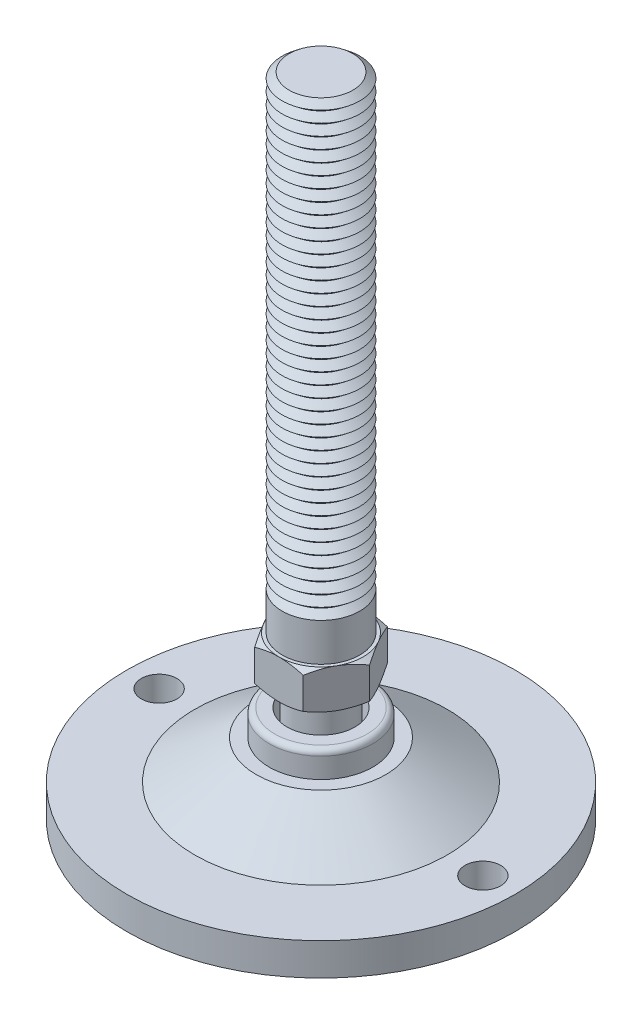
ISO-10303-21;
HEADER;
FILE_DESCRIPTION(('STEP AP214'),'2;1');
FILE_NAME('part.step','',(''),(''),'','','');
FILE_SCHEMA(('AUTOMOTIVE_DESIGN { 1 0 10303 214 1 1 1 1 }'));
ENDSEC;
DATA;
#1=APPLICATION_CONTEXT('core data for automotive mechanical design processes');
#2=APPLICATION_PROTOCOL_DEFINITION('international standard','automotive_design',2000,#1);
#3=PRODUCT_CONTEXT('',#1,'mechanical');
#4=PRODUCT('Part','Part','',(#3));
#5=PRODUCT_RELATED_PRODUCT_CATEGORY('part','',(#4));
#6=PRODUCT_DEFINITION_FORMATION('','',#4);
#7=PRODUCT_DEFINITION_CONTEXT('part definition',#1,'design');
#8=PRODUCT_DEFINITION('design','',#6,#7);
#9=PRODUCT_DEFINITION_SHAPE('','',#8);
#10=(LENGTH_UNIT() NAMED_UNIT(*) SI_UNIT(.MILLI.,.METRE.));
#11=(NAMED_UNIT(*) PLANE_ANGLE_UNIT() SI_UNIT($,.RADIAN.));
#12=(NAMED_UNIT(*) SI_UNIT($,.STERADIAN.) SOLID_ANGLE_UNIT());
#13=UNCERTAINTY_MEASURE_WITH_UNIT(LENGTH_MEASURE(1.E-05),#10,'distance_accuracy_value','');
#14=(GEOMETRIC_REPRESENTATION_CONTEXT(3) GLOBAL_UNCERTAINTY_ASSIGNED_CONTEXT((#13)) GLOBAL_UNIT_ASSIGNED_CONTEXT((#10,
#11,#12)) REPRESENTATION_CONTEXT('',''));
#15=CARTESIAN_POINT('',(0.,0.,0.));
#16=DIRECTION('',(0.,0.,1.));
#17=DIRECTION('',(1.,0.,0.));
#18=AXIS2_PLACEMENT_3D('',#15,#16,#17);
#19=CARTESIAN_POINT('',(0.,93.,0.));
#20=DIRECTION('',(0.,-1.,0.));
#21=DIRECTION('',(0.,0.,-1.));
#22=AXIS2_PLACEMENT_3D('',#19,#20,#21);
#23=CONICAL_SURFACE('',#22,4.90712535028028,0.895664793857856);
#24=CARTESIAN_POINT('',(0.,92.125,0.));
#25=DIRECTION('',(0.,-1.,0.));
#26=DIRECTION('',(0.,0.,-1.));
#27=AXIS2_PLACEMENT_3D('',#24,#25,#26);
#28=CIRCLE('',#27,6.);
#29=CARTESIAN_POINT('',(0.,92.125,-6.));
#30=VERTEX_POINT('',#29);
#31=EDGE_CURVE('P0_E1508',#30,#30,#28,.T.);
#32=ORIENTED_EDGE('',*,*,#31,.F.);
#33=EDGE_LOOP('',(#32));
#34=FACE_BOUND('',#33,.T.);
#35=CARTESIAN_POINT('',(0.,93.,0.));
#36=DIRECTION('',(0.,-1.,0.));
#37=DIRECTION('',(0.,0.,-1.));
#38=AXIS2_PLACEMENT_3D('',#35,#36,#37);
#39=CIRCLE('',#38,4.90712535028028);
#40=CARTESIAN_POINT('',(0.,93.,-4.90712535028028));
#41=VERTEX_POINT('',#40);
#42=EDGE_CURVE('P0_E1517',#41,#41,#39,.T.);
#43=ORIENTED_EDGE('',*,*,#42,.T.);
#44=EDGE_LOOP('',(#43));
#45=FACE_BOUND('',#44,.T.);
#46=ADVANCED_FACE('P0_F16',(#34,#45),#23,.T.);
#47=CARTESIAN_POINT('',(0.,93.875,0.));
#48=DIRECTION('',(0.,1.,0.));
#49=DIRECTION('',(0.,0.,1.));
#50=AXIS2_PLACEMENT_3D('',#47,#48,#49);
#51=CONICAL_SURFACE('',#50,6.,0.895664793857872);
#52=ORIENTED_EDGE('',*,*,#42,.F.);
#53=EDGE_LOOP('',(#52));
#54=FACE_BOUND('',#53,.T.);
#55=CARTESIAN_POINT('',(0.,93.875,0.));
#56=DIRECTION('',(0.,-1.,0.));
#57=DIRECTION('',(0.,0.,-1.));
#58=AXIS2_PLACEMENT_3D('',#55,#56,#57);
#59=CIRCLE('',#58,6.);
#60=CARTESIAN_POINT('',(0.,93.875,-6.));
#61=VERTEX_POINT('',#60);
#62=EDGE_CURVE('P0_E1514',#61,#61,#59,.T.);
#63=ORIENTED_EDGE('',*,*,#62,.T.);
#64=EDGE_LOOP('',(#63));
#65=FACE_BOUND('',#64,.T.);
#66=ADVANCED_FACE('P0_F308',(#54,#65),#51,.T.);
#67=CARTESIAN_POINT('',(0.,100.,0.));
#68=DIRECTION('',(0.,1.,0.));
#69=DIRECTION('',(0.,0.,1.));
#70=AXIS2_PLACEMENT_3D('',#67,#68,#69);
#71=PLANE('',#70);
#72=CARTESIAN_POINT('',(0.,100.,0.));
#73=DIRECTION('',(0.,-1.,0.));
#74=DIRECTION('',(0.,0.,-1.));
#75=AXIS2_PLACEMENT_3D('',#72,#73,#74);
#76=CIRCLE('',#75,4.90712535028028);
#77=CARTESIAN_POINT('',(0.,100.,-4.90712535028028));
#78=VERTEX_POINT('',#77);
#79=EDGE_CURVE('P0_E143',#78,#78,#76,.T.);
#80=ORIENTED_EDGE('',*,*,#79,.F.);
#81=EDGE_LOOP('',(#80));
#82=FACE_BOUND('',#81,.T.);
#83=ADVANCED_FACE('P0_F314',(#82),#71,.T.);
#84=CARTESIAN_POINT('',(0.,100.,0.));
#85=DIRECTION('',(0.,-1.,0.));
#86=DIRECTION('',(0.,0.,-1.));
#87=AXIS2_PLACEMENT_3D('',#84,#85,#86);
#88=CONICAL_SURFACE('',#87,4.90712535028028,0.895664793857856);
#89=CARTESIAN_POINT('',(0.,99.125,0.));
#90=DIRECTION('',(0.,-1.,0.));
#91=DIRECTION('',(0.,0.,-1.));
#92=AXIS2_PLACEMENT_3D('',#89,#90,#91);
#93=CIRCLE('',#92,6.);
#94=CARTESIAN_POINT('',(0.,99.125,-6.));
#95=VERTEX_POINT('',#94);
#96=EDGE_CURVE('P0_E353',#95,#95,#93,.T.);
#97=ORIENTED_EDGE('',*,*,#96,.F.);
#98=EDGE_LOOP('',(#97));
#99=FACE_BOUND('',#98,.T.);
#100=ORIENTED_EDGE('',*,*,#79,.T.);
#101=EDGE_LOOP('',(#100));
#102=FACE_BOUND('',#101,.T.);
#103=ADVANCED_FACE('P0_F211',(#99,#102),#88,.T.);
#104=CARTESIAN_POINT('',(0.,99.125,0.));
#105=DIRECTION('',(0.,1.,0.));
#106=DIRECTION('',(0.,0.,1.));
#107=AXIS2_PLACEMENT_3D('',#104,#105,#106);
#108=CONICAL_SURFACE('',#107,6.,0.895664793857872);
#109=CARTESIAN_POINT('',(0.,98.25,0.));
#110=DIRECTION('',(0.,-1.,0.));
#111=DIRECTION('',(0.,0.,-1.));
#112=AXIS2_PLACEMENT_3D('',#109,#110,#111);
#113=CIRCLE('',#112,4.90712535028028);
#114=CARTESIAN_POINT('',(0.,98.25,-4.90712535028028));
#115=VERTEX_POINT('',#114);
#116=EDGE_CURVE('P0_E352',#115,#115,#113,.T.);
#117=ORIENTED_EDGE('',*,*,#116,.F.);
#118=EDGE_LOOP('',(#117));
#119=FACE_BOUND('',#118,.T.);
#120=ORIENTED_EDGE('',*,*,#96,.T.);
#121=EDGE_LOOP('',(#120));
#122=FACE_BOUND('',#121,.T.);
#123=ADVANCED_FACE('P0_F339',(#119,#122),#108,.T.);
#124=CARTESIAN_POINT('',(0.,98.25,0.));
#125=DIRECTION('',(0.,-1.,0.));
#126=DIRECTION('',(0.,0.,-1.));
#127=AXIS2_PLACEMENT_3D('',#124,#125,#126);
#128=CONICAL_SURFACE('',#127,4.90712535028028,0.895664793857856);
#129=CARTESIAN_POINT('',(0.,97.375,0.));
#130=DIRECTION('',(0.,-1.,0.));
#131=DIRECTION('',(0.,0.,-1.));
#132=AXIS2_PLACEMENT_3D('',#129,#130,#131);
#133=CIRCLE('',#132,6.);
#134=CARTESIAN_POINT('',(0.,97.375,-6.));
#135=VERTEX_POINT('',#134);
#136=EDGE_CURVE('P0_E349',#135,#135,#133,.T.);
#137=ORIENTED_EDGE('',*,*,#136,.F.);
#138=EDGE_LOOP('',(#137));
#139=FACE_BOUND('',#138,.T.);
#140=ORIENTED_EDGE('',*,*,#116,.T.);
#141=EDGE_LOOP('',(#140));
#142=FACE_BOUND('',#141,.T.);
#143=ADVANCED_FACE('P0_F334',(#139,#142),#128,.T.);
#144=CARTESIAN_POINT('',(0.,97.375,0.));
#145=DIRECTION('',(0.,1.,0.));
#146=DIRECTION('',(0.,0.,1.));
#147=AXIS2_PLACEMENT_3D('',#144,#145,#146);
#148=CONICAL_SURFACE('',#147,6.,0.895664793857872);
#149=CARTESIAN_POINT('',(0.,96.5,0.));
#150=DIRECTION('',(0.,-1.,0.));
#151=DIRECTION('',(0.,0.,-1.));
#152=AXIS2_PLACEMENT_3D('',#149,#150,#151);
#153=CIRCLE('',#152,4.90712535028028);
#154=CARTESIAN_POINT('',(0.,96.5,-4.90712535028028));
#155=VERTEX_POINT('',#154);
#156=EDGE_CURVE('P0_E358',#155,#155,#153,.T.);
#157=ORIENTED_EDGE('',*,*,#156,.F.);
#158=EDGE_LOOP('',(#157));
#159=FACE_BOUND('',#158,.T.);
#160=ORIENTED_EDGE('',*,*,#136,.T.);
#161=EDGE_LOOP('',(#160));
#162=FACE_BOUND('',#161,.T.);
#163=ADVANCED_FACE('P0_F331',(#159,#162),#148,.T.);
#164=CARTESIAN_POINT('',(0.,96.5,0.));
#165=DIRECTION('',(0.,-1.,0.));
#166=DIRECTION('',(0.,0.,-1.));
#167=AXIS2_PLACEMENT_3D('',#164,#165,#166);
#168=CONICAL_SURFACE('',#167,4.90712535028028,0.895664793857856);
#169=CARTESIAN_POINT('',(0.,95.625,0.));
#170=DIRECTION('',(0.,-1.,0.));
#171=DIRECTION('',(0.,0.,-1.));
#172=AXIS2_PLACEMENT_3D('',#169,#170,#171);
#173=CIRCLE('',#172,6.);
#174=CARTESIAN_POINT('',(0.,95.625,-6.));
#175=VERTEX_POINT('',#174);
#176=EDGE_CURVE('P0_E1520',#175,#175,#173,.T.);
#177=ORIENTED_EDGE('',*,*,#176,.F.);
#178=EDGE_LOOP('',(#177));
#179=FACE_BOUND('',#178,.T.);
#180=ORIENTED_EDGE('',*,*,#156,.T.);
#181=EDGE_LOOP('',(#180));
#182=FACE_BOUND('',#181,.T.);
#183=ADVANCED_FACE('P0_F325',(#179,#182),#168,.T.);
#184=CARTESIAN_POINT('',(0.,95.625,0.));
#185=DIRECTION('',(0.,1.,0.));
#186=DIRECTION('',(0.,0.,1.));
#187=AXIS2_PLACEMENT_3D('',#184,#185,#186);
#188=CONICAL_SURFACE('',#187,6.,0.895664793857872);
#189=CARTESIAN_POINT('',(0.,94.75,0.));
#190=DIRECTION('',(0.,-1.,0.));
#191=DIRECTION('',(0.,0.,-1.));
#192=AXIS2_PLACEMENT_3D('',#189,#190,#191);
#193=CIRCLE('',#192,4.90712535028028);
#194=CARTESIAN_POINT('',(0.,94.75,-4.90712535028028));
#195=VERTEX_POINT('',#194);
#196=EDGE_CURVE('P0_E1523',#195,#195,#193,.T.);
#197=ORIENTED_EDGE('',*,*,#196,.F.);
#198=EDGE_LOOP('',(#197));
#199=FACE_BOUND('',#198,.T.);
#200=ORIENTED_EDGE('',*,*,#176,.T.);
#201=EDGE_LOOP('',(#200));
#202=FACE_BOUND('',#201,.T.);
#203=ADVANCED_FACE('P0_F321',(#199,#202),#188,.T.);
#204=CARTESIAN_POINT('',(0.,94.75,0.));
#205=DIRECTION('',(0.,-1.,0.));
#206=DIRECTION('',(0.,0.,-1.));
#207=AXIS2_PLACEMENT_3D('',#204,#205,#206);
#208=CONICAL_SURFACE('',#207,4.90712535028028,0.895664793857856);
#209=ORIENTED_EDGE('',*,*,#62,.F.);
#210=EDGE_LOOP('',(#209));
#211=FACE_BOUND('',#210,.T.);
#212=ORIENTED_EDGE('',*,*,#196,.T.);
#213=EDGE_LOOP('',(#212));
#214=FACE_BOUND('',#213,.T.);
#215=ADVANCED_FACE('P0_F324',(#211,#214),#208,.T.);
#216=CARTESIAN_POINT('',(0.,91.25,0.));
#217=DIRECTION('',(0.,-1.,0.));
#218=DIRECTION('',(0.,0.,-1.));
#219=AXIS2_PLACEMENT_3D('',#216,#217,#218);
#220=CONICAL_SURFACE('',#219,4.90712535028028,0.895664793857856);
#221=CARTESIAN_POINT('',(0.,90.375,0.));
#222=DIRECTION('',(0.,-1.,0.));
#223=DIRECTION('',(0.,0.,-1.));
#224=AXIS2_PLACEMENT_3D('',#221,#222,#223);
#225=CIRCLE('',#224,6.);
#226=CARTESIAN_POINT('',(0.,90.375,-6.));
#227=VERTEX_POINT('',#226);
#228=EDGE_CURVE('P0_E1502',#227,#227,#225,.T.);
#229=ORIENTED_EDGE('',*,*,#228,.F.);
#230=EDGE_LOOP('',(#229));
#231=FACE_BOUND('',#230,.T.);
#232=CARTESIAN_POINT('',(0.,91.25,0.));
#233=DIRECTION('',(0.,-1.,0.));
#234=DIRECTION('',(0.,0.,-1.));
#235=AXIS2_PLACEMENT_3D('',#232,#233,#234);
#236=CIRCLE('',#235,4.90712535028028);
#237=CARTESIAN_POINT('',(0.,91.25,-4.90712535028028));
#238=VERTEX_POINT('',#237);
#239=EDGE_CURVE('P0_E1511',#238,#238,#236,.T.);
#240=ORIENTED_EDGE('',*,*,#239,.T.);
#241=EDGE_LOOP('',(#240));
#242=FACE_BOUND('',#241,.T.);
#243=ADVANCED_FACE('P0_F329',(#231,#242),#220,.T.);
#244=CARTESIAN_POINT('',(0.,92.125,0.));
#245=DIRECTION('',(0.,1.,0.));
#246=DIRECTION('',(0.,0.,1.));
#247=AXIS2_PLACEMENT_3D('',#244,#245,#246);
#248=CONICAL_SURFACE('',#247,6.,0.895664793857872);
#249=ORIENTED_EDGE('',*,*,#239,.F.);
#250=EDGE_LOOP('',(#249));
#251=FACE_BOUND('',#250,.T.);
#252=ORIENTED_EDGE('',*,*,#31,.T.);
#253=EDGE_LOOP('',(#252));
#254=FACE_BOUND('',#253,.T.);
#255=ADVANCED_FACE('P0_F1204',(#251,#254),#248,.T.);
#256=CARTESIAN_POINT('',(0.,89.5,0.));
#257=DIRECTION('',(0.,-1.,0.));
#258=DIRECTION('',(0.,0.,-1.));
#259=AXIS2_PLACEMENT_3D('',#256,#257,#258);
#260=CONICAL_SURFACE('',#259,4.90712535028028,0.895664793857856);
#261=CARTESIAN_POINT('',(0.,88.625,0.));
#262=DIRECTION('',(0.,-1.,0.));
#263=DIRECTION('',(0.,0.,-1.));
#264=AXIS2_PLACEMENT_3D('',#261,#262,#263);
#265=CIRCLE('',#264,6.);
#266=CARTESIAN_POINT('',(0.,88.625,-6.));
#267=VERTEX_POINT('',#266);
#268=EDGE_CURVE('P0_E1496',#267,#267,#265,.T.);
#269=ORIENTED_EDGE('',*,*,#268,.F.);
#270=EDGE_LOOP('',(#269));
#271=FACE_BOUND('',#270,.T.);
#272=CARTESIAN_POINT('',(0.,89.5,0.));
#273=DIRECTION('',(0.,-1.,0.));
#274=DIRECTION('',(0.,0.,-1.));
#275=AXIS2_PLACEMENT_3D('',#272,#273,#274);
#276=CIRCLE('',#275,4.90712535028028);
#277=CARTESIAN_POINT('',(0.,89.5,-4.90712535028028));
#278=VERTEX_POINT('',#277);
#279=EDGE_CURVE('P0_E1505',#278,#278,#276,.T.);
#280=ORIENTED_EDGE('',*,*,#279,.T.);
#281=EDGE_LOOP('',(#280));
#282=FACE_BOUND('',#281,.T.);
#283=ADVANCED_FACE('P0_F1194',(#271,#282),#260,.T.);
#284=CARTESIAN_POINT('',(0.,90.375,0.));
#285=DIRECTION('',(0.,1.,0.));
#286=DIRECTION('',(0.,0.,1.));
#287=AXIS2_PLACEMENT_3D('',#284,#285,#286);
#288=CONICAL_SURFACE('',#287,6.,0.895664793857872);
#289=ORIENTED_EDGE('',*,*,#279,.F.);
#290=EDGE_LOOP('',(#289));
#291=FACE_BOUND('',#290,.T.);
#292=ORIENTED_EDGE('',*,*,#228,.T.);
#293=EDGE_LOOP('',(#292));
#294=FACE_BOUND('',#293,.T.);
#295=ADVANCED_FACE('P0_F1184',(#291,#294),#288,.T.);
#296=CARTESIAN_POINT('',(0.,87.75,0.));
#297=DIRECTION('',(0.,-1.,0.));
#298=DIRECTION('',(0.,0.,-1.));
#299=AXIS2_PLACEMENT_3D('',#296,#297,#298);
#300=CONICAL_SURFACE('',#299,4.90712535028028,0.895664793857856);
#301=CARTESIAN_POINT('',(0.,86.875,0.));
#302=DIRECTION('',(0.,-1.,0.));
#303=DIRECTION('',(0.,0.,-1.));
#304=AXIS2_PLACEMENT_3D('',#301,#302,#303);
#305=CIRCLE('',#304,6.);
#306=CARTESIAN_POINT('',(0.,86.875,-6.));
#307=VERTEX_POINT('',#306);
#308=EDGE_CURVE('P0_E1490',#307,#307,#305,.T.);
#309=ORIENTED_EDGE('',*,*,#308,.F.);
#310=EDGE_LOOP('',(#309));
#311=FACE_BOUND('',#310,.T.);
#312=CARTESIAN_POINT('',(0.,87.75,0.));
#313=DIRECTION('',(0.,-1.,0.));
#314=DIRECTION('',(0.,0.,-1.));
#315=AXIS2_PLACEMENT_3D('',#312,#313,#314);
#316=CIRCLE('',#315,4.90712535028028);
#317=CARTESIAN_POINT('',(0.,87.75,-4.90712535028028));
#318=VERTEX_POINT('',#317);
#319=EDGE_CURVE('P0_E1499',#318,#318,#316,.T.);
#320=ORIENTED_EDGE('',*,*,#319,.T.);
#321=EDGE_LOOP('',(#320));
#322=FACE_BOUND('',#321,.T.);
#323=ADVANCED_FACE('P0_F1174',(#311,#322),#300,.T.);
#324=CARTESIAN_POINT('',(0.,88.625,0.));
#325=DIRECTION('',(0.,1.,0.));
#326=DIRECTION('',(0.,0.,1.));
#327=AXIS2_PLACEMENT_3D('',#324,#325,#326);
#328=CONICAL_SURFACE('',#327,6.,0.895664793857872);
#329=ORIENTED_EDGE('',*,*,#319,.F.);
#330=EDGE_LOOP('',(#329));
#331=FACE_BOUND('',#330,.T.);
#332=ORIENTED_EDGE('',*,*,#268,.T.);
#333=EDGE_LOOP('',(#332));
#334=FACE_BOUND('',#333,.T.);
#335=ADVANCED_FACE('P0_F1164',(#331,#334),#328,.T.);
#336=CARTESIAN_POINT('',(0.,86.,0.));
#337=DIRECTION('',(0.,-1.,0.));
#338=DIRECTION('',(0.,0.,-1.));
#339=AXIS2_PLACEMENT_3D('',#336,#337,#338);
#340=CONICAL_SURFACE('',#339,4.90712535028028,0.895664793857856);
#341=CARTESIAN_POINT('',(0.,85.125,0.));
#342=DIRECTION('',(0.,-1.,0.));
#343=DIRECTION('',(0.,0.,-1.));
#344=AXIS2_PLACEMENT_3D('',#341,#342,#343);
#345=CIRCLE('',#344,6.);
#346=CARTESIAN_POINT('',(0.,85.125,-6.));
#347=VERTEX_POINT('',#346);
#348=EDGE_CURVE('P0_E1484',#347,#347,#345,.T.);
#349=ORIENTED_EDGE('',*,*,#348,.F.);
#350=EDGE_LOOP('',(#349));
#351=FACE_BOUND('',#350,.T.);
#352=CARTESIAN_POINT('',(0.,86.,0.));
#353=DIRECTION('',(0.,-1.,0.));
#354=DIRECTION('',(0.,0.,-1.));
#355=AXIS2_PLACEMENT_3D('',#352,#353,#354);
#356=CIRCLE('',#355,4.90712535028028);
#357=CARTESIAN_POINT('',(0.,86.,-4.90712535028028));
#358=VERTEX_POINT('',#357);
#359=EDGE_CURVE('P0_E1493',#358,#358,#356,.T.);
#360=ORIENTED_EDGE('',*,*,#359,.T.);
#361=EDGE_LOOP('',(#360));
#362=FACE_BOUND('',#361,.T.);
#363=ADVANCED_FACE('P0_F1154',(#351,#362),#340,.T.);
#364=CARTESIAN_POINT('',(0.,86.875,0.));
#365=DIRECTION('',(0.,1.,0.));
#366=DIRECTION('',(0.,0.,1.));
#367=AXIS2_PLACEMENT_3D('',#364,#365,#366);
#368=CONICAL_SURFACE('',#367,6.,0.895664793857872);
#369=ORIENTED_EDGE('',*,*,#359,.F.);
#370=EDGE_LOOP('',(#369));
#371=FACE_BOUND('',#370,.T.);
#372=ORIENTED_EDGE('',*,*,#308,.T.);
#373=EDGE_LOOP('',(#372));
#374=FACE_BOUND('',#373,.T.);
#375=ADVANCED_FACE('P0_F1144',(#371,#374),#368,.T.);
#376=CARTESIAN_POINT('',(0.,84.25,0.));
#377=DIRECTION('',(0.,-1.,0.));
#378=DIRECTION('',(0.,0.,-1.));
#379=AXIS2_PLACEMENT_3D('',#376,#377,#378);
#380=CONICAL_SURFACE('',#379,4.90712535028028,0.895664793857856);
#381=CARTESIAN_POINT('',(0.,83.375,0.));
#382=DIRECTION('',(0.,-1.,0.));
#383=DIRECTION('',(0.,0.,-1.));
#384=AXIS2_PLACEMENT_3D('',#381,#382,#383);
#385=CIRCLE('',#384,6.);
#386=CARTESIAN_POINT('',(0.,83.375,-6.));
#387=VERTEX_POINT('',#386);
#388=EDGE_CURVE('P0_E1478',#387,#387,#385,.T.);
#389=ORIENTED_EDGE('',*,*,#388,.F.);
#390=EDGE_LOOP('',(#389));
#391=FACE_BOUND('',#390,.T.);
#392=CARTESIAN_POINT('',(0.,84.25,0.));
#393=DIRECTION('',(0.,-1.,0.));
#394=DIRECTION('',(0.,0.,-1.));
#395=AXIS2_PLACEMENT_3D('',#392,#393,#394);
#396=CIRCLE('',#395,4.90712535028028);
#397=CARTESIAN_POINT('',(0.,84.25,-4.90712535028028));
#398=VERTEX_POINT('',#397);
#399=EDGE_CURVE('P0_E1487',#398,#398,#396,.T.);
#400=ORIENTED_EDGE('',*,*,#399,.T.);
#401=EDGE_LOOP('',(#400));
#402=FACE_BOUND('',#401,.T.);
#403=ADVANCED_FACE('P0_F1134',(#391,#402),#380,.T.);
#404=CARTESIAN_POINT('',(0.,85.125,0.));
#405=DIRECTION('',(0.,1.,0.));
#406=DIRECTION('',(0.,0.,1.));
#407=AXIS2_PLACEMENT_3D('',#404,#405,#406);
#408=CONICAL_SURFACE('',#407,6.,0.895664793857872);
#409=ORIENTED_EDGE('',*,*,#399,.F.);
#410=EDGE_LOOP('',(#409));
#411=FACE_BOUND('',#410,.T.);
#412=ORIENTED_EDGE('',*,*,#348,.T.);
#413=EDGE_LOOP('',(#412));
#414=FACE_BOUND('',#413,.T.);
#415=ADVANCED_FACE('P0_F1124',(#411,#414),#408,.T.);
#416=CARTESIAN_POINT('',(0.,82.5,0.));
#417=DIRECTION('',(0.,-1.,0.));
#418=DIRECTION('',(0.,0.,-1.));
#419=AXIS2_PLACEMENT_3D('',#416,#417,#418);
#420=CONICAL_SURFACE('',#419,4.90712535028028,0.895664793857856);
#421=CARTESIAN_POINT('',(0.,81.625,0.));
#422=DIRECTION('',(0.,-1.,0.));
#423=DIRECTION('',(0.,0.,-1.));
#424=AXIS2_PLACEMENT_3D('',#421,#422,#423);
#425=CIRCLE('',#424,6.);
#426=CARTESIAN_POINT('',(0.,81.625,-6.));
#427=VERTEX_POINT('',#426);
#428=EDGE_CURVE('P0_E1472',#427,#427,#425,.T.);
#429=ORIENTED_EDGE('',*,*,#428,.F.);
#430=EDGE_LOOP('',(#429));
#431=FACE_BOUND('',#430,.T.);
#432=CARTESIAN_POINT('',(0.,82.5,0.));
#433=DIRECTION('',(0.,-1.,0.));
#434=DIRECTION('',(0.,0.,-1.));
#435=AXIS2_PLACEMENT_3D('',#432,#433,#434);
#436=CIRCLE('',#435,4.90712535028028);
#437=CARTESIAN_POINT('',(0.,82.5,-4.90712535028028));
#438=VERTEX_POINT('',#437);
#439=EDGE_CURVE('P0_E1481',#438,#438,#436,.T.);
#440=ORIENTED_EDGE('',*,*,#439,.T.);
#441=EDGE_LOOP('',(#440));
#442=FACE_BOUND('',#441,.T.);
#443=ADVANCED_FACE('P0_F1114',(#431,#442),#420,.T.);
#444=CARTESIAN_POINT('',(0.,83.375,0.));
#445=DIRECTION('',(0.,1.,0.));
#446=DIRECTION('',(0.,0.,1.));
#447=AXIS2_PLACEMENT_3D('',#444,#445,#446);
#448=CONICAL_SURFACE('',#447,6.,0.895664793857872);
#449=ORIENTED_EDGE('',*,*,#439,.F.);
#450=EDGE_LOOP('',(#449));
#451=FACE_BOUND('',#450,.T.);
#452=ORIENTED_EDGE('',*,*,#388,.T.);
#453=EDGE_LOOP('',(#452));
#454=FACE_BOUND('',#453,.T.);
#455=ADVANCED_FACE('P0_F1104',(#451,#454),#448,.T.);
#456=CARTESIAN_POINT('',(0.,80.75,0.));
#457=DIRECTION('',(0.,-1.,0.));
#458=DIRECTION('',(0.,0.,-1.));
#459=AXIS2_PLACEMENT_3D('',#456,#457,#458);
#460=CONICAL_SURFACE('',#459,4.90712535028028,0.895664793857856);
#461=CARTESIAN_POINT('',(0.,79.875,0.));
#462=DIRECTION('',(0.,-1.,0.));
#463=DIRECTION('',(0.,0.,-1.));
#464=AXIS2_PLACEMENT_3D('',#461,#462,#463);
#465=CIRCLE('',#464,6.);
#466=CARTESIAN_POINT('',(0.,79.875,-6.));
#467=VERTEX_POINT('',#466);
#468=EDGE_CURVE('P0_E1466',#467,#467,#465,.T.);
#469=ORIENTED_EDGE('',*,*,#468,.F.);
#470=EDGE_LOOP('',(#469));
#471=FACE_BOUND('',#470,.T.);
#472=CARTESIAN_POINT('',(0.,80.75,0.));
#473=DIRECTION('',(0.,-1.,0.));
#474=DIRECTION('',(0.,0.,-1.));
#475=AXIS2_PLACEMENT_3D('',#472,#473,#474);
#476=CIRCLE('',#475,4.90712535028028);
#477=CARTESIAN_POINT('',(0.,80.75,-4.90712535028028));
#478=VERTEX_POINT('',#477);
#479=EDGE_CURVE('P0_E1475',#478,#478,#476,.T.);
#480=ORIENTED_EDGE('',*,*,#479,.T.);
#481=EDGE_LOOP('',(#480));
#482=FACE_BOUND('',#481,.T.);
#483=ADVANCED_FACE('P0_F1094',(#471,#482),#460,.T.);
#484=CARTESIAN_POINT('',(0.,81.625,0.));
#485=DIRECTION('',(0.,1.,0.));
#486=DIRECTION('',(0.,0.,1.));
#487=AXIS2_PLACEMENT_3D('',#484,#485,#486);
#488=CONICAL_SURFACE('',#487,6.,0.895664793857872);
#489=ORIENTED_EDGE('',*,*,#479,.F.);
#490=EDGE_LOOP('',(#489));
#491=FACE_BOUND('',#490,.T.);
#492=ORIENTED_EDGE('',*,*,#428,.T.);
#493=EDGE_LOOP('',(#492));
#494=FACE_BOUND('',#493,.T.);
#495=ADVANCED_FACE('P0_F1084',(#491,#494),#488,.T.);
#496=CARTESIAN_POINT('',(0.,79.,0.));
#497=DIRECTION('',(0.,-1.,0.));
#498=DIRECTION('',(0.,0.,-1.));
#499=AXIS2_PLACEMENT_3D('',#496,#497,#498);
#500=CONICAL_SURFACE('',#499,4.90712535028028,0.895664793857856);
#501=CARTESIAN_POINT('',(0.,78.125,0.));
#502=DIRECTION('',(0.,-1.,0.));
#503=DIRECTION('',(0.,0.,-1.));
#504=AXIS2_PLACEMENT_3D('',#501,#502,#503);
#505=CIRCLE('',#504,6.);
#506=CARTESIAN_POINT('',(0.,78.125,-6.));
#507=VERTEX_POINT('',#506);
#508=EDGE_CURVE('P0_E1460',#507,#507,#505,.T.);
#509=ORIENTED_EDGE('',*,*,#508,.F.);
#510=EDGE_LOOP('',(#509));
#511=FACE_BOUND('',#510,.T.);
#512=CARTESIAN_POINT('',(0.,79.,0.));
#513=DIRECTION('',(0.,-1.,0.));
#514=DIRECTION('',(0.,0.,-1.));
#515=AXIS2_PLACEMENT_3D('',#512,#513,#514);
#516=CIRCLE('',#515,4.90712535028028);
#517=CARTESIAN_POINT('',(0.,79.,-4.90712535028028));
#518=VERTEX_POINT('',#517);
#519=EDGE_CURVE('P0_E1469',#518,#518,#516,.T.);
#520=ORIENTED_EDGE('',*,*,#519,.T.);
#521=EDGE_LOOP('',(#520));
#522=FACE_BOUND('',#521,.T.);
#523=ADVANCED_FACE('P0_F1074',(#511,#522),#500,.T.);
#524=CARTESIAN_POINT('',(0.,79.875,0.));
#525=DIRECTION('',(0.,1.,0.));
#526=DIRECTION('',(0.,0.,1.));
#527=AXIS2_PLACEMENT_3D('',#524,#525,#526);
#528=CONICAL_SURFACE('',#527,6.,0.895664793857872);
#529=ORIENTED_EDGE('',*,*,#519,.F.);
#530=EDGE_LOOP('',(#529));
#531=FACE_BOUND('',#530,.T.);
#532=ORIENTED_EDGE('',*,*,#468,.T.);
#533=EDGE_LOOP('',(#532));
#534=FACE_BOUND('',#533,.T.);
#535=ADVANCED_FACE('P0_F1064',(#531,#534),#528,.T.);
#536=CARTESIAN_POINT('',(0.,77.25,0.));
#537=DIRECTION('',(0.,-1.,0.));
#538=DIRECTION('',(0.,0.,-1.));
#539=AXIS2_PLACEMENT_3D('',#536,#537,#538);
#540=CONICAL_SURFACE('',#539,4.90712535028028,0.895664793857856);
#541=CARTESIAN_POINT('',(0.,76.375,0.));
#542=DIRECTION('',(0.,-1.,0.));
#543=DIRECTION('',(0.,0.,-1.));
#544=AXIS2_PLACEMENT_3D('',#541,#542,#543);
#545=CIRCLE('',#544,6.);
#546=CARTESIAN_POINT('',(0.,76.375,-6.));
#547=VERTEX_POINT('',#546);
#548=EDGE_CURVE('P0_E1454',#547,#547,#545,.T.);
#549=ORIENTED_EDGE('',*,*,#548,.F.);
#550=EDGE_LOOP('',(#549));
#551=FACE_BOUND('',#550,.T.);
#552=CARTESIAN_POINT('',(0.,77.25,0.));
#553=DIRECTION('',(0.,-1.,0.));
#554=DIRECTION('',(0.,0.,-1.));
#555=AXIS2_PLACEMENT_3D('',#552,#553,#554);
#556=CIRCLE('',#555,4.90712535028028);
#557=CARTESIAN_POINT('',(0.,77.25,-4.90712535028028));
#558=VERTEX_POINT('',#557);
#559=EDGE_CURVE('P0_E1463',#558,#558,#556,.T.);
#560=ORIENTED_EDGE('',*,*,#559,.T.);
#561=EDGE_LOOP('',(#560));
#562=FACE_BOUND('',#561,.T.);
#563=ADVANCED_FACE('P0_F1054',(#551,#562),#540,.T.);
#564=CARTESIAN_POINT('',(0.,78.125,0.));
#565=DIRECTION('',(0.,1.,0.));
#566=DIRECTION('',(0.,0.,1.));
#567=AXIS2_PLACEMENT_3D('',#564,#565,#566);
#568=CONICAL_SURFACE('',#567,6.,0.895664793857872);
#569=ORIENTED_EDGE('',*,*,#559,.F.);
#570=EDGE_LOOP('',(#569));
#571=FACE_BOUND('',#570,.T.);
#572=ORIENTED_EDGE('',*,*,#508,.T.);
#573=EDGE_LOOP('',(#572));
#574=FACE_BOUND('',#573,.T.);
#575=ADVANCED_FACE('P0_F1044',(#571,#574),#568,.T.);
#576=CARTESIAN_POINT('',(0.,75.5,0.));
#577=DIRECTION('',(0.,-1.,0.));
#578=DIRECTION('',(0.,0.,-1.));
#579=AXIS2_PLACEMENT_3D('',#576,#577,#578);
#580=CONICAL_SURFACE('',#579,4.90712535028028,0.895664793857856);
#581=CARTESIAN_POINT('',(0.,74.625,0.));
#582=DIRECTION('',(0.,-1.,0.));
#583=DIRECTION('',(0.,0.,-1.));
#584=AXIS2_PLACEMENT_3D('',#581,#582,#583);
#585=CIRCLE('',#584,6.);
#586=CARTESIAN_POINT('',(0.,74.625,-6.));
#587=VERTEX_POINT('',#586);
#588=EDGE_CURVE('P0_E1448',#587,#587,#585,.T.);
#589=ORIENTED_EDGE('',*,*,#588,.F.);
#590=EDGE_LOOP('',(#589));
#591=FACE_BOUND('',#590,.T.);
#592=CARTESIAN_POINT('',(0.,75.5,0.));
#593=DIRECTION('',(0.,-1.,0.));
#594=DIRECTION('',(0.,0.,-1.));
#595=AXIS2_PLACEMENT_3D('',#592,#593,#594);
#596=CIRCLE('',#595,4.90712535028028);
#597=CARTESIAN_POINT('',(0.,75.5,-4.90712535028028));
#598=VERTEX_POINT('',#597);
#599=EDGE_CURVE('P0_E1457',#598,#598,#596,.T.);
#600=ORIENTED_EDGE('',*,*,#599,.T.);
#601=EDGE_LOOP('',(#600));
#602=FACE_BOUND('',#601,.T.);
#603=ADVANCED_FACE('P0_F1034',(#591,#602),#580,.T.);
#604=CARTESIAN_POINT('',(0.,76.375,0.));
#605=DIRECTION('',(0.,1.,0.));
#606=DIRECTION('',(0.,0.,1.));
#607=AXIS2_PLACEMENT_3D('',#604,#605,#606);
#608=CONICAL_SURFACE('',#607,6.,0.895664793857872);
#609=ORIENTED_EDGE('',*,*,#599,.F.);
#610=EDGE_LOOP('',(#609));
#611=FACE_BOUND('',#610,.T.);
#612=ORIENTED_EDGE('',*,*,#548,.T.);
#613=EDGE_LOOP('',(#612));
#614=FACE_BOUND('',#613,.T.);
#615=ADVANCED_FACE('P0_F1024',(#611,#614),#608,.T.);
#616=CARTESIAN_POINT('',(0.,73.75,0.));
#617=DIRECTION('',(0.,-1.,0.));
#618=DIRECTION('',(0.,0.,-1.));
#619=AXIS2_PLACEMENT_3D('',#616,#617,#618);
#620=CONICAL_SURFACE('',#619,4.90712535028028,0.895664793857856);
#621=CARTESIAN_POINT('',(0.,72.875,0.));
#622=DIRECTION('',(0.,-1.,0.));
#623=DIRECTION('',(0.,0.,-1.));
#624=AXIS2_PLACEMENT_3D('',#621,#622,#623);
#625=CIRCLE('',#624,6.);
#626=CARTESIAN_POINT('',(0.,72.875,-6.));
#627=VERTEX_POINT('',#626);
#628=EDGE_CURVE('P0_E1442',#627,#627,#625,.T.);
#629=ORIENTED_EDGE('',*,*,#628,.F.);
#630=EDGE_LOOP('',(#629));
#631=FACE_BOUND('',#630,.T.);
#632=CARTESIAN_POINT('',(0.,73.75,0.));
#633=DIRECTION('',(0.,-1.,0.));
#634=DIRECTION('',(0.,0.,-1.));
#635=AXIS2_PLACEMENT_3D('',#632,#633,#634);
#636=CIRCLE('',#635,4.90712535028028);
#637=CARTESIAN_POINT('',(0.,73.75,-4.90712535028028));
#638=VERTEX_POINT('',#637);
#639=EDGE_CURVE('P0_E1451',#638,#638,#636,.T.);
#640=ORIENTED_EDGE('',*,*,#639,.T.);
#641=EDGE_LOOP('',(#640));
#642=FACE_BOUND('',#641,.T.);
#643=ADVANCED_FACE('P0_F1014',(#631,#642),#620,.T.);
#644=CARTESIAN_POINT('',(0.,74.625,0.));
#645=DIRECTION('',(0.,1.,0.));
#646=DIRECTION('',(0.,0.,1.));
#647=AXIS2_PLACEMENT_3D('',#644,#645,#646);
#648=CONICAL_SURFACE('',#647,6.,0.895664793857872);
#649=ORIENTED_EDGE('',*,*,#639,.F.);
#650=EDGE_LOOP('',(#649));
#651=FACE_BOUND('',#650,.T.);
#652=ORIENTED_EDGE('',*,*,#588,.T.);
#653=EDGE_LOOP('',(#652));
#654=FACE_BOUND('',#653,.T.);
#655=ADVANCED_FACE('P0_F1004',(#651,#654),#648,.T.);
#656=CARTESIAN_POINT('',(0.,72.,0.));
#657=DIRECTION('',(0.,-1.,0.));
#658=DIRECTION('',(0.,0.,-1.));
#659=AXIS2_PLACEMENT_3D('',#656,#657,#658);
#660=CONICAL_SURFACE('',#659,4.90712535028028,0.895664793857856);
#661=CARTESIAN_POINT('',(0.,71.125,0.));
#662=DIRECTION('',(0.,-1.,0.));
#663=DIRECTION('',(0.,0.,-1.));
#664=AXIS2_PLACEMENT_3D('',#661,#662,#663);
#665=CIRCLE('',#664,6.);
#666=CARTESIAN_POINT('',(0.,71.125,-6.));
#667=VERTEX_POINT('',#666);
#668=EDGE_CURVE('P0_E1436',#667,#667,#665,.T.);
#669=ORIENTED_EDGE('',*,*,#668,.F.);
#670=EDGE_LOOP('',(#669));
#671=FACE_BOUND('',#670,.T.);
#672=CARTESIAN_POINT('',(0.,72.,0.));
#673=DIRECTION('',(0.,-1.,0.));
#674=DIRECTION('',(0.,0.,-1.));
#675=AXIS2_PLACEMENT_3D('',#672,#673,#674);
#676=CIRCLE('',#675,4.90712535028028);
#677=CARTESIAN_POINT('',(0.,72.,-4.90712535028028));
#678=VERTEX_POINT('',#677);
#679=EDGE_CURVE('P0_E1445',#678,#678,#676,.T.);
#680=ORIENTED_EDGE('',*,*,#679,.T.);
#681=EDGE_LOOP('',(#680));
#682=FACE_BOUND('',#681,.T.);
#683=ADVANCED_FACE('P0_F994',(#671,#682),#660,.T.);
#684=CARTESIAN_POINT('',(0.,72.875,0.));
#685=DIRECTION('',(0.,1.,0.));
#686=DIRECTION('',(0.,0.,1.));
#687=AXIS2_PLACEMENT_3D('',#684,#685,#686);
#688=CONICAL_SURFACE('',#687,6.,0.895664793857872);
#689=ORIENTED_EDGE('',*,*,#679,.F.);
#690=EDGE_LOOP('',(#689));
#691=FACE_BOUND('',#690,.T.);
#692=ORIENTED_EDGE('',*,*,#628,.T.);
#693=EDGE_LOOP('',(#692));
#694=FACE_BOUND('',#693,.T.);
#695=ADVANCED_FACE('P0_F984',(#691,#694),#688,.T.);
#696=CARTESIAN_POINT('',(0.,70.25,0.));
#697=DIRECTION('',(0.,-1.,0.));
#698=DIRECTION('',(0.,0.,-1.));
#699=AXIS2_PLACEMENT_3D('',#696,#697,#698);
#700=CONICAL_SURFACE('',#699,4.90712535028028,0.895664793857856);
#701=CARTESIAN_POINT('',(0.,69.375,0.));
#702=DIRECTION('',(0.,-1.,0.));
#703=DIRECTION('',(0.,0.,-1.));
#704=AXIS2_PLACEMENT_3D('',#701,#702,#703);
#705=CIRCLE('',#704,6.);
#706=CARTESIAN_POINT('',(0.,69.375,-6.));
#707=VERTEX_POINT('',#706);
#708=EDGE_CURVE('P0_E1430',#707,#707,#705,.T.);
#709=ORIENTED_EDGE('',*,*,#708,.F.);
#710=EDGE_LOOP('',(#709));
#711=FACE_BOUND('',#710,.T.);
#712=CARTESIAN_POINT('',(0.,70.25,0.));
#713=DIRECTION('',(0.,-1.,0.));
#714=DIRECTION('',(0.,0.,-1.));
#715=AXIS2_PLACEMENT_3D('',#712,#713,#714);
#716=CIRCLE('',#715,4.90712535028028);
#717=CARTESIAN_POINT('',(0.,70.25,-4.90712535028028));
#718=VERTEX_POINT('',#717);
#719=EDGE_CURVE('P0_E1439',#718,#718,#716,.T.);
#720=ORIENTED_EDGE('',*,*,#719,.T.);
#721=EDGE_LOOP('',(#720));
#722=FACE_BOUND('',#721,.T.);
#723=ADVANCED_FACE('P0_F974',(#711,#722),#700,.T.);
#724=CARTESIAN_POINT('',(0.,71.125,0.));
#725=DIRECTION('',(0.,1.,0.));
#726=DIRECTION('',(0.,0.,1.));
#727=AXIS2_PLACEMENT_3D('',#724,#725,#726);
#728=CONICAL_SURFACE('',#727,6.,0.895664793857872);
#729=ORIENTED_EDGE('',*,*,#719,.F.);
#730=EDGE_LOOP('',(#729));
#731=FACE_BOUND('',#730,.T.);
#732=ORIENTED_EDGE('',*,*,#668,.T.);
#733=EDGE_LOOP('',(#732));
#734=FACE_BOUND('',#733,.T.);
#735=ADVANCED_FACE('P0_F964',(#731,#734),#728,.T.);
#736=CARTESIAN_POINT('',(0.,68.5,0.));
#737=DIRECTION('',(0.,-1.,0.));
#738=DIRECTION('',(0.,0.,-1.));
#739=AXIS2_PLACEMENT_3D('',#736,#737,#738);
#740=CONICAL_SURFACE('',#739,4.90712535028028,0.895664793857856);
#741=CARTESIAN_POINT('',(0.,67.625,0.));
#742=DIRECTION('',(0.,-1.,0.));
#743=DIRECTION('',(0.,0.,-1.));
#744=AXIS2_PLACEMENT_3D('',#741,#742,#743);
#745=CIRCLE('',#744,6.);
#746=CARTESIAN_POINT('',(0.,67.625,-6.));
#747=VERTEX_POINT('',#746);
#748=EDGE_CURVE('P0_E1424',#747,#747,#745,.T.);
#749=ORIENTED_EDGE('',*,*,#748,.F.);
#750=EDGE_LOOP('',(#749));
#751=FACE_BOUND('',#750,.T.);
#752=CARTESIAN_POINT('',(0.,68.5,0.));
#753=DIRECTION('',(0.,-1.,0.));
#754=DIRECTION('',(0.,0.,-1.));
#755=AXIS2_PLACEMENT_3D('',#752,#753,#754);
#756=CIRCLE('',#755,4.90712535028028);
#757=CARTESIAN_POINT('',(0.,68.5,-4.90712535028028));
#758=VERTEX_POINT('',#757);
#759=EDGE_CURVE('P0_E1433',#758,#758,#756,.T.);
#760=ORIENTED_EDGE('',*,*,#759,.T.);
#761=EDGE_LOOP('',(#760));
#762=FACE_BOUND('',#761,.T.);
#763=ADVANCED_FACE('P0_F954',(#751,#762),#740,.T.);
#764=CARTESIAN_POINT('',(0.,69.375,0.));
#765=DIRECTION('',(0.,1.,0.));
#766=DIRECTION('',(0.,0.,1.));
#767=AXIS2_PLACEMENT_3D('',#764,#765,#766);
#768=CONICAL_SURFACE('',#767,6.,0.895664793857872);
#769=ORIENTED_EDGE('',*,*,#759,.F.);
#770=EDGE_LOOP('',(#769));
#771=FACE_BOUND('',#770,.T.);
#772=ORIENTED_EDGE('',*,*,#708,.T.);
#773=EDGE_LOOP('',(#772));
#774=FACE_BOUND('',#773,.T.);
#775=ADVANCED_FACE('P0_F944',(#771,#774),#768,.T.);
#776=CARTESIAN_POINT('',(0.,66.75,0.));
#777=DIRECTION('',(0.,-1.,0.));
#778=DIRECTION('',(0.,0.,-1.));
#779=AXIS2_PLACEMENT_3D('',#776,#777,#778);
#780=CONICAL_SURFACE('',#779,4.90712535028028,0.895664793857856);
#781=CARTESIAN_POINT('',(0.,65.875,0.));
#782=DIRECTION('',(0.,-1.,0.));
#783=DIRECTION('',(0.,0.,-1.));
#784=AXIS2_PLACEMENT_3D('',#781,#782,#783);
#785=CIRCLE('',#784,6.);
#786=CARTESIAN_POINT('',(0.,65.875,-6.));
#787=VERTEX_POINT('',#786);
#788=EDGE_CURVE('P0_E1418',#787,#787,#785,.T.);
#789=ORIENTED_EDGE('',*,*,#788,.F.);
#790=EDGE_LOOP('',(#789));
#791=FACE_BOUND('',#790,.T.);
#792=CARTESIAN_POINT('',(0.,66.75,0.));
#793=DIRECTION('',(0.,-1.,0.));
#794=DIRECTION('',(0.,0.,-1.));
#795=AXIS2_PLACEMENT_3D('',#792,#793,#794);
#796=CIRCLE('',#795,4.90712535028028);
#797=CARTESIAN_POINT('',(0.,66.75,-4.90712535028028));
#798=VERTEX_POINT('',#797);
#799=EDGE_CURVE('P0_E1427',#798,#798,#796,.T.);
#800=ORIENTED_EDGE('',*,*,#799,.T.);
#801=EDGE_LOOP('',(#800));
#802=FACE_BOUND('',#801,.T.);
#803=ADVANCED_FACE('P0_F934',(#791,#802),#780,.T.);
#804=CARTESIAN_POINT('',(0.,67.625,0.));
#805=DIRECTION('',(0.,1.,0.));
#806=DIRECTION('',(0.,0.,1.));
#807=AXIS2_PLACEMENT_3D('',#804,#805,#806);
#808=CONICAL_SURFACE('',#807,6.,0.895664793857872);
#809=ORIENTED_EDGE('',*,*,#799,.F.);
#810=EDGE_LOOP('',(#809));
#811=FACE_BOUND('',#810,.T.);
#812=ORIENTED_EDGE('',*,*,#748,.T.);
#813=EDGE_LOOP('',(#812));
#814=FACE_BOUND('',#813,.T.);
#815=ADVANCED_FACE('P0_F924',(#811,#814),#808,.T.);
#816=CARTESIAN_POINT('',(0.,65.,0.));
#817=DIRECTION('',(0.,-1.,0.));
#818=DIRECTION('',(0.,0.,-1.));
#819=AXIS2_PLACEMENT_3D('',#816,#817,#818);
#820=CONICAL_SURFACE('',#819,4.90712535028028,0.895664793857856);
#821=CARTESIAN_POINT('',(0.,64.125,0.));
#822=DIRECTION('',(0.,-1.,0.));
#823=DIRECTION('',(0.,0.,-1.));
#824=AXIS2_PLACEMENT_3D('',#821,#822,#823);
#825=CIRCLE('',#824,6.);
#826=CARTESIAN_POINT('',(0.,64.125,-6.));
#827=VERTEX_POINT('',#826);
#828=EDGE_CURVE('P0_E1412',#827,#827,#825,.T.);
#829=ORIENTED_EDGE('',*,*,#828,.F.);
#830=EDGE_LOOP('',(#829));
#831=FACE_BOUND('',#830,.T.);
#832=CARTESIAN_POINT('',(0.,65.,0.));
#833=DIRECTION('',(0.,-1.,0.));
#834=DIRECTION('',(0.,0.,-1.));
#835=AXIS2_PLACEMENT_3D('',#832,#833,#834);
#836=CIRCLE('',#835,4.90712535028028);
#837=CARTESIAN_POINT('',(0.,65.,-4.90712535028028));
#838=VERTEX_POINT('',#837);
#839=EDGE_CURVE('P0_E1421',#838,#838,#836,.T.);
#840=ORIENTED_EDGE('',*,*,#839,.T.);
#841=EDGE_LOOP('',(#840));
#842=FACE_BOUND('',#841,.T.);
#843=ADVANCED_FACE('P0_F914',(#831,#842),#820,.T.);
#844=CARTESIAN_POINT('',(0.,65.875,0.));
#845=DIRECTION('',(0.,1.,0.));
#846=DIRECTION('',(0.,0.,1.));
#847=AXIS2_PLACEMENT_3D('',#844,#845,#846);
#848=CONICAL_SURFACE('',#847,6.,0.895664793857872);
#849=ORIENTED_EDGE('',*,*,#839,.F.);
#850=EDGE_LOOP('',(#849));
#851=FACE_BOUND('',#850,.T.);
#852=ORIENTED_EDGE('',*,*,#788,.T.);
#853=EDGE_LOOP('',(#852));
#854=FACE_BOUND('',#853,.T.);
#855=ADVANCED_FACE('P0_F904',(#851,#854),#848,.T.);
#856=CARTESIAN_POINT('',(0.,63.25,0.));
#857=DIRECTION('',(0.,-1.,0.));
#858=DIRECTION('',(0.,0.,-1.));
#859=AXIS2_PLACEMENT_3D('',#856,#857,#858);
#860=CONICAL_SURFACE('',#859,4.90712535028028,0.895664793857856);
#861=CARTESIAN_POINT('',(0.,62.375,0.));
#862=DIRECTION('',(0.,-1.,0.));
#863=DIRECTION('',(0.,0.,-1.));
#864=AXIS2_PLACEMENT_3D('',#861,#862,#863);
#865=CIRCLE('',#864,6.);
#866=CARTESIAN_POINT('',(0.,62.375,-6.));
#867=VERTEX_POINT('',#866);
#868=EDGE_CURVE('P0_E1406',#867,#867,#865,.T.);
#869=ORIENTED_EDGE('',*,*,#868,.F.);
#870=EDGE_LOOP('',(#869));
#871=FACE_BOUND('',#870,.T.);
#872=CARTESIAN_POINT('',(0.,63.25,0.));
#873=DIRECTION('',(0.,-1.,0.));
#874=DIRECTION('',(0.,0.,-1.));
#875=AXIS2_PLACEMENT_3D('',#872,#873,#874);
#876=CIRCLE('',#875,4.90712535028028);
#877=CARTESIAN_POINT('',(0.,63.25,-4.90712535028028));
#878=VERTEX_POINT('',#877);
#879=EDGE_CURVE('P0_E1415',#878,#878,#876,.T.);
#880=ORIENTED_EDGE('',*,*,#879,.T.);
#881=EDGE_LOOP('',(#880));
#882=FACE_BOUND('',#881,.T.);
#883=ADVANCED_FACE('P0_F894',(#871,#882),#860,.T.);
#884=CARTESIAN_POINT('',(0.,64.125,0.));
#885=DIRECTION('',(0.,1.,0.));
#886=DIRECTION('',(0.,0.,1.));
#887=AXIS2_PLACEMENT_3D('',#884,#885,#886);
#888=CONICAL_SURFACE('',#887,6.,0.895664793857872);
#889=ORIENTED_EDGE('',*,*,#879,.F.);
#890=EDGE_LOOP('',(#889));
#891=FACE_BOUND('',#890,.T.);
#892=ORIENTED_EDGE('',*,*,#828,.T.);
#893=EDGE_LOOP('',(#892));
#894=FACE_BOUND('',#893,.T.);
#895=ADVANCED_FACE('P0_F884',(#891,#894),#888,.T.);
#896=CARTESIAN_POINT('',(0.,61.5,0.));
#897=DIRECTION('',(0.,-1.,0.));
#898=DIRECTION('',(0.,0.,-1.));
#899=AXIS2_PLACEMENT_3D('',#896,#897,#898);
#900=CONICAL_SURFACE('',#899,4.90712535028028,0.895664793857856);
#901=CARTESIAN_POINT('',(0.,60.625,0.));
#902=DIRECTION('',(0.,-1.,0.));
#903=DIRECTION('',(0.,0.,-1.));
#904=AXIS2_PLACEMENT_3D('',#901,#902,#903);
#905=CIRCLE('',#904,6.);
#906=CARTESIAN_POINT('',(0.,60.625,-6.));
#907=VERTEX_POINT('',#906);
#908=EDGE_CURVE('P0_E1400',#907,#907,#905,.T.);
#909=ORIENTED_EDGE('',*,*,#908,.F.);
#910=EDGE_LOOP('',(#909));
#911=FACE_BOUND('',#910,.T.);
#912=CARTESIAN_POINT('',(0.,61.5,0.));
#913=DIRECTION('',(0.,-1.,0.));
#914=DIRECTION('',(0.,0.,-1.));
#915=AXIS2_PLACEMENT_3D('',#912,#913,#914);
#916=CIRCLE('',#915,4.90712535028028);
#917=CARTESIAN_POINT('',(0.,61.5,-4.90712535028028));
#918=VERTEX_POINT('',#917);
#919=EDGE_CURVE('P0_E1409',#918,#918,#916,.T.);
#920=ORIENTED_EDGE('',*,*,#919,.T.);
#921=EDGE_LOOP('',(#920));
#922=FACE_BOUND('',#921,.T.);
#923=ADVANCED_FACE('P0_F874',(#911,#922),#900,.T.);
#924=CARTESIAN_POINT('',(0.,62.375,0.));
#925=DIRECTION('',(0.,1.,0.));
#926=DIRECTION('',(0.,0.,1.));
#927=AXIS2_PLACEMENT_3D('',#924,#925,#926);
#928=CONICAL_SURFACE('',#927,6.,0.895664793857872);
#929=ORIENTED_EDGE('',*,*,#919,.F.);
#930=EDGE_LOOP('',(#929));
#931=FACE_BOUND('',#930,.T.);
#932=ORIENTED_EDGE('',*,*,#868,.T.);
#933=EDGE_LOOP('',(#932));
#934=FACE_BOUND('',#933,.T.);
#935=ADVANCED_FACE('P0_F864',(#931,#934),#928,.T.);
#936=CARTESIAN_POINT('',(0.,59.75,0.));
#937=DIRECTION('',(0.,-1.,0.));
#938=DIRECTION('',(0.,0.,-1.));
#939=AXIS2_PLACEMENT_3D('',#936,#937,#938);
#940=CONICAL_SURFACE('',#939,4.90712535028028,0.895664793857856);
#941=CARTESIAN_POINT('',(0.,58.875,0.));
#942=DIRECTION('',(0.,-1.,0.));
#943=DIRECTION('',(0.,0.,-1.));
#944=AXIS2_PLACEMENT_3D('',#941,#942,#943);
#945=CIRCLE('',#944,6.);
#946=CARTESIAN_POINT('',(0.,58.875,-6.));
#947=VERTEX_POINT('',#946);
#948=EDGE_CURVE('P0_E1394',#947,#947,#945,.T.);
#949=ORIENTED_EDGE('',*,*,#948,.F.);
#950=EDGE_LOOP('',(#949));
#951=FACE_BOUND('',#950,.T.);
#952=CARTESIAN_POINT('',(0.,59.75,0.));
#953=DIRECTION('',(0.,-1.,0.));
#954=DIRECTION('',(0.,0.,-1.));
#955=AXIS2_PLACEMENT_3D('',#952,#953,#954);
#956=CIRCLE('',#955,4.90712535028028);
#957=CARTESIAN_POINT('',(0.,59.75,-4.90712535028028));
#958=VERTEX_POINT('',#957);
#959=EDGE_CURVE('P0_E1403',#958,#958,#956,.T.);
#960=ORIENTED_EDGE('',*,*,#959,.T.);
#961=EDGE_LOOP('',(#960));
#962=FACE_BOUND('',#961,.T.);
#963=ADVANCED_FACE('P0_F854',(#951,#962),#940,.T.);
#964=CARTESIAN_POINT('',(0.,60.625,0.));
#965=DIRECTION('',(0.,1.,0.));
#966=DIRECTION('',(0.,0.,1.));
#967=AXIS2_PLACEMENT_3D('',#964,#965,#966);
#968=CONICAL_SURFACE('',#967,6.,0.895664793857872);
#969=ORIENTED_EDGE('',*,*,#959,.F.);
#970=EDGE_LOOP('',(#969));
#971=FACE_BOUND('',#970,.T.);
#972=ORIENTED_EDGE('',*,*,#908,.T.);
#973=EDGE_LOOP('',(#972));
#974=FACE_BOUND('',#973,.T.);
#975=ADVANCED_FACE('P0_F844',(#971,#974),#968,.T.);
#976=CARTESIAN_POINT('',(0.,58.,0.));
#977=DIRECTION('',(0.,-1.,0.));
#978=DIRECTION('',(0.,0.,-1.));
#979=AXIS2_PLACEMENT_3D('',#976,#977,#978);
#980=CONICAL_SURFACE('',#979,4.90712535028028,0.895664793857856);
#981=CARTESIAN_POINT('',(0.,57.125,0.));
#982=DIRECTION('',(0.,-1.,0.));
#983=DIRECTION('',(0.,0.,-1.));
#984=AXIS2_PLACEMENT_3D('',#981,#982,#983);
#985=CIRCLE('',#984,6.);
#986=CARTESIAN_POINT('',(0.,57.125,-6.));
#987=VERTEX_POINT('',#986);
#988=EDGE_CURVE('P0_E1388',#987,#987,#985,.T.);
#989=ORIENTED_EDGE('',*,*,#988,.F.);
#990=EDGE_LOOP('',(#989));
#991=FACE_BOUND('',#990,.T.);
#992=CARTESIAN_POINT('',(0.,58.,0.));
#993=DIRECTION('',(0.,-1.,0.));
#994=DIRECTION('',(0.,0.,-1.));
#995=AXIS2_PLACEMENT_3D('',#992,#993,#994);
#996=CIRCLE('',#995,4.90712535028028);
#997=CARTESIAN_POINT('',(0.,58.,-4.90712535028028));
#998=VERTEX_POINT('',#997);
#999=EDGE_CURVE('P0_E1397',#998,#998,#996,.T.);
#1000=ORIENTED_EDGE('',*,*,#999,.T.);
#1001=EDGE_LOOP('',(#1000));
#1002=FACE_BOUND('',#1001,.T.);
#1003=ADVANCED_FACE('P0_F834',(#991,#1002),#980,.T.);
#1004=CARTESIAN_POINT('',(0.,58.875,0.));
#1005=DIRECTION('',(0.,1.,0.));
#1006=DIRECTION('',(0.,0.,1.));
#1007=AXIS2_PLACEMENT_3D('',#1004,#1005,#1006);
#1008=CONICAL_SURFACE('',#1007,6.,0.895664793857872);
#1009=ORIENTED_EDGE('',*,*,#999,.F.);
#1010=EDGE_LOOP('',(#1009));
#1011=FACE_BOUND('',#1010,.T.);
#1012=ORIENTED_EDGE('',*,*,#948,.T.);
#1013=EDGE_LOOP('',(#1012));
#1014=FACE_BOUND('',#1013,.T.);
#1015=ADVANCED_FACE('P0_F824',(#1011,#1014),#1008,.T.);
#1016=CARTESIAN_POINT('',(0.,56.25,0.));
#1017=DIRECTION('',(0.,-1.,0.));
#1018=DIRECTION('',(0.,0.,-1.));
#1019=AXIS2_PLACEMENT_3D('',#1016,#1017,#1018);
#1020=CONICAL_SURFACE('',#1019,4.90712535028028,0.895664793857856);
#1021=CARTESIAN_POINT('',(0.,55.375,0.));
#1022=DIRECTION('',(0.,-1.,0.));
#1023=DIRECTION('',(0.,0.,-1.));
#1024=AXIS2_PLACEMENT_3D('',#1021,#1022,#1023);
#1025=CIRCLE('',#1024,6.);
#1026=CARTESIAN_POINT('',(0.,55.375,-6.));
#1027=VERTEX_POINT('',#1026);
#1028=EDGE_CURVE('P0_E1382',#1027,#1027,#1025,.T.);
#1029=ORIENTED_EDGE('',*,*,#1028,.F.);
#1030=EDGE_LOOP('',(#1029));
#1031=FACE_BOUND('',#1030,.T.);
#1032=CARTESIAN_POINT('',(0.,56.25,0.));
#1033=DIRECTION('',(0.,-1.,0.));
#1034=DIRECTION('',(0.,0.,-1.));
#1035=AXIS2_PLACEMENT_3D('',#1032,#1033,#1034);
#1036=CIRCLE('',#1035,4.90712535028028);
#1037=CARTESIAN_POINT('',(0.,56.25,-4.90712535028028));
#1038=VERTEX_POINT('',#1037);
#1039=EDGE_CURVE('P0_E1391',#1038,#1038,#1036,.T.);
#1040=ORIENTED_EDGE('',*,*,#1039,.T.);
#1041=EDGE_LOOP('',(#1040));
#1042=FACE_BOUND('',#1041,.T.);
#1043=ADVANCED_FACE('P0_F814',(#1031,#1042),#1020,.T.);
#1044=CARTESIAN_POINT('',(0.,57.125,0.));
#1045=DIRECTION('',(0.,1.,0.));
#1046=DIRECTION('',(0.,0.,1.));
#1047=AXIS2_PLACEMENT_3D('',#1044,#1045,#1046);
#1048=CONICAL_SURFACE('',#1047,6.,0.895664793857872);
#1049=ORIENTED_EDGE('',*,*,#1039,.F.);
#1050=EDGE_LOOP('',(#1049));
#1051=FACE_BOUND('',#1050,.T.);
#1052=ORIENTED_EDGE('',*,*,#988,.T.);
#1053=EDGE_LOOP('',(#1052));
#1054=FACE_BOUND('',#1053,.T.);
#1055=ADVANCED_FACE('P0_F804',(#1051,#1054),#1048,.T.);
#1056=CARTESIAN_POINT('',(0.,54.5,0.));
#1057=DIRECTION('',(0.,-1.,0.));
#1058=DIRECTION('',(0.,0.,-1.));
#1059=AXIS2_PLACEMENT_3D('',#1056,#1057,#1058);
#1060=CONICAL_SURFACE('',#1059,4.90712535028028,0.895664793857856);
#1061=CARTESIAN_POINT('',(0.,53.625,0.));
#1062=DIRECTION('',(0.,-1.,0.));
#1063=DIRECTION('',(0.,0.,-1.));
#1064=AXIS2_PLACEMENT_3D('',#1061,#1062,#1063);
#1065=CIRCLE('',#1064,6.);
#1066=CARTESIAN_POINT('',(0.,53.625,-6.));
#1067=VERTEX_POINT('',#1066);
#1068=EDGE_CURVE('P0_E1376',#1067,#1067,#1065,.T.);
#1069=ORIENTED_EDGE('',*,*,#1068,.F.);
#1070=EDGE_LOOP('',(#1069));
#1071=FACE_BOUND('',#1070,.T.);
#1072=CARTESIAN_POINT('',(0.,54.5,0.));
#1073=DIRECTION('',(0.,-1.,0.));
#1074=DIRECTION('',(0.,0.,-1.));
#1075=AXIS2_PLACEMENT_3D('',#1072,#1073,#1074);
#1076=CIRCLE('',#1075,4.90712535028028);
#1077=CARTESIAN_POINT('',(0.,54.5,-4.90712535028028));
#1078=VERTEX_POINT('',#1077);
#1079=EDGE_CURVE('P0_E1385',#1078,#1078,#1076,.T.);
#1080=ORIENTED_EDGE('',*,*,#1079,.T.);
#1081=EDGE_LOOP('',(#1080));
#1082=FACE_BOUND('',#1081,.T.);
#1083=ADVANCED_FACE('P0_F794',(#1071,#1082),#1060,.T.);
#1084=CARTESIAN_POINT('',(0.,55.375,0.));
#1085=DIRECTION('',(0.,1.,0.));
#1086=DIRECTION('',(0.,0.,1.));
#1087=AXIS2_PLACEMENT_3D('',#1084,#1085,#1086);
#1088=CONICAL_SURFACE('',#1087,6.,0.895664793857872);
#1089=ORIENTED_EDGE('',*,*,#1079,.F.);
#1090=EDGE_LOOP('',(#1089));
#1091=FACE_BOUND('',#1090,.T.);
#1092=ORIENTED_EDGE('',*,*,#1028,.T.);
#1093=EDGE_LOOP('',(#1092));
#1094=FACE_BOUND('',#1093,.T.);
#1095=ADVANCED_FACE('P0_F784',(#1091,#1094),#1088,.T.);
#1096=CARTESIAN_POINT('',(0.,52.75,0.));
#1097=DIRECTION('',(0.,-1.,0.));
#1098=DIRECTION('',(0.,0.,-1.));
#1099=AXIS2_PLACEMENT_3D('',#1096,#1097,#1098);
#1100=CONICAL_SURFACE('',#1099,4.90712535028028,0.895664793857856);
#1101=CARTESIAN_POINT('',(0.,51.875,0.));
#1102=DIRECTION('',(0.,-1.,0.));
#1103=DIRECTION('',(0.,0.,-1.));
#1104=AXIS2_PLACEMENT_3D('',#1101,#1102,#1103);
#1105=CIRCLE('',#1104,6.);
#1106=CARTESIAN_POINT('',(0.,51.875,-6.));
#1107=VERTEX_POINT('',#1106);
#1108=EDGE_CURVE('P0_E1370',#1107,#1107,#1105,.T.);
#1109=ORIENTED_EDGE('',*,*,#1108,.F.);
#1110=EDGE_LOOP('',(#1109));
#1111=FACE_BOUND('',#1110,.T.);
#1112=CARTESIAN_POINT('',(0.,52.75,0.));
#1113=DIRECTION('',(0.,-1.,0.));
#1114=DIRECTION('',(0.,0.,-1.));
#1115=AXIS2_PLACEMENT_3D('',#1112,#1113,#1114);
#1116=CIRCLE('',#1115,4.90712535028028);
#1117=CARTESIAN_POINT('',(0.,52.75,-4.90712535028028));
#1118=VERTEX_POINT('',#1117);
#1119=EDGE_CURVE('P0_E1379',#1118,#1118,#1116,.T.);
#1120=ORIENTED_EDGE('',*,*,#1119,.T.);
#1121=EDGE_LOOP('',(#1120));
#1122=FACE_BOUND('',#1121,.T.);
#1123=ADVANCED_FACE('P0_F774',(#1111,#1122),#1100,.T.);
#1124=CARTESIAN_POINT('',(0.,53.625,0.));
#1125=DIRECTION('',(0.,1.,0.));
#1126=DIRECTION('',(0.,0.,1.));
#1127=AXIS2_PLACEMENT_3D('',#1124,#1125,#1126);
#1128=CONICAL_SURFACE('',#1127,6.,0.895664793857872);
#1129=ORIENTED_EDGE('',*,*,#1119,.F.);
#1130=EDGE_LOOP('',(#1129));
#1131=FACE_BOUND('',#1130,.T.);
#1132=ORIENTED_EDGE('',*,*,#1068,.T.);
#1133=EDGE_LOOP('',(#1132));
#1134=FACE_BOUND('',#1133,.T.);
#1135=ADVANCED_FACE('P0_F764',(#1131,#1134),#1128,.T.);
#1136=CARTESIAN_POINT('',(0.,51.,0.));
#1137=DIRECTION('',(0.,-1.,0.));
#1138=DIRECTION('',(0.,0.,-1.));
#1139=AXIS2_PLACEMENT_3D('',#1136,#1137,#1138);
#1140=CONICAL_SURFACE('',#1139,4.90712535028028,0.895664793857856);
#1141=CARTESIAN_POINT('',(0.,50.125,0.));
#1142=DIRECTION('',(0.,-1.,0.));
#1143=DIRECTION('',(0.,0.,-1.));
#1144=AXIS2_PLACEMENT_3D('',#1141,#1142,#1143);
#1145=CIRCLE('',#1144,6.);
#1146=CARTESIAN_POINT('',(0.,50.125,-6.));
#1147=VERTEX_POINT('',#1146);
#1148=EDGE_CURVE('P0_E1364',#1147,#1147,#1145,.T.);
#1149=ORIENTED_EDGE('',*,*,#1148,.F.);
#1150=EDGE_LOOP('',(#1149));
#1151=FACE_BOUND('',#1150,.T.);
#1152=CARTESIAN_POINT('',(0.,51.,0.));
#1153=DIRECTION('',(0.,-1.,0.));
#1154=DIRECTION('',(0.,0.,-1.));
#1155=AXIS2_PLACEMENT_3D('',#1152,#1153,#1154);
#1156=CIRCLE('',#1155,4.90712535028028);
#1157=CARTESIAN_POINT('',(0.,51.,-4.90712535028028));
#1158=VERTEX_POINT('',#1157);
#1159=EDGE_CURVE('P0_E1373',#1158,#1158,#1156,.T.);
#1160=ORIENTED_EDGE('',*,*,#1159,.T.);
#1161=EDGE_LOOP('',(#1160));
#1162=FACE_BOUND('',#1161,.T.);
#1163=ADVANCED_FACE('P0_F754',(#1151,#1162),#1140,.T.);
#1164=CARTESIAN_POINT('',(0.,51.875,0.));
#1165=DIRECTION('',(0.,1.,0.));
#1166=DIRECTION('',(0.,0.,1.));
#1167=AXIS2_PLACEMENT_3D('',#1164,#1165,#1166);
#1168=CONICAL_SURFACE('',#1167,6.,0.895664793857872);
#1169=ORIENTED_EDGE('',*,*,#1159,.F.);
#1170=EDGE_LOOP('',(#1169));
#1171=FACE_BOUND('',#1170,.T.);
#1172=ORIENTED_EDGE('',*,*,#1108,.T.);
#1173=EDGE_LOOP('',(#1172));
#1174=FACE_BOUND('',#1173,.T.);
#1175=ADVANCED_FACE('P0_F744',(#1171,#1174),#1168,.T.);
#1176=CARTESIAN_POINT('',(0.,49.25,0.));
#1177=DIRECTION('',(0.,-1.,0.));
#1178=DIRECTION('',(0.,0.,-1.));
#1179=AXIS2_PLACEMENT_3D('',#1176,#1177,#1178);
#1180=CONICAL_SURFACE('',#1179,4.90712535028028,0.895664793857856);
#1181=CARTESIAN_POINT('',(0.,48.375,0.));
#1182=DIRECTION('',(0.,-1.,0.));
#1183=DIRECTION('',(0.,0.,-1.));
#1184=AXIS2_PLACEMENT_3D('',#1181,#1182,#1183);
#1185=CIRCLE('',#1184,6.);
#1186=CARTESIAN_POINT('',(0.,48.375,-6.));
#1187=VERTEX_POINT('',#1186);
#1188=EDGE_CURVE('P0_E1358',#1187,#1187,#1185,.T.);
#1189=ORIENTED_EDGE('',*,*,#1188,.F.);
#1190=EDGE_LOOP('',(#1189));
#1191=FACE_BOUND('',#1190,.T.);
#1192=CARTESIAN_POINT('',(0.,49.25,0.));
#1193=DIRECTION('',(0.,-1.,0.));
#1194=DIRECTION('',(0.,0.,-1.));
#1195=AXIS2_PLACEMENT_3D('',#1192,#1193,#1194);
#1196=CIRCLE('',#1195,4.90712535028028);
#1197=CARTESIAN_POINT('',(0.,49.25,-4.90712535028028));
#1198=VERTEX_POINT('',#1197);
#1199=EDGE_CURVE('P0_E1367',#1198,#1198,#1196,.T.);
#1200=ORIENTED_EDGE('',*,*,#1199,.T.);
#1201=EDGE_LOOP('',(#1200));
#1202=FACE_BOUND('',#1201,.T.);
#1203=ADVANCED_FACE('P0_F734',(#1191,#1202),#1180,.T.);
#1204=CARTESIAN_POINT('',(0.,50.125,0.));
#1205=DIRECTION('',(0.,1.,0.));
#1206=DIRECTION('',(0.,0.,1.));
#1207=AXIS2_PLACEMENT_3D('',#1204,#1205,#1206);
#1208=CONICAL_SURFACE('',#1207,6.,0.895664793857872);
#1209=ORIENTED_EDGE('',*,*,#1199,.F.);
#1210=EDGE_LOOP('',(#1209));
#1211=FACE_BOUND('',#1210,.T.);
#1212=ORIENTED_EDGE('',*,*,#1148,.T.);
#1213=EDGE_LOOP('',(#1212));
#1214=FACE_BOUND('',#1213,.T.);
#1215=ADVANCED_FACE('P0_F724',(#1211,#1214),#1208,.T.);
#1216=CARTESIAN_POINT('',(0.,47.5,0.));
#1217=DIRECTION('',(0.,-1.,0.));
#1218=DIRECTION('',(0.,0.,-1.));
#1219=AXIS2_PLACEMENT_3D('',#1216,#1217,#1218);
#1220=CONICAL_SURFACE('',#1219,4.90712535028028,0.895664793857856);
#1221=CARTESIAN_POINT('',(0.,46.625,0.));
#1222=DIRECTION('',(0.,-1.,0.));
#1223=DIRECTION('',(0.,0.,-1.));
#1224=AXIS2_PLACEMENT_3D('',#1221,#1222,#1223);
#1225=CIRCLE('',#1224,6.);
#1226=CARTESIAN_POINT('',(0.,46.625,-6.));
#1227=VERTEX_POINT('',#1226);
#1228=EDGE_CURVE('P0_E1352',#1227,#1227,#1225,.T.);
#1229=ORIENTED_EDGE('',*,*,#1228,.F.);
#1230=EDGE_LOOP('',(#1229));
#1231=FACE_BOUND('',#1230,.T.);
#1232=CARTESIAN_POINT('',(0.,47.5,0.));
#1233=DIRECTION('',(0.,-1.,0.));
#1234=DIRECTION('',(0.,0.,-1.));
#1235=AXIS2_PLACEMENT_3D('',#1232,#1233,#1234);
#1236=CIRCLE('',#1235,4.90712535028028);
#1237=CARTESIAN_POINT('',(0.,47.5,-4.90712535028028));
#1238=VERTEX_POINT('',#1237);
#1239=EDGE_CURVE('P0_E1361',#1238,#1238,#1236,.T.);
#1240=ORIENTED_EDGE('',*,*,#1239,.T.);
#1241=EDGE_LOOP('',(#1240));
#1242=FACE_BOUND('',#1241,.T.);
#1243=ADVANCED_FACE('P0_F714',(#1231,#1242),#1220,.T.);
#1244=CARTESIAN_POINT('',(0.,48.375,0.));
#1245=DIRECTION('',(0.,1.,0.));
#1246=DIRECTION('',(0.,0.,1.));
#1247=AXIS2_PLACEMENT_3D('',#1244,#1245,#1246);
#1248=CONICAL_SURFACE('',#1247,6.,0.895664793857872);
#1249=ORIENTED_EDGE('',*,*,#1239,.F.);
#1250=EDGE_LOOP('',(#1249));
#1251=FACE_BOUND('',#1250,.T.);
#1252=ORIENTED_EDGE('',*,*,#1188,.T.);
#1253=EDGE_LOOP('',(#1252));
#1254=FACE_BOUND('',#1253,.T.);
#1255=ADVANCED_FACE('P0_F704',(#1251,#1254),#1248,.T.);
#1256=CARTESIAN_POINT('',(0.,45.75,0.));
#1257=DIRECTION('',(0.,-1.,0.));
#1258=DIRECTION('',(0.,0.,-1.));
#1259=AXIS2_PLACEMENT_3D('',#1256,#1257,#1258);
#1260=CONICAL_SURFACE('',#1259,4.90712535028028,0.895664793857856);
#1261=CARTESIAN_POINT('',(0.,44.875,0.));
#1262=DIRECTION('',(0.,-1.,0.));
#1263=DIRECTION('',(0.,0.,-1.));
#1264=AXIS2_PLACEMENT_3D('',#1261,#1262,#1263);
#1265=CIRCLE('',#1264,6.);
#1266=CARTESIAN_POINT('',(0.,44.875,-6.));
#1267=VERTEX_POINT('',#1266);
#1268=EDGE_CURVE('P0_E1346',#1267,#1267,#1265,.T.);
#1269=ORIENTED_EDGE('',*,*,#1268,.F.);
#1270=EDGE_LOOP('',(#1269));
#1271=FACE_BOUND('',#1270,.T.);
#1272=CARTESIAN_POINT('',(0.,45.75,0.));
#1273=DIRECTION('',(0.,-1.,0.));
#1274=DIRECTION('',(0.,0.,-1.));
#1275=AXIS2_PLACEMENT_3D('',#1272,#1273,#1274);
#1276=CIRCLE('',#1275,4.90712535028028);
#1277=CARTESIAN_POINT('',(0.,45.75,-4.90712535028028));
#1278=VERTEX_POINT('',#1277);
#1279=EDGE_CURVE('P0_E1355',#1278,#1278,#1276,.T.);
#1280=ORIENTED_EDGE('',*,*,#1279,.T.);
#1281=EDGE_LOOP('',(#1280));
#1282=FACE_BOUND('',#1281,.T.);
#1283=ADVANCED_FACE('P0_F694',(#1271,#1282),#1260,.T.);
#1284=CARTESIAN_POINT('',(0.,46.625,0.));
#1285=DIRECTION('',(0.,1.,0.));
#1286=DIRECTION('',(0.,0.,1.));
#1287=AXIS2_PLACEMENT_3D('',#1284,#1285,#1286);
#1288=CONICAL_SURFACE('',#1287,6.,0.895664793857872);
#1289=ORIENTED_EDGE('',*,*,#1279,.F.);
#1290=EDGE_LOOP('',(#1289));
#1291=FACE_BOUND('',#1290,.T.);
#1292=ORIENTED_EDGE('',*,*,#1228,.T.);
#1293=EDGE_LOOP('',(#1292));
#1294=FACE_BOUND('',#1293,.T.);
#1295=ADVANCED_FACE('P0_F684',(#1291,#1294),#1288,.T.);
#1296=CARTESIAN_POINT('',(0.,44.,0.));
#1297=DIRECTION('',(0.,-1.,0.));
#1298=DIRECTION('',(0.,0.,-1.));
#1299=AXIS2_PLACEMENT_3D('',#1296,#1297,#1298);
#1300=CONICAL_SURFACE('',#1299,4.90712535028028,0.895664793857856);
#1301=CARTESIAN_POINT('',(0.,43.125,0.));
#1302=DIRECTION('',(0.,-1.,0.));
#1303=DIRECTION('',(0.,0.,-1.));
#1304=AXIS2_PLACEMENT_3D('',#1301,#1302,#1303);
#1305=CIRCLE('',#1304,6.);
#1306=CARTESIAN_POINT('',(0.,43.125,-6.));
#1307=VERTEX_POINT('',#1306);
#1308=EDGE_CURVE('P0_E1340',#1307,#1307,#1305,.T.);
#1309=ORIENTED_EDGE('',*,*,#1308,.F.);
#1310=EDGE_LOOP('',(#1309));
#1311=FACE_BOUND('',#1310,.T.);
#1312=CARTESIAN_POINT('',(0.,44.,0.));
#1313=DIRECTION('',(0.,-1.,0.));
#1314=DIRECTION('',(0.,0.,-1.));
#1315=AXIS2_PLACEMENT_3D('',#1312,#1313,#1314);
#1316=CIRCLE('',#1315,4.90712535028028);
#1317=CARTESIAN_POINT('',(0.,44.,-4.90712535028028));
#1318=VERTEX_POINT('',#1317);
#1319=EDGE_CURVE('P0_E1349',#1318,#1318,#1316,.T.);
#1320=ORIENTED_EDGE('',*,*,#1319,.T.);
#1321=EDGE_LOOP('',(#1320));
#1322=FACE_BOUND('',#1321,.T.);
#1323=ADVANCED_FACE('P0_F674',(#1311,#1322),#1300,.T.);
#1324=CARTESIAN_POINT('',(0.,44.875,0.));
#1325=DIRECTION('',(0.,1.,0.));
#1326=DIRECTION('',(0.,0.,1.));
#1327=AXIS2_PLACEMENT_3D('',#1324,#1325,#1326);
#1328=CONICAL_SURFACE('',#1327,6.,0.895664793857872);
#1329=ORIENTED_EDGE('',*,*,#1319,.F.);
#1330=EDGE_LOOP('',(#1329));
#1331=FACE_BOUND('',#1330,.T.);
#1332=ORIENTED_EDGE('',*,*,#1268,.T.);
#1333=EDGE_LOOP('',(#1332));
#1334=FACE_BOUND('',#1333,.T.);
#1335=ADVANCED_FACE('P0_F664',(#1331,#1334),#1328,.T.);
#1336=CARTESIAN_POINT('',(0.,42.25,0.));
#1337=DIRECTION('',(0.,-1.,0.));
#1338=DIRECTION('',(0.,0.,-1.));
#1339=AXIS2_PLACEMENT_3D('',#1336,#1337,#1338);
#1340=CONICAL_SURFACE('',#1339,4.90712535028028,0.895664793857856);
#1341=CARTESIAN_POINT('',(0.,41.375,0.));
#1342=DIRECTION('',(0.,-1.,0.));
#1343=DIRECTION('',(0.,0.,-1.));
#1344=AXIS2_PLACEMENT_3D('',#1341,#1342,#1343);
#1345=CIRCLE('',#1344,6.);
#1346=CARTESIAN_POINT('',(0.,41.375,-6.));
#1347=VERTEX_POINT('',#1346);
#1348=EDGE_CURVE('P0_E1334',#1347,#1347,#1345,.T.);
#1349=ORIENTED_EDGE('',*,*,#1348,.F.);
#1350=EDGE_LOOP('',(#1349));
#1351=FACE_BOUND('',#1350,.T.);
#1352=CARTESIAN_POINT('',(0.,42.25,0.));
#1353=DIRECTION('',(0.,-1.,0.));
#1354=DIRECTION('',(0.,0.,-1.));
#1355=AXIS2_PLACEMENT_3D('',#1352,#1353,#1354);
#1356=CIRCLE('',#1355,4.90712535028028);
#1357=CARTESIAN_POINT('',(0.,42.25,-4.90712535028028));
#1358=VERTEX_POINT('',#1357);
#1359=EDGE_CURVE('P0_E1343',#1358,#1358,#1356,.T.);
#1360=ORIENTED_EDGE('',*,*,#1359,.T.);
#1361=EDGE_LOOP('',(#1360));
#1362=FACE_BOUND('',#1361,.T.);
#1363=ADVANCED_FACE('P0_F654',(#1351,#1362),#1340,.T.);
#1364=CARTESIAN_POINT('',(0.,43.125,0.));
#1365=DIRECTION('',(0.,1.,0.));
#1366=DIRECTION('',(0.,0.,1.));
#1367=AXIS2_PLACEMENT_3D('',#1364,#1365,#1366);
#1368=CONICAL_SURFACE('',#1367,6.,0.895664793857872);
#1369=ORIENTED_EDGE('',*,*,#1359,.F.);
#1370=EDGE_LOOP('',(#1369));
#1371=FACE_BOUND('',#1370,.T.);
#1372=ORIENTED_EDGE('',*,*,#1308,.T.);
#1373=EDGE_LOOP('',(#1372));
#1374=FACE_BOUND('',#1373,.T.);
#1375=ADVANCED_FACE('P0_F644',(#1371,#1374),#1368,.T.);
#1376=CARTESIAN_POINT('',(0.,40.5,0.));
#1377=DIRECTION('',(0.,-1.,0.));
#1378=DIRECTION('',(0.,0.,-1.));
#1379=AXIS2_PLACEMENT_3D('',#1376,#1377,#1378);
#1380=CONICAL_SURFACE('',#1379,4.90712535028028,0.895664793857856);
#1381=CARTESIAN_POINT('',(0.,39.625,0.));
#1382=DIRECTION('',(0.,-1.,0.));
#1383=DIRECTION('',(0.,0.,-1.));
#1384=AXIS2_PLACEMENT_3D('',#1381,#1382,#1383);
#1385=CIRCLE('',#1384,6.);
#1386=CARTESIAN_POINT('',(0.,39.625,-6.));
#1387=VERTEX_POINT('',#1386);
#1388=EDGE_CURVE('P0_E1328',#1387,#1387,#1385,.T.);
#1389=ORIENTED_EDGE('',*,*,#1388,.F.);
#1390=EDGE_LOOP('',(#1389));
#1391=FACE_BOUND('',#1390,.T.);
#1392=CARTESIAN_POINT('',(0.,40.5,0.));
#1393=DIRECTION('',(0.,-1.,0.));
#1394=DIRECTION('',(0.,0.,-1.));
#1395=AXIS2_PLACEMENT_3D('',#1392,#1393,#1394);
#1396=CIRCLE('',#1395,4.90712535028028);
#1397=CARTESIAN_POINT('',(0.,40.5,-4.90712535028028));
#1398=VERTEX_POINT('',#1397);
#1399=EDGE_CURVE('P0_E1337',#1398,#1398,#1396,.T.);
#1400=ORIENTED_EDGE('',*,*,#1399,.T.);
#1401=EDGE_LOOP('',(#1400));
#1402=FACE_BOUND('',#1401,.T.);
#1403=ADVANCED_FACE('P0_F634',(#1391,#1402),#1380,.T.);
#1404=CARTESIAN_POINT('',(0.,41.375,0.));
#1405=DIRECTION('',(0.,1.,0.));
#1406=DIRECTION('',(0.,0.,1.));
#1407=AXIS2_PLACEMENT_3D('',#1404,#1405,#1406);
#1408=CONICAL_SURFACE('',#1407,6.,0.895664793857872);
#1409=ORIENTED_EDGE('',*,*,#1399,.F.);
#1410=EDGE_LOOP('',(#1409));
#1411=FACE_BOUND('',#1410,.T.);
#1412=ORIENTED_EDGE('',*,*,#1348,.T.);
#1413=EDGE_LOOP('',(#1412));
#1414=FACE_BOUND('',#1413,.T.);
#1415=ADVANCED_FACE('P0_F624',(#1411,#1414),#1408,.T.);
#1416=CARTESIAN_POINT('',(0.,38.75,0.));
#1417=DIRECTION('',(0.,-1.,0.));
#1418=DIRECTION('',(0.,0.,-1.));
#1419=AXIS2_PLACEMENT_3D('',#1416,#1417,#1418);
#1420=CONICAL_SURFACE('',#1419,4.90712535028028,0.895664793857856);
#1421=CARTESIAN_POINT('',(0.,37.875,0.));
#1422=DIRECTION('',(0.,-1.,0.));
#1423=DIRECTION('',(0.,0.,-1.));
#1424=AXIS2_PLACEMENT_3D('',#1421,#1422,#1423);
#1425=CIRCLE('',#1424,6.);
#1426=CARTESIAN_POINT('',(0.,37.875,-6.));
#1427=VERTEX_POINT('',#1426);
#1428=EDGE_CURVE('P0_E1322',#1427,#1427,#1425,.T.);
#1429=ORIENTED_EDGE('',*,*,#1428,.F.);
#1430=EDGE_LOOP('',(#1429));
#1431=FACE_BOUND('',#1430,.T.);
#1432=CARTESIAN_POINT('',(0.,38.75,0.));
#1433=DIRECTION('',(0.,-1.,0.));
#1434=DIRECTION('',(0.,0.,-1.));
#1435=AXIS2_PLACEMENT_3D('',#1432,#1433,#1434);
#1436=CIRCLE('',#1435,4.90712535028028);
#1437=CARTESIAN_POINT('',(0.,38.75,-4.90712535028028));
#1438=VERTEX_POINT('',#1437);
#1439=EDGE_CURVE('P0_E1331',#1438,#1438,#1436,.T.);
#1440=ORIENTED_EDGE('',*,*,#1439,.T.);
#1441=EDGE_LOOP('',(#1440));
#1442=FACE_BOUND('',#1441,.T.);
#1443=ADVANCED_FACE('P0_F614',(#1431,#1442),#1420,.T.);
#1444=CARTESIAN_POINT('',(0.,39.625,0.));
#1445=DIRECTION('',(0.,1.,0.));
#1446=DIRECTION('',(0.,0.,1.));
#1447=AXIS2_PLACEMENT_3D('',#1444,#1445,#1446);
#1448=CONICAL_SURFACE('',#1447,6.,0.895664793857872);
#1449=ORIENTED_EDGE('',*,*,#1439,.F.);
#1450=EDGE_LOOP('',(#1449));
#1451=FACE_BOUND('',#1450,.T.);
#1452=ORIENTED_EDGE('',*,*,#1388,.T.);
#1453=EDGE_LOOP('',(#1452));
#1454=FACE_BOUND('',#1453,.T.);
#1455=ADVANCED_FACE('P0_F604',(#1451,#1454),#1448,.T.);
#1456=CARTESIAN_POINT('',(0.,37.,0.));
#1457=DIRECTION('',(0.,-1.,0.));
#1458=DIRECTION('',(0.,0.,-1.));
#1459=AXIS2_PLACEMENT_3D('',#1456,#1457,#1458);
#1460=CONICAL_SURFACE('',#1459,4.90712535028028,0.895664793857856);
#1461=CARTESIAN_POINT('',(0.,36.125,0.));
#1462=DIRECTION('',(0.,-1.,0.));
#1463=DIRECTION('',(0.,0.,-1.));
#1464=AXIS2_PLACEMENT_3D('',#1461,#1462,#1463);
#1465=CIRCLE('',#1464,6.);
#1466=CARTESIAN_POINT('',(0.,36.125,-6.));
#1467=VERTEX_POINT('',#1466);
#1468=EDGE_CURVE('P0_E1316',#1467,#1467,#1465,.T.);
#1469=ORIENTED_EDGE('',*,*,#1468,.F.);
#1470=EDGE_LOOP('',(#1469));
#1471=FACE_BOUND('',#1470,.T.);
#1472=CARTESIAN_POINT('',(0.,37.,0.));
#1473=DIRECTION('',(0.,-1.,0.));
#1474=DIRECTION('',(0.,0.,-1.));
#1475=AXIS2_PLACEMENT_3D('',#1472,#1473,#1474);
#1476=CIRCLE('',#1475,4.90712535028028);
#1477=CARTESIAN_POINT('',(0.,37.,-4.90712535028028));
#1478=VERTEX_POINT('',#1477);
#1479=EDGE_CURVE('P0_E1325',#1478,#1478,#1476,.T.);
#1480=ORIENTED_EDGE('',*,*,#1479,.T.);
#1481=EDGE_LOOP('',(#1480));
#1482=FACE_BOUND('',#1481,.T.);
#1483=ADVANCED_FACE('P0_F594',(#1471,#1482),#1460,.T.);
#1484=CARTESIAN_POINT('',(0.,37.875,0.));
#1485=DIRECTION('',(0.,1.,0.));
#1486=DIRECTION('',(0.,0.,1.));
#1487=AXIS2_PLACEMENT_3D('',#1484,#1485,#1486);
#1488=CONICAL_SURFACE('',#1487,6.,0.895664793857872);
#1489=ORIENTED_EDGE('',*,*,#1479,.F.);
#1490=EDGE_LOOP('',(#1489));
#1491=FACE_BOUND('',#1490,.T.);
#1492=ORIENTED_EDGE('',*,*,#1428,.T.);
#1493=EDGE_LOOP('',(#1492));
#1494=FACE_BOUND('',#1493,.T.);
#1495=ADVANCED_FACE('P0_F584',(#1491,#1494),#1488,.T.);
#1496=CARTESIAN_POINT('',(0.,35.25,0.));
#1497=DIRECTION('',(0.,-1.,0.));
#1498=DIRECTION('',(0.,0.,-1.));
#1499=AXIS2_PLACEMENT_3D('',#1496,#1497,#1498);
#1500=CONICAL_SURFACE('',#1499,4.90712535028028,0.895664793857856);
#1501=CARTESIAN_POINT('',(0.,34.375,0.));
#1502=DIRECTION('',(0.,-1.,0.));
#1503=DIRECTION('',(0.,0.,-1.));
#1504=AXIS2_PLACEMENT_3D('',#1501,#1502,#1503);
#1505=CIRCLE('',#1504,6.);
#1506=CARTESIAN_POINT('',(0.,34.375,-6.));
#1507=VERTEX_POINT('',#1506);
#1508=EDGE_CURVE('P0_E1310',#1507,#1507,#1505,.T.);
#1509=ORIENTED_EDGE('',*,*,#1508,.F.);
#1510=EDGE_LOOP('',(#1509));
#1511=FACE_BOUND('',#1510,.T.);
#1512=CARTESIAN_POINT('',(0.,35.25,0.));
#1513=DIRECTION('',(0.,-1.,0.));
#1514=DIRECTION('',(0.,0.,-1.));
#1515=AXIS2_PLACEMENT_3D('',#1512,#1513,#1514);
#1516=CIRCLE('',#1515,4.90712535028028);
#1517=CARTESIAN_POINT('',(0.,35.25,-4.90712535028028));
#1518=VERTEX_POINT('',#1517);
#1519=EDGE_CURVE('P0_E1319',#1518,#1518,#1516,.T.);
#1520=ORIENTED_EDGE('',*,*,#1519,.T.);
#1521=EDGE_LOOP('',(#1520));
#1522=FACE_BOUND('',#1521,.T.);
#1523=ADVANCED_FACE('P0_F574',(#1511,#1522),#1500,.T.);
#1524=CARTESIAN_POINT('',(0.,36.125,0.));
#1525=DIRECTION('',(0.,1.,0.));
#1526=DIRECTION('',(0.,0.,1.));
#1527=AXIS2_PLACEMENT_3D('',#1524,#1525,#1526);
#1528=CONICAL_SURFACE('',#1527,6.,0.895664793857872);
#1529=ORIENTED_EDGE('',*,*,#1519,.F.);
#1530=EDGE_LOOP('',(#1529));
#1531=FACE_BOUND('',#1530,.T.);
#1532=ORIENTED_EDGE('',*,*,#1468,.T.);
#1533=EDGE_LOOP('',(#1532));
#1534=FACE_BOUND('',#1533,.T.);
#1535=ADVANCED_FACE('P0_F564',(#1531,#1534),#1528,.T.);
#1536=CARTESIAN_POINT('',(0.,33.5,0.));
#1537=DIRECTION('',(0.,-1.,0.));
#1538=DIRECTION('',(0.,0.,-1.));
#1539=AXIS2_PLACEMENT_3D('',#1536,#1537,#1538);
#1540=CONICAL_SURFACE('',#1539,4.90712535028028,0.895664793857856);
#1541=CARTESIAN_POINT('',(0.,32.625,0.));
#1542=DIRECTION('',(0.,-1.,0.));
#1543=DIRECTION('',(0.,0.,-1.));
#1544=AXIS2_PLACEMENT_3D('',#1541,#1542,#1543);
#1545=CIRCLE('',#1544,6.);
#1546=CARTESIAN_POINT('',(0.,32.625,-6.));
#1547=VERTEX_POINT('',#1546);
#1548=EDGE_CURVE('P0_E1302',#1547,#1547,#1545,.T.);
#1549=ORIENTED_EDGE('',*,*,#1548,.F.);
#1550=EDGE_LOOP('',(#1549));
#1551=FACE_BOUND('',#1550,.T.);
#1552=CARTESIAN_POINT('',(0.,33.5,0.));
#1553=DIRECTION('',(0.,-1.,0.));
#1554=DIRECTION('',(0.,0.,-1.));
#1555=AXIS2_PLACEMENT_3D('',#1552,#1553,#1554);
#1556=CIRCLE('',#1555,4.90712535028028);
#1557=CARTESIAN_POINT('',(0.,33.5,-4.90712535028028));
#1558=VERTEX_POINT('',#1557);
#1559=EDGE_CURVE('P0_E1313',#1558,#1558,#1556,.T.);
#1560=ORIENTED_EDGE('',*,*,#1559,.T.);
#1561=EDGE_LOOP('',(#1560));
#1562=FACE_BOUND('',#1561,.T.);
#1563=ADVANCED_FACE('P0_F554',(#1551,#1562),#1540,.T.);
#1564=CARTESIAN_POINT('',(0.,34.375,0.));
#1565=DIRECTION('',(0.,1.,0.));
#1566=DIRECTION('',(0.,0.,1.));
#1567=AXIS2_PLACEMENT_3D('',#1564,#1565,#1566);
#1568=CONICAL_SURFACE('',#1567,6.,0.895664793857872);
#1569=ORIENTED_EDGE('',*,*,#1559,.F.);
#1570=EDGE_LOOP('',(#1569));
#1571=FACE_BOUND('',#1570,.T.);
#1572=ORIENTED_EDGE('',*,*,#1508,.T.);
#1573=EDGE_LOOP('',(#1572));
#1574=FACE_BOUND('',#1573,.T.);
#1575=ADVANCED_FACE('P0_F544',(#1571,#1574),#1568,.T.);
#1576=CARTESIAN_POINT('',(0.,31.75,0.));
#1577=DIRECTION('',(0.,-1.,0.));
#1578=DIRECTION('',(0.,0.,-1.));
#1579=AXIS2_PLACEMENT_3D('',#1576,#1577,#1578);
#1580=CONICAL_SURFACE('',#1579,4.90712535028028,0.895664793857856);
#1581=CARTESIAN_POINT('',(0.,30.875,0.));
#1582=DIRECTION('',(0.,-1.,0.));
#1583=DIRECTION('',(0.,0.,-1.));
#1584=AXIS2_PLACEMENT_3D('',#1581,#1582,#1583);
#1585=CIRCLE('',#1584,6.);
#1586=CARTESIAN_POINT('',(0.,30.875,-6.));
#1587=VERTEX_POINT('',#1586);
#1588=EDGE_CURVE('P0_E1300',#1587,#1587,#1585,.T.);
#1589=ORIENTED_EDGE('',*,*,#1588,.F.);
#1590=EDGE_LOOP('',(#1589));
#1591=FACE_BOUND('',#1590,.T.);
#1592=CARTESIAN_POINT('',(0.,31.75,0.));
#1593=DIRECTION('',(0.,-1.,0.));
#1594=DIRECTION('',(0.,0.,-1.));
#1595=AXIS2_PLACEMENT_3D('',#1592,#1593,#1594);
#1596=CIRCLE('',#1595,4.90712535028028);
#1597=CARTESIAN_POINT('',(0.,31.75,-4.90712535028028));
#1598=VERTEX_POINT('',#1597);
#1599=EDGE_CURVE('P0_E1305',#1598,#1598,#1596,.T.);
#1600=ORIENTED_EDGE('',*,*,#1599,.T.);
#1601=EDGE_LOOP('',(#1600));
#1602=FACE_BOUND('',#1601,.T.);
#1603=ADVANCED_FACE('P0_F304',(#1591,#1602),#1580,.T.);
#1604=CARTESIAN_POINT('',(0.,32.625,0.));
#1605=DIRECTION('',(0.,1.,0.));
#1606=DIRECTION('',(0.,0.,1.));
#1607=AXIS2_PLACEMENT_3D('',#1604,#1605,#1606);
#1608=CONICAL_SURFACE('',#1607,6.,0.895664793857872);
#1609=ORIENTED_EDGE('',*,*,#1599,.F.);
#1610=EDGE_LOOP('',(#1609));
#1611=FACE_BOUND('',#1610,.T.);
#1612=ORIENTED_EDGE('',*,*,#1548,.T.);
#1613=EDGE_LOOP('',(#1612));
#1614=FACE_BOUND('',#1613,.T.);
#1615=ADVANCED_FACE('P0_F297',(#1611,#1614),#1608,.T.);
#1616=CARTESIAN_POINT('',(0.,7.5,0.));
#1617=DIRECTION('',(-1.,0.,0.));
#1618=DIRECTION('',(0.,1.,0.));
#1619=AXIS2_PLACEMENT_3D('',#1616,#1617,#1618);
#1620=SPHERICAL_SURFACE('',#1619,6.);
#1621=CARTESIAN_POINT('',(0.,7.5,0.));
#1622=DIRECTION('',(0.,-1.,0.));
#1623=DIRECTION('',(0.,0.,-1.));
#1624=AXIS2_PLACEMENT_3D('',#1621,#1622,#1623);
#1625=SPHERICAL_SURFACE('',#1624,6.);
#1626=CARTESIAN_POINT('',(0.,11.4686269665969,0.));
#1627=DIRECTION('',(0.,-1.,0.));
#1628=DIRECTION('',(0.,0.,-1.));
#1629=AXIS2_PLACEMENT_3D('',#1626,#1627,#1628);
#1630=CIRCLE('',#1629,4.5);
#1631=CARTESIAN_POINT('',(0.,11.4686269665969,-4.5));
#1632=VERTEX_POINT('',#1631);
#1633=EDGE_CURVE('P0_E137',#1632,#1632,#1630,.F.);
#1634=ORIENTED_EDGE('',*,*,#1633,.F.);
#1635=EDGE_LOOP('',(#1634));
#1636=FACE_BOUND('',#1635,.T.);
#1637=ADVANCED_FACE('P0_F18',(#1636),#1625,.T.);
#1638=CARTESIAN_POINT('',(0.,-499992.5,0.));
#1639=DIRECTION('',(0.,1.,0.));
#1640=DIRECTION('',(0.,0.,1.));
#1641=AXIS2_PLACEMENT_3D('',#1638,#1639,#1640);
#1642=CYLINDRICAL_SURFACE('',#1641,4.5);
#1643=ORIENTED_EDGE('',*,*,#1633,.T.);
#1644=EDGE_LOOP('',(#1643));
#1645=FACE_BOUND('',#1644,.T.);
#1646=CARTESIAN_POINT('',(0.,19.0000000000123,0.));
#1647=DIRECTION('',(0.,-1.,0.));
#1648=DIRECTION('',(0.,0.,-1.));
#1649=AXIS2_PLACEMENT_3D('',#1646,#1647,#1648);
#1650=CIRCLE('',#1649,4.5);
#1651=CARTESIAN_POINT('',(0.,19.0000000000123,-4.5));
#1652=VERTEX_POINT('',#1651);
#1653=EDGE_CURVE('P0_E287',#1652,#1652,#1650,.T.);
#1654=ORIENTED_EDGE('',*,*,#1653,.T.);
#1655=EDGE_LOOP('',(#1654));
#1656=FACE_BOUND('',#1655,.T.);
#1657=ADVANCED_FACE('P0_F293',(#1645,#1656),#1642,.T.);
#1658=CARTESIAN_POINT('',(3.75277674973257,19.,6.5));
#1659=DIRECTION('',(0.,-1.,0.));
#1660=DIRECTION('',(0.,0.,-1.));
#1661=AXIS2_PLACEMENT_3D('',#1658,#1659,#1660);
#1662=PLANE('',#1661);
#1663=ORIENTED_EDGE('',*,*,#1653,.F.);
#1664=EDGE_LOOP('',(#1663));
#1665=FACE_BOUND('',#1664,.T.);
#1666=CARTESIAN_POINT('',(0.,19.,0.));
#1667=DIRECTION('',(0.,-1.,0.));
#1668=DIRECTION('',(0.,0.,-1.));
#1669=AXIS2_PLACEMENT_3D('',#1666,#1667,#1668);
#1670=CIRCLE('',#1669,6.5);
#1671=CARTESIAN_POINT('',(-5.62916512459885,19.,-3.25));
#1672=VERTEX_POINT('',#1671);
#1673=CARTESIAN_POINT('',(0.,19.,-6.5));
#1674=VERTEX_POINT('',#1673);
#1675=EDGE_CURVE('P0_E142',#1672,#1674,#1670,.T.);
#1676=ORIENTED_EDGE('',*,*,#1675,.T.);
#1677=CARTESIAN_POINT('',(5.62916512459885,19.,-3.25));
#1678=VERTEX_POINT('',#1677);
#1679=EDGE_CURVE('P0_E361',#1674,#1678,#1670,.T.);
#1680=ORIENTED_EDGE('',*,*,#1679,.T.);
#1681=CARTESIAN_POINT('',(5.62916512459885,19.,3.25));
#1682=VERTEX_POINT('',#1681);
#1683=EDGE_CURVE('P0_E363',#1678,#1682,#1670,.T.);
#1684=ORIENTED_EDGE('',*,*,#1683,.T.);
#1685=CARTESIAN_POINT('',(0.,19.,6.5));
#1686=VERTEX_POINT('',#1685);
#1687=EDGE_CURVE('P0_E368',#1682,#1686,#1670,.T.);
#1688=ORIENTED_EDGE('',*,*,#1687,.T.);
#1689=CARTESIAN_POINT('',(-5.62916512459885,19.,3.25));
#1690=VERTEX_POINT('',#1689);
#1691=EDGE_CURVE('P0_E36',#1686,#1690,#1670,.T.);
#1692=ORIENTED_EDGE('',*,*,#1691,.T.);
#1693=EDGE_CURVE('P0_E44',#1690,#1672,#1670,.T.);
#1694=ORIENTED_EDGE('',*,*,#1693,.T.);
#1695=EDGE_LOOP('',(#1676,#1680,#1684,#1688,#1692,#1694));
#1696=FACE_BOUND('',#1695,.T.);
#1697=ADVANCED_FACE('P0_F303',(#1665,#1696),#1662,.T.);
#1698=CARTESIAN_POINT('',(0.,19.,0.));
#1699=DIRECTION('',(0.,1.,0.));
#1700=DIRECTION('',(0.,0.,1.));
#1701=AXIS2_PLACEMENT_3D('',#1698,#1699,#1700);
#1702=CONICAL_SURFACE('',#1701,6.5,1.0471975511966);
#1703=CARTESIAN_POINT('',(7.50566896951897,19.5806232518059,-0.000200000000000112));
#1704=CARTESIAN_POINT('',(7.4231786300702,19.5330044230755,0.14267745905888));
#1705=CARTESIAN_POINT('',(7.34038072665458,19.4875467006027,0.286087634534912));
#1706=CARTESIAN_POINT('',(7.17411251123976,19.401548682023,0.574072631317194));
#1707=CARTESIAN_POINT('',(7.09064192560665,19.361010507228,0.718647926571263));
#1708=CARTESIAN_POINT('',(6.83889369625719,19.2475710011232,1.15468865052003));
#1709=CARTESIAN_POINT('',(6.66962231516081,19.1830478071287,1.44787528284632));
#1710=CARTESIAN_POINT('',(6.41631077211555,19.1073865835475,1.88662374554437));
#1711=CARTESIAN_POINT('',(6.33302748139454,19.085832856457,2.03087463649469));
#1712=CARTESIAN_POINT('',(6.16608458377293,19.0496903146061,2.32002821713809));
#1713=CARTESIAN_POINT('',(6.08242501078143,19.0351008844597,2.46493084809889));
#1714=CARTESIAN_POINT('',(5.91496056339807,19.0132587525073,2.75498777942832));
#1715=CARTESIAN_POINT('',(5.8311559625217,19.0059977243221,2.90014160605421));
#1716=CARTESIAN_POINT('',(5.66347396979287,18.9989603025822,3.19057533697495));
#1717=CARTESIAN_POINT('',(5.5795965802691,18.9991836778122,3.33585523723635));
#1718=CARTESIAN_POINT('',(5.34979921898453,19.0100834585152,3.73387594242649));
#1719=CARTESIAN_POINT('',(5.20395446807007,19.0283818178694,3.98648646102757));
#1720=CARTESIAN_POINT('',(4.91323365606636,19.0864063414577,4.49002967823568));
#1721=CARTESIAN_POINT('',(4.76835861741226,19.1261523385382,4.74096060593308));
#1722=CARTESIAN_POINT('',(4.47705272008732,19.2255059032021,5.24551722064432));
#1723=CARTESIAN_POINT('',(4.33065861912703,19.285534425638,5.49907924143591));
#1724=CARTESIAN_POINT('',(4.04005357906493,19.4217749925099,6.00242193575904));
#1725=CARTESIAN_POINT('',(3.89583891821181,19.4979550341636,6.25220905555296));
#1726=CARTESIAN_POINT('',(3.75266127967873,19.5806232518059,6.5002));
#1727=B_SPLINE_CURVE_WITH_KNOTS('',3,(#1703,#1704,#1705,#1706,#1707,#1708,#1709,#1710,#1711,
#1712,#1713,#1714,#1715,#1716,#1717,#1718,#1719,#1720,#1721,#1722,#1723,#1724,#1725,#1726),
.UNSPECIFIED.,.F.,.F.,(4,2,2,2,2,2,2,2,2,2,2,4),(0.,0.515105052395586,1.03043143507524,
2.06322554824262,2.56697389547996,3.07067772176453,3.57380860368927,4.07692394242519,
4.9527935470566,5.82947446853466,6.72559912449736,7.61996451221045),.UNSPECIFIED.);
#1728=CARTESIAN_POINT('',(3.75277674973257,19.5805565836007,6.5));
#1729=VERTEX_POINT('',#1728);
#1730=EDGE_CURVE('P0_E231',#1682,#1729,#1727,.T.);
#1731=ORIENTED_EDGE('',*,*,#1730,.T.);
#1732=CARTESIAN_POINT('',(-10.2924267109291,22.2753583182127,6.5));
#1733=CARTESIAN_POINT('',(-10.0066888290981,22.1359106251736,6.5));
#1734=CARTESIAN_POINT('',(-9.72031735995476,21.9977400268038,6.5));
#1735=CARTESIAN_POINT('',(-9.14597109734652,21.7246672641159,6.5));
#1736=CARTESIAN_POINT('',(-8.8579960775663,21.5897655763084,6.5));
#1737=CARTESIAN_POINT('',(-8.27872178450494,21.3233107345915,6.5));
#1738=CARTESIAN_POINT('',(-7.98741305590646,21.1917780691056,6.5));
#1739=CARTESIAN_POINT('',(-7.40255167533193,20.9338193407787,6.5));
#1740=CARTESIAN_POINT('',(-7.1089991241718,20.8073930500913,6.5));
#1741=CARTESIAN_POINT('',(-6.5089157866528,20.5566985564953,6.5));
#1742=CARTESIAN_POINT('',(-6.20228904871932,20.4326588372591,6.5));
#1743=CARTESIAN_POINT('',(-5.58552694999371,20.193464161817,6.5));
#1744=CARTESIAN_POINT('',(-5.27539121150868,20.0783101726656,6.5));
#1745=CARTESIAN_POINT('',(-4.65163413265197,19.859755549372,6.5));
#1746=CARTESIAN_POINT('',(-4.33802060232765,19.7563328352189,6.5));
#1747=CARTESIAN_POINT('',(-3.70629586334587,19.5644195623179,6.5));
#1748=CARTESIAN_POINT('',(-3.38818603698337,19.4759245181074,6.5));
#1749=CARTESIAN_POINT('',(-2.74912007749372,19.3184521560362,6.5));
#1750=CARTESIAN_POINT('',(-2.42819241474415,19.2493610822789,6.5));
#1751=CARTESIAN_POINT('',(-1.78208685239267,19.134454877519,6.5));
#1752=CARTESIAN_POINT('',(-1.45690941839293,19.088637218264,6.5));
#1753=CARTESIAN_POINT('',(-0.969421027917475,19.0403964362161,6.5));
#1754=CARTESIAN_POINT('',(-0.808084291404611,19.0277489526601,6.5));
#1755=CARTESIAN_POINT('',(-0.485013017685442,19.0092899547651,6.5));
#1756=CARTESIAN_POINT('',(-0.323278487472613,19.0034783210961,6.5));
#1757=CARTESIAN_POINT('',(0.00028984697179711,18.9988378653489,6.5));
#1758=CARTESIAN_POINT('',(0.162123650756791,19.0000090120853,6.5));
#1759=CARTESIAN_POINT('',(0.485593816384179,19.0093013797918,6.5));
#1760=CARTESIAN_POINT('',(0.647230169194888,19.0174229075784,6.5));
#1761=CARTESIAN_POINT('',(1.0294583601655,19.0446703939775,6.5));
#1762=CARTESIAN_POINT('',(1.24984482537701,19.0667471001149,6.5));
#1763=CARTESIAN_POINT('',(1.68910808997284,19.1226640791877,6.5));
#1764=CARTESIAN_POINT('',(1.90798470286,19.1565057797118,6.5));
#1765=CARTESIAN_POINT('',(2.56202930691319,19.2738944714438,6.5));
#1766=CARTESIAN_POINT('',(2.9943979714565,19.3732876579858,6.5));
#1767=CARTESIAN_POINT('',(3.64119797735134,19.5472511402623,6.5));
#1768=CARTESIAN_POINT('',(3.85893924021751,19.6102377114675,6.5));
#1769=CARTESIAN_POINT('',(4.29231208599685,19.7431571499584,6.5));
#1770=CARTESIAN_POINT('',(4.50794365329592,19.8130900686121,6.5));
#1771=CARTESIAN_POINT('',(4.93715735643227,19.9587471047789,6.5));
#1772=CARTESIAN_POINT('',(5.15074003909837,20.0344696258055,6.5));
#1773=CARTESIAN_POINT('',(5.57610908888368,20.1907749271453,6.5));
#1774=CARTESIAN_POINT('',(5.78789548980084,20.2713576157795,6.5));
#1775=CARTESIAN_POINT('',(6.33151003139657,20.4842113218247,6.5));
#1776=CARTESIAN_POINT('',(6.66215549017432,20.6194991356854,6.5));
#1777=CARTESIAN_POINT('',(7.32021204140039,20.8977510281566,6.5));
#1778=CARTESIAN_POINT('',(7.64762282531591,21.0407158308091,6.5));
#1779=CARTESIAN_POINT('',(8.29989736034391,21.3326110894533,6.5));
#1780=CARTESIAN_POINT('',(8.62476022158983,21.4815435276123,6.5));
#1781=CARTESIAN_POINT('',(9.27230715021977,21.7840295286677,6.5));
#1782=CARTESIAN_POINT('',(9.59499129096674,21.9375829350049,6.5));
#1783=CARTESIAN_POINT('',(10.239058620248,22.2485829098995,6.5));
#1784=CARTESIAN_POINT('',(10.5604392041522,22.4060348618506,6.5));
#1785=CARTESIAN_POINT('',(11.2017346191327,22.7238960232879,6.5));
#1786=CARTESIAN_POINT('',(11.5216494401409,22.8843052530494,6.5));
#1787=CARTESIAN_POINT('',(12.4794593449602,23.369044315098,6.5));
#1788=CARTESIAN_POINT('',(13.1155456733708,23.6969468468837,6.5));
#1789=CARTESIAN_POINT('',(14.3220927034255,24.3267436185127,6.5));
#1790=CARTESIAN_POINT('',(14.8928702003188,24.6280339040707,6.5));
#1791=CARTESIAN_POINT('',(16.032382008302,25.2345240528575,6.5));
#1792=CARTESIAN_POINT('',(16.6011162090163,25.5397241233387,6.5));
#1793=CARTESIAN_POINT('',(17.7352030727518,26.152071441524,6.5));
#1794=CARTESIAN_POINT('',(18.3005607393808,26.4592094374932,6.5));
#1795=CARTESIAN_POINT('',(19.42999178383,27.075741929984,6.5));
#1796=CARTESIAN_POINT('',(19.9940652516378,27.3851362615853,6.5));
#1797=CARTESIAN_POINT('',(20.5576800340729,27.6953584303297,6.5));
#1798=B_SPLINE_CURVE_WITH_KNOTS('',3,(#1732,#1733,#1734,#1735,#1736,#1737,#1738,#1739,#1740,
#1741,#1742,#1743,#1744,#1745,#1746,#1747,#1748,#1749,#1750,#1751,#1752,#1753,#1754,#1755,#1756,
#1757,#1758,#1759,#1760,#1761,#1762,#1763,#1764,#1765,#1766,#1767,#1768,#1769,#1770,#1771,#1772,
#1773,#1774,#1775,#1776,#1777,#1778,#1779,#1780,#1781,#1782,#1783,#1784,#1785,#1786,#1787,#1788,
#1789,#1790,#1791,#1792,#1793,#1794,#1795,#1796,#1797),.UNSPECIFIED.,.F.,.F.,(4,2,2,2,2,2,2,2,2,
2,2,2,2,2,2,2,2,2,2,2,2,2,2,2,2,2,2,2,2,2,2,2,4),(0.,0.953858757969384,1.90785573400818,
2.86669831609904,3.82549806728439,4.81768809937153,5.80998596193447,6.800384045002,
7.79048400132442,8.77465218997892,9.7587134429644,10.2440858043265,10.7294496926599,
11.2148114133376,11.7001945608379,12.3642920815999,13.0284702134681,14.357467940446,
15.0374105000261,15.7173580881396,16.3971188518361,17.0768667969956,18.148484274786,
19.2202029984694,20.2922806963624,21.3643221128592,22.4379370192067,23.5115592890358,
25.6583840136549,27.5946185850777,29.5309562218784,31.4611495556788,33.3912031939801),.UNSPECIFIED.);
#1799=EDGE_CURVE('P0_E229',#1729,#1686,#1798,.F.);
#1800=ORIENTED_EDGE('',*,*,#1799,.T.);
#1801=ORIENTED_EDGE('',*,*,#1687,.F.);
#1802=EDGE_LOOP('',(#1731,#1800,#1801));
#1803=FACE_BOUND('',#1802,.T.);
#1804=ADVANCED_FACE('P0_F209',(#1803),#1702,.T.);
#1805=CARTESIAN_POINT('',(-3.75277674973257,19.5805565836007,6.5));
#1806=VERTEX_POINT('',#1805);
#1807=EDGE_CURVE('P0_E224',#1686,#1806,#1798,.F.);
#1808=ORIENTED_EDGE('',*,*,#1807,.T.);
#1809=CARTESIAN_POINT('',(-3.75266127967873,19.5806232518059,6.5002));
#1810=CARTESIAN_POINT('',(-3.83515161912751,19.5330044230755,6.35732254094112));
#1811=CARTESIAN_POINT('',(-3.91794952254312,19.4875467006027,6.21391236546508));
#1812=CARTESIAN_POINT('',(-4.08421773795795,19.401548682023,5.9259273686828));
#1813=CARTESIAN_POINT('',(-4.16768832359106,19.361010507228,5.78135207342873));
#1814=CARTESIAN_POINT('',(-4.41943655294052,19.2475710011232,5.34531134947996));
#1815=CARTESIAN_POINT('',(-4.5887079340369,19.1830478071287,5.05212471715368));
#1816=CARTESIAN_POINT('',(-4.84201947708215,19.1073865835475,4.61337625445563));
#1817=CARTESIAN_POINT('',(-4.92530276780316,19.085832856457,4.46912536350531));
#1818=CARTESIAN_POINT('',(-5.09224566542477,19.0496903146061,4.17997178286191));
#1819=CARTESIAN_POINT('',(-5.17590523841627,19.0351008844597,4.03506915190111));
#1820=CARTESIAN_POINT('',(-5.34336968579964,19.0132587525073,3.74501222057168));
#1821=CARTESIAN_POINT('',(-5.427174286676,19.0059977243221,3.59985839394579));
#1822=CARTESIAN_POINT('',(-5.59485627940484,18.9989603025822,3.30942466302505));
#1823=CARTESIAN_POINT('',(-5.6787336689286,18.9991836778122,3.16414476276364));
#1824=CARTESIAN_POINT('',(-5.90853103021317,19.0100834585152,2.76612405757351));
#1825=CARTESIAN_POINT('',(-6.05437578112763,19.0283818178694,2.51351353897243));
#1826=CARTESIAN_POINT('',(-6.34509659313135,19.0864063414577,2.00997032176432));
#1827=CARTESIAN_POINT('',(-6.48997163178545,19.1261523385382,1.75903939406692));
#1828=CARTESIAN_POINT('',(-6.78127752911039,19.2255059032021,1.25448277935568));
#1829=CARTESIAN_POINT('',(-6.92767163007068,19.285534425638,1.00092075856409));
#1830=CARTESIAN_POINT('',(-7.21827667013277,19.4217749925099,0.497578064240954));
#1831=CARTESIAN_POINT('',(-7.36249133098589,19.4979550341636,0.247790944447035));
#1832=CARTESIAN_POINT('',(-7.50566896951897,19.5806232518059,-0.000200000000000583));
#1833=B_SPLINE_CURVE_WITH_KNOTS('',3,(#1809,#1810,#1811,#1812,#1813,#1814,#1815,#1816,#1817,
#1818,#1819,#1820,#1821,#1822,#1823,#1824,#1825,#1826,#1827,#1828,#1829,#1830,#1831,#1832),
.UNSPECIFIED.,.F.,.F.,(4,2,2,2,2,2,2,2,2,2,2,4),(0.,0.515105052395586,1.03043143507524,
2.06322554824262,2.56697389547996,3.07067772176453,3.57380860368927,4.07692394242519,
4.9527935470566,5.82947446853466,6.72559912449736,7.61996451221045),.UNSPECIFIED.);
#1834=EDGE_CURVE('P0_E230',#1806,#1690,#1833,.T.);
#1835=ORIENTED_EDGE('',*,*,#1834,.T.);
#1836=ORIENTED_EDGE('',*,*,#1691,.F.);
#1837=EDGE_LOOP('',(#1808,#1835,#1836));
#1838=FACE_BOUND('',#1837,.T.);
#1839=ADVANCED_FACE('P0_F384',(#1838),#1702,.T.);
#1840=CARTESIAN_POINT('',(-7.50555349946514,19.5805565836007,0.));
#1841=VERTEX_POINT('',#1840);
#1842=EDGE_CURVE('P0_E219',#1690,#1841,#1833,.T.);
#1843=ORIENTED_EDGE('',*,*,#1842,.T.);
#1844=CARTESIAN_POINT('',(-7.50566896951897,19.5806232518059,0.000200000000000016));
#1845=CARTESIAN_POINT('',(-7.4231786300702,19.5330044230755,-0.14267745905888));
#1846=CARTESIAN_POINT('',(-7.34038072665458,19.4875467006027,-0.286087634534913));
#1847=CARTESIAN_POINT('',(-7.17411251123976,19.401548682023,-0.574072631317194));
#1848=CARTESIAN_POINT('',(-7.09064192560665,19.361010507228,-0.718647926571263));
#1849=CARTESIAN_POINT('',(-6.83889369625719,19.2475710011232,-1.15468865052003));
#1850=CARTESIAN_POINT('',(-6.66962231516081,19.1830478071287,-1.44787528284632));
#1851=CARTESIAN_POINT('',(-6.41631077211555,19.1073865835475,-1.88662374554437));
#1852=CARTESIAN_POINT('',(-6.33302748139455,19.085832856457,-2.03087463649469));
#1853=CARTESIAN_POINT('',(-6.16608458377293,19.0496903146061,-2.32002821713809));
#1854=CARTESIAN_POINT('',(-6.08242501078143,19.0351008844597,-2.46493084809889));
#1855=CARTESIAN_POINT('',(-5.91496056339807,19.0132587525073,-2.75498777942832));
#1856=CARTESIAN_POINT('',(-5.8311559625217,19.0059977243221,-2.90014160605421));
#1857=CARTESIAN_POINT('',(-5.66347396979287,18.9989603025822,-3.19057533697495));
#1858=CARTESIAN_POINT('',(-5.5795965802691,18.9991836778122,-3.33585523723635));
#1859=CARTESIAN_POINT('',(-5.34979921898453,19.0100834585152,-3.73387594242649));
#1860=CARTESIAN_POINT('',(-5.20395446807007,19.0283818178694,-3.98648646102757));
#1861=CARTESIAN_POINT('',(-4.91323365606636,19.0864063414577,-4.49002967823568));
#1862=CARTESIAN_POINT('',(-4.76835861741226,19.1261523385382,-4.74096060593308));
#1863=CARTESIAN_POINT('',(-4.47705272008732,19.2255059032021,-5.24551722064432));
#1864=CARTESIAN_POINT('',(-4.33065861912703,19.285534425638,-5.49907924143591));
#1865=CARTESIAN_POINT('',(-4.04005357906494,19.4217749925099,-6.00242193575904));
#1866=CARTESIAN_POINT('',(-3.89583891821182,19.4979550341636,-6.25220905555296));
#1867=CARTESIAN_POINT('',(-3.75266127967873,19.5806232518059,-6.5002));
#1868=B_SPLINE_CURVE_WITH_KNOTS('',3,(#1844,#1845,#1846,#1847,#1848,#1849,#1850,#1851,#1852,
#1853,#1854,#1855,#1856,#1857,#1858,#1859,#1860,#1861,#1862,#1863,#1864,#1865,#1866,#1867),
.UNSPECIFIED.,.F.,.F.,(4,2,2,2,2,2,2,2,2,2,2,4),(0.,0.515105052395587,1.03043143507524,
2.06322554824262,2.56697389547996,3.07067772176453,3.57380860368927,4.0769239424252,
4.9527935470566,5.82947446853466,6.72559912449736,7.61996451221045),.UNSPECIFIED.);
#1869=EDGE_CURVE('P0_E386',#1841,#1672,#1868,.T.);
#1870=ORIENTED_EDGE('',*,*,#1869,.T.);
#1871=ORIENTED_EDGE('',*,*,#1693,.F.);
#1872=EDGE_LOOP('',(#1843,#1870,#1871));
#1873=FACE_BOUND('',#1872,.T.);
#1874=ADVANCED_FACE('P0_F207',(#1873),#1702,.T.);
#1875=CARTESIAN_POINT('',(7.50555349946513,19.5805565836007,0.));
#1876=VERTEX_POINT('',#1875);
#1877=EDGE_CURVE('P0_E376',#1876,#1682,#1727,.T.);
#1878=ORIENTED_EDGE('',*,*,#1877,.T.);
#1879=ORIENTED_EDGE('',*,*,#1683,.F.);
#1880=CARTESIAN_POINT('',(3.75266127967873,19.5806232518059,-6.5002));
#1881=CARTESIAN_POINT('',(3.8351516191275,19.5330044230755,-6.35732254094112));
#1882=CARTESIAN_POINT('',(3.91794952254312,19.4875467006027,-6.21391236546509));
#1883=CARTESIAN_POINT('',(4.08421773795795,19.401548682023,-5.92592736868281));
#1884=CARTESIAN_POINT('',(4.16768832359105,19.361010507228,-5.78135207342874));
#1885=CARTESIAN_POINT('',(4.41943655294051,19.2475710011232,-5.34531134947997));
#1886=CARTESIAN_POINT('',(4.58870793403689,19.1830478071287,-5.05212471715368));
#1887=CARTESIAN_POINT('',(4.84201947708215,19.1073865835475,-4.61337625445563));
#1888=CARTESIAN_POINT('',(4.92530276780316,19.085832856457,-4.46912536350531));
#1889=CARTESIAN_POINT('',(5.09224566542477,19.0496903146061,-4.17997178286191));
#1890=CARTESIAN_POINT('',(5.17590523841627,19.0351008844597,-4.03506915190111));
#1891=CARTESIAN_POINT('',(5.34336968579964,19.0132587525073,-3.74501222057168));
#1892=CARTESIAN_POINT('',(5.427174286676,19.0059977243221,-3.59985839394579));
#1893=CARTESIAN_POINT('',(5.59485627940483,18.9989603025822,-3.30942466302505));
#1894=CARTESIAN_POINT('',(5.6787336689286,18.9991836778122,-3.16414476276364));
#1895=CARTESIAN_POINT('',(5.90853103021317,19.0100834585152,-2.76612405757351));
#1896=CARTESIAN_POINT('',(6.05437578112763,19.0283818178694,-2.51351353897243));
#1897=CARTESIAN_POINT('',(6.34509659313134,19.0864063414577,-2.00997032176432));
#1898=CARTESIAN_POINT('',(6.48997163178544,19.1261523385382,-1.75903939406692));
#1899=CARTESIAN_POINT('',(6.78127752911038,19.2255059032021,-1.25448277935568));
#1900=CARTESIAN_POINT('',(6.92767163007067,19.285534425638,-1.00092075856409));
#1901=CARTESIAN_POINT('',(7.21827667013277,19.4217749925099,-0.497578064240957));
#1902=CARTESIAN_POINT('',(7.36249133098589,19.4979550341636,-0.247790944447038));
#1903=CARTESIAN_POINT('',(7.50566896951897,19.5806232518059,0.000199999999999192));
#1904=B_SPLINE_CURVE_WITH_KNOTS('',3,(#1880,#1881,#1882,#1883,#1884,#1885,#1886,#1887,#1888,
#1889,#1890,#1891,#1892,#1893,#1894,#1895,#1896,#1897,#1898,#1899,#1900,#1901,#1902,#1903),
.UNSPECIFIED.,.F.,.F.,(4,2,2,2,2,2,2,2,2,2,2,4),(0.,0.515105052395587,1.03043143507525,
2.06322554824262,2.56697389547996,3.07067772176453,3.57380860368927,4.0769239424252,
4.9527935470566,5.82947446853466,6.72559912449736,7.61996451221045),.UNSPECIFIED.);
#1905=EDGE_CURVE('P0_E20',#1678,#1876,#1904,.T.);
#1906=ORIENTED_EDGE('',*,*,#1905,.T.);
#1907=EDGE_LOOP('',(#1878,#1879,#1906));
#1908=FACE_BOUND('',#1907,.T.);
#1909=ADVANCED_FACE('P0_F202',(#1908),#1702,.T.);
#1910=CARTESIAN_POINT('',(-3.75277674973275,19.5805565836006,-6.5));
#1911=VERTEX_POINT('',#1910);
#1912=EDGE_CURVE('P0_E197',#1672,#1911,#1868,.T.);
#1913=ORIENTED_EDGE('',*,*,#1912,.T.);
#1914=CARTESIAN_POINT('',(-10.292426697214,22.2753583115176,-6.5));
#1915=CARTESIAN_POINT('',(-10.0066888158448,22.1359106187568,-6.5));
#1916=CARTESIAN_POINT('',(-9.72031734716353,21.9977400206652,-6.5));
#1917=CARTESIAN_POINT('',(-9.14597108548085,21.7246672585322,-6.5));
#1918=CARTESIAN_POINT('',(-8.8579960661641,21.5897655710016,-6.5));
#1919=CARTESIAN_POINT('',(-8.2787217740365,21.3233107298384,-6.5));
#1920=CARTESIAN_POINT('',(-7.98741304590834,21.1917780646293,-6.5));
#1921=CARTESIAN_POINT('',(-7.40255166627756,20.9338193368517,-6.5));
#1922=CARTESIAN_POINT('',(-7.10899911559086,20.8073930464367,-6.5));
#1923=CARTESIAN_POINT('',(-6.50891577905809,20.5566985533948,-6.5));
#1924=CARTESIAN_POINT('',(-6.20228904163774,20.4326588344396,-6.5));
#1925=CARTESIAN_POINT('',(-5.58552694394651,20.1934641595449,-6.5));
#1926=CARTESIAN_POINT('',(-5.27539120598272,20.0783101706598,-6.5));
#1927=CARTESIAN_POINT('',(-4.65163412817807,19.8597555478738,-6.5));
#1928=CARTESIAN_POINT('',(-4.33802059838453,19.7563328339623,-6.5));
#1929=CARTESIAN_POINT('',(-3.70629586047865,19.5644195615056,-6.5));
#1930=CARTESIAN_POINT('',(-3.38818603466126,19.4759245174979,-6.5));
#1931=CARTESIAN_POINT('',(-2.74912007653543,19.3184521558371,-6.5));
#1932=CARTESIAN_POINT('',(-2.42819241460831,19.2493610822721,-6.5));
#1933=CARTESIAN_POINT('',(-1.78208685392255,19.1344548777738,-6.5));
#1934=CARTESIAN_POINT('',(-1.45690942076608,19.0886372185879,-6.5));
#1935=CARTESIAN_POINT('',(-0.969421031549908,19.0403964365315,-6.5));
#1936=CARTESIAN_POINT('',(-0.808084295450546,19.0277489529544,-6.5));
#1937=CARTESIAN_POINT('',(-0.48501302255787,19.0092899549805,-6.5));
#1938=CARTESIAN_POINT('',(-0.323278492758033,19.0034783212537,-6.5));
#1939=CARTESIAN_POINT('',(0.000289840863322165,18.9988378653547,-6.5));
#1940=CARTESIAN_POINT('',(0.162123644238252,19.0000090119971,-6.5));
#1941=CARTESIAN_POINT('',(0.485593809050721,19.009301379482,-6.5));
#1942=CARTESIAN_POINT('',(0.647230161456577,19.0174229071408,-6.5));
#1943=CARTESIAN_POINT('',(1.02945835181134,19.0446703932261,-6.5));
#1944=CARTESIAN_POINT('',(1.24984481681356,19.0667470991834,-6.5));
#1945=CARTESIAN_POINT('',(1.68910808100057,19.1226640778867,-6.5));
#1946=CARTESIAN_POINT('',(1.90798469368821,19.1565057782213,-6.5));
#1947=CARTESIAN_POINT('',(2.56202929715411,19.273894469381,-6.5));
#1948=CARTESIAN_POINT('',(2.99439796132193,19.3732876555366,-6.5));
#1949=CARTESIAN_POINT('',(3.64119796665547,19.5472511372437,-6.5));
#1950=CARTESIAN_POINT('',(3.85893922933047,19.610237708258,-6.5));
#1951=CARTESIAN_POINT('',(4.29231207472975,19.7431571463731,-6.5));
#1952=CARTESIAN_POINT('',(4.50794364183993,19.8130900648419,-6.5));
#1953=CARTESIAN_POINT('',(4.93715734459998,19.9587471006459,-6.5));
#1954=CARTESIAN_POINT('',(5.15074002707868,20.0344696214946,-6.5));
#1955=CARTESIAN_POINT('',(5.57610907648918,20.1907749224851,-6.5));
#1956=CARTESIAN_POINT('',(5.78789547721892,20.2713576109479,-6.5));
#1957=CARTESIAN_POINT('',(6.33151001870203,20.4842113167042,-6.5));
#1958=CARTESIAN_POINT('',(6.66215547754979,20.6194991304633,-6.5));
#1959=CARTESIAN_POINT('',(7.32021202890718,20.8977510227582,-6.5));
#1960=CARTESIAN_POINT('',(7.64762281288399,21.0407158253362,-6.5));
#1961=CARTESIAN_POINT('',(8.29989734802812,21.3326110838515,-6.5));
#1962=CARTESIAN_POINT('',(8.62476020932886,21.4815435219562,-6.5));
#1963=CARTESIAN_POINT('',(9.27230713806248,21.7840295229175,-6.5));
#1964=CARTESIAN_POINT('',(9.59499127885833,21.9375829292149,-6.5));
#1965=CARTESIAN_POINT('',(10.2390586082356,22.2485829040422,-6.5));
#1966=CARTESIAN_POINT('',(10.5604391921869,22.4060348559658,-6.5));
#1967=CARTESIAN_POINT('',(11.201734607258,22.7238960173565,-6.5));
#1968=CARTESIAN_POINT('',(11.5216494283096,22.8843052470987,-6.5));
#1969=CARTESIAN_POINT('',(12.4794593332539,23.3690443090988,-6.5));
#1970=CARTESIAN_POINT('',(13.1155456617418,23.6969468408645,-6.5));
#1971=CARTESIAN_POINT('',(14.3220926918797,24.3267436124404,-6.5));
#1972=CARTESIAN_POINT('',(14.8928701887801,24.6280338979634,-6.5));
#1973=CARTESIAN_POINT('',(16.0323819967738,25.2345240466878,-6.5));
#1974=CARTESIAN_POINT('',(16.6011161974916,25.5397241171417,-6.5));
#1975=CARTESIAN_POINT('',(17.7352030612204,26.1520714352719,-6.5));
#1976=CARTESIAN_POINT('',(18.3005607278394,26.4592094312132,-6.5));
#1977=CARTESIAN_POINT('',(19.4299917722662,27.0757419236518,-6.5));
#1978=CARTESIAN_POINT('',(19.9940652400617,27.3851362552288,-6.5));
#1979=CARTESIAN_POINT('',(20.5576800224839,27.69535842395,-6.5));
#1980=B_SPLINE_CURVE_WITH_KNOTS('',3,(#1914,#1915,#1916,#1917,#1918,#1919,#1920,#1921,#1922,
#1923,#1924,#1925,#1926,#1927,#1928,#1929,#1930,#1931,#1932,#1933,#1934,#1935,#1936,#1937,#1938,
#1939,#1940,#1941,#1942,#1943,#1944,#1945,#1946,#1947,#1948,#1949,#1950,#1951,#1952,#1953,#1954,
#1955,#1956,#1957,#1958,#1959,#1960,#1961,#1962,#1963,#1964,#1965,#1966,#1967,#1968,#1969,#1970,
#1971,#1972,#1973,#1974,#1975,#1976,#1977,#1978,#1979),.UNSPECIFIED.,.F.,.F.,(4,2,2,2,2,2,2,2,2,
2,2,2,2,2,2,2,2,2,2,2,2,2,2,2,2,2,2,2,2,2,2,2,4),(0.,0.953858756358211,1.90785573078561,
2.86669831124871,3.82549806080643,4.81768809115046,5.80998595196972,6.80038403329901,
7.79048398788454,8.77465217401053,9.75871342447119,10.2440857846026,10.7294496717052,
11.2148113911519,11.7001945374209,12.3642920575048,13.0284701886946,14.357467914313,
15.0374104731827,15.7173580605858,16.3971188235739,17.0768667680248,18.148484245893,
19.2202029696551,20.2922806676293,21.3643220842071,22.4379369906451,23.5115592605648,
25.6583839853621,27.5946185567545,29.5309561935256,31.4611495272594,33.3912031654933),.UNSPECIFIED.);
#1981=EDGE_CURVE('P0_E190',#1911,#1674,#1980,.T.);
#1982=ORIENTED_EDGE('',*,*,#1981,.T.);
#1983=ORIENTED_EDGE('',*,*,#1675,.F.);
#1984=EDGE_LOOP('',(#1913,#1982,#1983));
#1985=FACE_BOUND('',#1984,.T.);
#1986=ADVANCED_FACE('P0_F206',(#1985),#1702,.T.);
#1987=CARTESIAN_POINT('',(3.75277674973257,19.5805565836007,-6.5));
#1988=VERTEX_POINT('',#1987);
#1989=EDGE_CURVE('P0_E184',#1674,#1988,#1980,.T.);
#1990=ORIENTED_EDGE('',*,*,#1989,.T.);
#1991=EDGE_CURVE('P0_E11',#1988,#1678,#1904,.T.);
#1992=ORIENTED_EDGE('',*,*,#1991,.T.);
#1993=ORIENTED_EDGE('',*,*,#1679,.F.);
#1994=EDGE_LOOP('',(#1990,#1992,#1993));
#1995=FACE_BOUND('',#1994,.T.);
#1996=ADVANCED_FACE('P0_F210',(#1995),#1702,.T.);
#1997=CARTESIAN_POINT('',(7.50555349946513,19.,0.));
#1998=DIRECTION('',(-0.866025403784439,0.,-0.5));
#1999=DIRECTION('',(-0.5,0.,0.866025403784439));
#2000=AXIS2_PLACEMENT_3D('',#1997,#1998,#1999);
#2001=PLANE('',#2000);
#2002=CARTESIAN_POINT('',(3.75266127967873,24.4193767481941,6.5002));
#2003=CARTESIAN_POINT('',(3.8351516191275,24.4669955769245,6.35732254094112));
#2004=CARTESIAN_POINT('',(3.91794952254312,24.5124532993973,6.21391236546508));
#2005=CARTESIAN_POINT('',(4.08421773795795,24.5984513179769,5.9259273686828));
#2006=CARTESIAN_POINT('',(4.16768832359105,24.638989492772,5.78135207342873));
#2007=CARTESIAN_POINT('',(4.41943655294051,24.7524289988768,5.34531134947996));
#2008=CARTESIAN_POINT('',(4.58870793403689,24.8169521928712,5.05212471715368));
#2009=CARTESIAN_POINT('',(4.84201947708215,24.8926134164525,4.61337625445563));
#2010=CARTESIAN_POINT('',(4.92530276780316,24.914167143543,4.46912536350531));
#2011=CARTESIAN_POINT('',(5.09224566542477,24.9503096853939,4.17997178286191));
#2012=CARTESIAN_POINT('',(5.17590523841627,24.9648991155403,4.03506915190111));
#2013=CARTESIAN_POINT('',(5.34336968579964,24.9867412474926,3.74501222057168));
#2014=CARTESIAN_POINT('',(5.427174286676,24.9940022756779,3.59985839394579));
#2015=CARTESIAN_POINT('',(5.59485627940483,25.0010396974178,3.30942466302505));
#2016=CARTESIAN_POINT('',(5.6787336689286,25.0008163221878,3.16414476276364));
#2017=CARTESIAN_POINT('',(5.90853103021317,24.9899165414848,2.76612405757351));
#2018=CARTESIAN_POINT('',(6.05437578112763,24.9716181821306,2.51351353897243));
#2019=CARTESIAN_POINT('',(6.34509659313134,24.9135936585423,2.00997032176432));
#2020=CARTESIAN_POINT('',(6.48997163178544,24.8738476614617,1.75903939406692));
#2021=CARTESIAN_POINT('',(6.78127752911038,24.7744940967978,1.25448277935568));
#2022=CARTESIAN_POINT('',(6.92767163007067,24.714465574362,1.00092075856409));
#2023=CARTESIAN_POINT('',(7.21827667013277,24.5782250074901,0.497578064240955));
#2024=CARTESIAN_POINT('',(7.36249133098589,24.5020449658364,0.247790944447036));
#2025=CARTESIAN_POINT('',(7.50566896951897,24.4193767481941,-0.000199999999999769));
#2026=B_SPLINE_CURVE_WITH_KNOTS('',3,(#2002,#2003,#2004,#2005,#2006,#2007,#2008,#2009,#2010,
#2011,#2012,#2013,#2014,#2015,#2016,#2017,#2018,#2019,#2020,#2021,#2022,#2023,#2024,#2025),
.UNSPECIFIED.,.F.,.F.,(4,2,2,2,2,2,2,2,2,2,2,4),(0.,0.515105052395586,1.03043143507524,
2.06322554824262,2.56697389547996,3.07067772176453,3.57380860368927,4.07692394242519,
4.9527935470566,5.82947446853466,6.72559912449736,7.61996451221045),.UNSPECIFIED.);
#2027=CARTESIAN_POINT('',(3.75277674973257,24.4194434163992,6.5));
#2028=VERTEX_POINT('',#2027);
#2029=CARTESIAN_POINT('',(5.62916512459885,25.,3.25));
#2030=VERTEX_POINT('',#2029);
#2031=EDGE_CURVE('P0_E150',#2028,#2030,#2026,.T.);
#2032=ORIENTED_EDGE('',*,*,#2031,.F.);
#2033=DIRECTION('',(0.,1.,0.));
#2034=VECTOR('',#2033,1.);
#2035=CARTESIAN_POINT('',(3.75277674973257,19.,6.5));
#2036=LINE('',#2035,#2034);
#2037=EDGE_CURVE('P0_E276',#1729,#2028,#2036,.T.);
#2038=ORIENTED_EDGE('',*,*,#2037,.F.);
#2039=ORIENTED_EDGE('',*,*,#1730,.F.);
#2040=ORIENTED_EDGE('',*,*,#1877,.F.);
#2041=DIRECTION('',(0.,1.,0.));
#2042=VECTOR('',#2041,1.);
#2043=CARTESIAN_POINT('',(7.50555349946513,19.,0.));
#2044=LINE('',#2043,#2042);
#2045=CARTESIAN_POINT('',(7.50555349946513,24.4194434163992,0.));
#2046=VERTEX_POINT('',#2045);
#2047=EDGE_CURVE('P0_E381',#1876,#2046,#2044,.T.);
#2048=ORIENTED_EDGE('',*,*,#2047,.T.);
#2049=EDGE_CURVE('P0_E122',#2030,#2046,#2026,.T.);
#2050=ORIENTED_EDGE('',*,*,#2049,.F.);
#2051=EDGE_LOOP('',(#2032,#2038,#2039,#2040,#2048,#2050));
#2052=FACE_BOUND('',#2051,.T.);
#2053=ADVANCED_FACE('P0_F240',(#2052),#2001,.F.);
#2054=CARTESIAN_POINT('',(3.75277674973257,19.,6.5));
#2055=DIRECTION('',(0.,0.,-1.));
#2056=DIRECTION('',(-1.,0.,0.));
#2057=AXIS2_PLACEMENT_3D('',#2054,#2055,#2056);
#2058=PLANE('',#2057);
#2059=CARTESIAN_POINT('',(-10.2924267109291,21.7246416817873,6.5));
#2060=CARTESIAN_POINT('',(-10.0066888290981,21.8640893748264,6.5));
#2061=CARTESIAN_POINT('',(-9.72031735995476,22.0022599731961,6.5));
#2062=CARTESIAN_POINT('',(-9.14597109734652,22.2753327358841,6.5));
#2063=CARTESIAN_POINT('',(-8.8579960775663,22.4102344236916,6.5));
#2064=CARTESIAN_POINT('',(-8.27872178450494,22.6766892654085,6.5));
#2065=CARTESIAN_POINT('',(-7.98741305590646,22.8082219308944,6.5));
#2066=CARTESIAN_POINT('',(-7.40255167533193,23.0661806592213,6.5));
#2067=CARTESIAN_POINT('',(-7.1089991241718,23.1926069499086,6.5));
#2068=CARTESIAN_POINT('',(-6.5089157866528,23.4433014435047,6.5));
#2069=CARTESIAN_POINT('',(-6.20228904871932,23.5673411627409,6.5));
#2070=CARTESIAN_POINT('',(-5.58552694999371,23.8065358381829,6.5));
#2071=CARTESIAN_POINT('',(-5.27539121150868,23.9216898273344,6.5));
#2072=CARTESIAN_POINT('',(-4.65163413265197,24.140244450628,6.5));
#2073=CARTESIAN_POINT('',(-4.33802060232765,24.2436671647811,6.5));
#2074=CARTESIAN_POINT('',(-3.70629586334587,24.435580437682,6.5));
#2075=CARTESIAN_POINT('',(-3.38818603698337,24.5240754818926,6.5));
#2076=CARTESIAN_POINT('',(-2.74912007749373,24.6815478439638,6.5));
#2077=CARTESIAN_POINT('',(-2.42819241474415,24.7506389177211,6.5));
#2078=CARTESIAN_POINT('',(-1.78208685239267,24.865545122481,6.5));
#2079=CARTESIAN_POINT('',(-1.45690941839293,24.911362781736,6.5));
#2080=CARTESIAN_POINT('',(-0.969421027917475,24.9596035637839,6.5));
#2081=CARTESIAN_POINT('',(-0.808084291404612,24.9722510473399,6.5));
#2082=CARTESIAN_POINT('',(-0.485013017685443,24.9907100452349,6.5));
#2083=CARTESIAN_POINT('',(-0.323278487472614,24.9965216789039,6.5));
#2084=CARTESIAN_POINT('',(0.000289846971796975,25.0011621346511,6.5));
#2085=CARTESIAN_POINT('',(0.162123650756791,24.9999909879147,6.5));
#2086=CARTESIAN_POINT('',(0.485593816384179,24.9906986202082,6.5));
#2087=CARTESIAN_POINT('',(0.647230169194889,24.9825770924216,6.5));
#2088=CARTESIAN_POINT('',(1.0294583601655,24.9553296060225,6.5));
#2089=CARTESIAN_POINT('',(1.24984482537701,24.9332528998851,6.5));
#2090=CARTESIAN_POINT('',(1.68910808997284,24.8773359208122,6.5));
#2091=CARTESIAN_POINT('',(1.90798470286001,24.8434942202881,6.5));
#2092=CARTESIAN_POINT('',(2.5620293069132,24.7261055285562,6.5));
#2093=CARTESIAN_POINT('',(2.9943979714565,24.6267123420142,6.5));
#2094=CARTESIAN_POINT('',(3.64119797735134,24.4527488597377,6.5));
#2095=CARTESIAN_POINT('',(3.85893924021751,24.3897622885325,6.5));
#2096=CARTESIAN_POINT('',(4.29231208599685,24.2568428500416,6.5));
#2097=CARTESIAN_POINT('',(4.50794365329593,24.1869099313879,6.5));
#2098=CARTESIAN_POINT('',(4.93715735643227,24.0412528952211,6.5));
#2099=CARTESIAN_POINT('',(5.15074003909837,23.9655303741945,6.5));
#2100=CARTESIAN_POINT('',(5.57610908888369,23.8092250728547,6.5));
#2101=CARTESIAN_POINT('',(5.78789548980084,23.7286423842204,6.5));
#2102=CARTESIAN_POINT('',(6.33151003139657,23.5157886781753,6.5));
#2103=CARTESIAN_POINT('',(6.66215549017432,23.3805008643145,6.5));
#2104=CARTESIAN_POINT('',(7.32021204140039,23.1022489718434,6.5));
#2105=CARTESIAN_POINT('',(7.64762282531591,22.9592841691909,6.5));
#2106=CARTESIAN_POINT('',(8.29989736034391,22.6673889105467,6.5));
#2107=CARTESIAN_POINT('',(8.62476022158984,22.5184564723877,6.5));
#2108=CARTESIAN_POINT('',(9.27230715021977,22.2159704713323,6.5));
#2109=CARTESIAN_POINT('',(9.59499129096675,22.0624170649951,6.5));
#2110=CARTESIAN_POINT('',(10.239058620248,21.7514170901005,6.5));
#2111=CARTESIAN_POINT('',(10.5604392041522,21.5939651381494,6.5));
#2112=CARTESIAN_POINT('',(11.2017346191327,21.276103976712,6.5));
#2113=CARTESIAN_POINT('',(11.5216494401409,21.1156947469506,6.5));
#2114=CARTESIAN_POINT('',(12.4794593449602,20.6309556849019,6.5));
#2115=CARTESIAN_POINT('',(13.1155456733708,20.3030531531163,6.5));
#2116=CARTESIAN_POINT('',(14.3220927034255,19.6732563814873,6.5));
#2117=CARTESIAN_POINT('',(14.8928702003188,19.3719660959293,6.5));
#2118=CARTESIAN_POINT('',(16.032382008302,18.7654759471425,6.5));
#2119=CARTESIAN_POINT('',(16.6011162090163,18.4602758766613,6.5));
#2120=CARTESIAN_POINT('',(17.7352030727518,17.8479285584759,6.5));
#2121=CARTESIAN_POINT('',(18.3005607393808,17.5407905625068,6.5));
#2122=CARTESIAN_POINT('',(19.42999178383,16.924258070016,6.5));
#2123=CARTESIAN_POINT('',(19.9940652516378,16.6148637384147,6.5));
#2124=CARTESIAN_POINT('',(20.5576800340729,16.3046415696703,6.5));
#2125=B_SPLINE_CURVE_WITH_KNOTS('',3,(#2059,#2060,#2061,#2062,#2063,#2064,#2065,#2066,#2067,
#2068,#2069,#2070,#2071,#2072,#2073,#2074,#2075,#2076,#2077,#2078,#2079,#2080,#2081,#2082,#2083,
#2084,#2085,#2086,#2087,#2088,#2089,#2090,#2091,#2092,#2093,#2094,#2095,#2096,#2097,#2098,#2099,
#2100,#2101,#2102,#2103,#2104,#2105,#2106,#2107,#2108,#2109,#2110,#2111,#2112,#2113,#2114,#2115,
#2116,#2117,#2118,#2119,#2120,#2121,#2122,#2123,#2124),.UNSPECIFIED.,.F.,.F.,(4,2,2,2,2,2,2,2,2,
2,2,2,2,2,2,2,2,2,2,2,2,2,2,2,2,2,2,2,2,2,2,2,4),(0.,0.953858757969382,1.90785573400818,
2.86669831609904,3.82549806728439,4.81768809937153,5.80998596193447,6.80038404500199,
7.79048400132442,8.77465218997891,9.7587134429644,10.2440858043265,10.7294496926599,
11.2148114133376,11.7001945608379,12.3642920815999,13.0284702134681,14.357467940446,
15.0374105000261,15.7173580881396,16.3971188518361,17.0768667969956,18.148484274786,
19.2202029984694,20.2922806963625,21.3643221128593,22.4379370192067,23.5115592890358,
25.6583840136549,27.5946185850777,29.5309562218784,31.4611495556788,33.3912031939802),.UNSPECIFIED.);
#2126=CARTESIAN_POINT('',(-3.75277674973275,24.4194434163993,6.5));
#2127=VERTEX_POINT('',#2126);
#2128=CARTESIAN_POINT('',(0.,25.,6.5));
#2129=VERTEX_POINT('',#2128);
#2130=EDGE_CURVE('P0_E249',#2127,#2129,#2125,.T.);
#2131=ORIENTED_EDGE('',*,*,#2130,.F.);
#2132=DIRECTION('',(0.,1.,0.));
#2133=VECTOR('',#2132,1.);
#2134=CARTESIAN_POINT('',(-3.75277674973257,19.,6.5));
#2135=LINE('',#2134,#2133);
#2136=EDGE_CURVE('P0_E273',#1806,#2127,#2135,.T.);
#2137=ORIENTED_EDGE('',*,*,#2136,.F.);
#2138=ORIENTED_EDGE('',*,*,#1807,.F.);
#2139=ORIENTED_EDGE('',*,*,#1799,.F.);
#2140=ORIENTED_EDGE('',*,*,#2037,.T.);
#2141=EDGE_CURVE('P0_E151',#2129,#2028,#2125,.T.);
#2142=ORIENTED_EDGE('',*,*,#2141,.F.);
#2143=EDGE_LOOP('',(#2131,#2137,#2138,#2139,#2140,#2142));
#2144=FACE_BOUND('',#2143,.T.);
#2145=ADVANCED_FACE('P0_F236',(#2144),#2058,.F.);
#2146=CARTESIAN_POINT('',(-3.75277674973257,19.,6.5));
#2147=DIRECTION('',(0.866025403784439,0.,-0.5));
#2148=DIRECTION('',(-0.5,0.,-0.866025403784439));
#2149=AXIS2_PLACEMENT_3D('',#2146,#2147,#2148);
#2150=PLANE('',#2149);
#2151=CARTESIAN_POINT('',(-7.50566896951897,24.4193767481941,-0.000199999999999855));
#2152=CARTESIAN_POINT('',(-7.4231786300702,24.4669955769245,0.142677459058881));
#2153=CARTESIAN_POINT('',(-7.34038072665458,24.5124532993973,0.286087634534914));
#2154=CARTESIAN_POINT('',(-7.17411251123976,24.5984513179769,0.574072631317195));
#2155=CARTESIAN_POINT('',(-7.09064192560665,24.638989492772,0.718647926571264));
#2156=CARTESIAN_POINT('',(-6.83889369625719,24.7524289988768,1.15468865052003));
#2157=CARTESIAN_POINT('',(-6.66962231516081,24.8169521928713,1.44787528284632));
#2158=CARTESIAN_POINT('',(-6.41631077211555,24.8926134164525,1.88662374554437));
#2159=CARTESIAN_POINT('',(-6.33302748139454,24.914167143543,2.03087463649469));
#2160=CARTESIAN_POINT('',(-6.16608458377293,24.9503096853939,2.32002821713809));
#2161=CARTESIAN_POINT('',(-6.08242501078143,24.9648991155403,2.46493084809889));
#2162=CARTESIAN_POINT('',(-5.91496056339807,24.9867412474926,2.75498777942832));
#2163=CARTESIAN_POINT('',(-5.8311559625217,24.9940022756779,2.90014160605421));
#2164=CARTESIAN_POINT('',(-5.66347396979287,25.0010396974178,3.19057533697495));
#2165=CARTESIAN_POINT('',(-5.5795965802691,25.0008163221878,3.33585523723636));
#2166=CARTESIAN_POINT('',(-5.34979921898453,24.9899165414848,3.73387594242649));
#2167=CARTESIAN_POINT('',(-5.20395446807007,24.9716181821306,3.98648646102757));
#2168=CARTESIAN_POINT('',(-4.91323365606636,24.9135936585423,4.49002967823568));
#2169=CARTESIAN_POINT('',(-4.76835861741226,24.8738476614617,4.74096060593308));
#2170=CARTESIAN_POINT('',(-4.47705272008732,24.7744940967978,5.24551722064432));
#2171=CARTESIAN_POINT('',(-4.33065861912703,24.714465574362,5.49907924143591));
#2172=CARTESIAN_POINT('',(-4.04005357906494,24.5782250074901,6.00242193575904));
#2173=CARTESIAN_POINT('',(-3.89583891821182,24.5020449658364,6.25220905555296));
#2174=CARTESIAN_POINT('',(-3.75266127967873,24.4193767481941,6.5002));
#2175=B_SPLINE_CURVE_WITH_KNOTS('',3,(#2151,#2152,#2153,#2154,#2155,#2156,#2157,#2158,#2159,
#2160,#2161,#2162,#2163,#2164,#2165,#2166,#2167,#2168,#2169,#2170,#2171,#2172,#2173,#2174),
.UNSPECIFIED.,.F.,.F.,(4,2,2,2,2,2,2,2,2,2,2,4),(0.,0.515105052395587,1.03043143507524,
2.06322554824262,2.56697389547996,3.07067772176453,3.57380860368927,4.0769239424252,
4.9527935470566,5.82947446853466,6.72559912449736,7.61996451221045),.UNSPECIFIED.);
#2176=CARTESIAN_POINT('',(-7.50555349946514,24.4194434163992,0.));
#2177=VERTEX_POINT('',#2176);
#2178=CARTESIAN_POINT('',(-5.62916512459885,25.,3.25));
#2179=VERTEX_POINT('',#2178);
#2180=EDGE_CURVE('P0_E191',#2177,#2179,#2175,.T.);
#2181=ORIENTED_EDGE('',*,*,#2180,.F.);
#2182=DIRECTION('',(0.,1.,0.));
#2183=VECTOR('',#2182,1.);
#2184=CARTESIAN_POINT('',(-7.50555349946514,19.,0.));
#2185=LINE('',#2184,#2183);
#2186=EDGE_CURVE('P0_E277',#1841,#2177,#2185,.T.);
#2187=ORIENTED_EDGE('',*,*,#2186,.F.);
#2188=ORIENTED_EDGE('',*,*,#1842,.F.);
#2189=ORIENTED_EDGE('',*,*,#1834,.F.);
#2190=ORIENTED_EDGE('',*,*,#2136,.T.);
#2191=EDGE_CURVE('P0_E192',#2179,#2127,#2175,.T.);
#2192=ORIENTED_EDGE('',*,*,#2191,.F.);
#2193=EDGE_LOOP('',(#2181,#2187,#2188,#2189,#2190,#2192));
#2194=FACE_BOUND('',#2193,.T.);
#2195=ADVANCED_FACE('P0_F239',(#2194),#2150,.F.);
#2196=CARTESIAN_POINT('',(-7.50555349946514,19.,0.));
#2197=DIRECTION('',(0.866025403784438,0.,0.5));
#2198=DIRECTION('',(0.5,0.,-0.866025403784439));
#2199=AXIS2_PLACEMENT_3D('',#2196,#2197,#2198);
#2200=PLANE('',#2199);
#2201=CARTESIAN_POINT('',(-3.75266127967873,24.4193767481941,-6.5002));
#2202=CARTESIAN_POINT('',(-3.83515161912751,24.4669955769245,-6.35732254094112));
#2203=CARTESIAN_POINT('',(-3.91794952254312,24.5124532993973,-6.21391236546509));
#2204=CARTESIAN_POINT('',(-4.08421773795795,24.5984513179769,-5.9259273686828));
#2205=CARTESIAN_POINT('',(-4.16768832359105,24.638989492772,-5.78135207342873));
#2206=CARTESIAN_POINT('',(-4.41943655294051,24.7524289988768,-5.34531134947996));
#2207=CARTESIAN_POINT('',(-4.5887079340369,24.8169521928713,-5.05212471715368));
#2208=CARTESIAN_POINT('',(-4.84201947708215,24.8926134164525,-4.61337625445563));
#2209=CARTESIAN_POINT('',(-4.92530276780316,24.914167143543,-4.46912536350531));
#2210=CARTESIAN_POINT('',(-5.09224566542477,24.9503096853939,-4.17997178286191));
#2211=CARTESIAN_POINT('',(-5.17590523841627,24.9648991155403,-4.03506915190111));
#2212=CARTESIAN_POINT('',(-5.34336968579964,24.9867412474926,-3.74501222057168));
#2213=CARTESIAN_POINT('',(-5.427174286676,24.9940022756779,-3.59985839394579));
#2214=CARTESIAN_POINT('',(-5.59485627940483,25.0010396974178,-3.30942466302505));
#2215=CARTESIAN_POINT('',(-5.6787336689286,25.0008163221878,-3.16414476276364));
#2216=CARTESIAN_POINT('',(-5.90853103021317,24.9899165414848,-2.76612405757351));
#2217=CARTESIAN_POINT('',(-6.05437578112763,24.9716181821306,-2.51351353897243));
#2218=CARTESIAN_POINT('',(-6.34509659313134,24.9135936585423,-2.00997032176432));
#2219=CARTESIAN_POINT('',(-6.48997163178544,24.8738476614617,-1.75903939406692));
#2220=CARTESIAN_POINT('',(-6.78127752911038,24.7744940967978,-1.25448277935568));
#2221=CARTESIAN_POINT('',(-6.92767163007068,24.714465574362,-1.00092075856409));
#2222=CARTESIAN_POINT('',(-7.21827667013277,24.5782250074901,-0.497578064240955));
#2223=CARTESIAN_POINT('',(-7.36249133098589,24.5020449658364,-0.247790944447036));
#2224=CARTESIAN_POINT('',(-7.50566896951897,24.4193767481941,0.00020000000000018));
#2225=B_SPLINE_CURVE_WITH_KNOTS('',3,(#2201,#2202,#2203,#2204,#2205,#2206,#2207,#2208,#2209,
#2210,#2211,#2212,#2213,#2214,#2215,#2216,#2217,#2218,#2219,#2220,#2221,#2222,#2223,#2224),
.UNSPECIFIED.,.F.,.F.,(4,2,2,2,2,2,2,2,2,2,2,4),(0.,0.515105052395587,1.03043143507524,
2.06322554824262,2.56697389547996,3.07067772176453,3.57380860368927,4.07692394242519,
4.9527935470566,5.82947446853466,6.72559912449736,7.61996451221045),.UNSPECIFIED.);
#2226=CARTESIAN_POINT('',(-3.75277674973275,24.4194434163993,-6.5));
#2227=VERTEX_POINT('',#2226);
#2228=CARTESIAN_POINT('',(-5.62916512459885,25.,-3.25));
#2229=VERTEX_POINT('',#2228);
#2230=EDGE_CURVE('P0_E132',#2227,#2229,#2225,.T.);
#2231=ORIENTED_EDGE('',*,*,#2230,.F.);
#2232=DIRECTION('',(0.,1.,0.));
#2233=VECTOR('',#2232,1.);
#2234=CARTESIAN_POINT('',(-3.75277674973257,19.,-6.5));
#2235=LINE('',#2234,#2233);
#2236=EDGE_CURVE('P0_E149',#1911,#2227,#2235,.T.);
#2237=ORIENTED_EDGE('',*,*,#2236,.F.);
#2238=ORIENTED_EDGE('',*,*,#1912,.F.);
#2239=ORIENTED_EDGE('',*,*,#1869,.F.);
#2240=ORIENTED_EDGE('',*,*,#2186,.T.);
#2241=EDGE_CURVE('P0_E153',#2229,#2177,#2225,.T.);
#2242=ORIENTED_EDGE('',*,*,#2241,.F.);
#2243=EDGE_LOOP('',(#2231,#2237,#2238,#2239,#2240,#2242));
#2244=FACE_BOUND('',#2243,.T.);
#2245=ADVANCED_FACE('P0_F179',(#2244),#2200,.F.);
#2246=CARTESIAN_POINT('',(3.75277674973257,19.,-6.5));
#2247=DIRECTION('',(-0.866025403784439,0.,0.5));
#2248=DIRECTION('',(0.5,0.,0.866025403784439));
#2249=AXIS2_PLACEMENT_3D('',#2246,#2247,#2248);
#2250=PLANE('',#2249);
#2251=CARTESIAN_POINT('',(7.50566896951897,24.4193767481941,0.000199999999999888));
#2252=CARTESIAN_POINT('',(7.4231786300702,24.4669955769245,-0.142677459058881));
#2253=CARTESIAN_POINT('',(7.34038072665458,24.5124532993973,-0.286087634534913));
#2254=CARTESIAN_POINT('',(7.17411251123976,24.5984513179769,-0.574072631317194));
#2255=CARTESIAN_POINT('',(7.09064192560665,24.638989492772,-0.718647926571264));
#2256=CARTESIAN_POINT('',(6.83889369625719,24.7524289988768,-1.15468865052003));
#2257=CARTESIAN_POINT('',(6.66962231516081,24.8169521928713,-1.44787528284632));
#2258=CARTESIAN_POINT('',(6.41631077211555,24.8926134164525,-1.88662374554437));
#2259=CARTESIAN_POINT('',(6.33302748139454,24.914167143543,-2.03087463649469));
#2260=CARTESIAN_POINT('',(6.16608458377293,24.9503096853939,-2.32002821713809));
#2261=CARTESIAN_POINT('',(6.08242501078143,24.9648991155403,-2.46493084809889));
#2262=CARTESIAN_POINT('',(5.91496056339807,24.9867412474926,-2.75498777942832));
#2263=CARTESIAN_POINT('',(5.8311559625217,24.9940022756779,-2.90014160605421));
#2264=CARTESIAN_POINT('',(5.66347396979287,25.0010396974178,-3.19057533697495));
#2265=CARTESIAN_POINT('',(5.5795965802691,25.0008163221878,-3.33585523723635));
#2266=CARTESIAN_POINT('',(5.34979921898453,24.9899165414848,-3.73387594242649));
#2267=CARTESIAN_POINT('',(5.20395446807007,24.9716181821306,-3.98648646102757));
#2268=CARTESIAN_POINT('',(4.91323365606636,24.9135936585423,-4.49002967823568));
#2269=CARTESIAN_POINT('',(4.76835861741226,24.8738476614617,-4.74096060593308));
#2270=CARTESIAN_POINT('',(4.47705272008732,24.7744940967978,-5.24551722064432));
#2271=CARTESIAN_POINT('',(4.33065861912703,24.714465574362,-5.49907924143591));
#2272=CARTESIAN_POINT('',(4.04005357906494,24.5782250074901,-6.00242193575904));
#2273=CARTESIAN_POINT('',(3.89583891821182,24.5020449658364,-6.25220905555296));
#2274=CARTESIAN_POINT('',(3.75266127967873,24.4193767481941,-6.5002));
#2275=B_SPLINE_CURVE_WITH_KNOTS('',3,(#2251,#2252,#2253,#2254,#2255,#2256,#2257,#2258,#2259,
#2260,#2261,#2262,#2263,#2264,#2265,#2266,#2267,#2268,#2269,#2270,#2271,#2272,#2273,#2274),
.UNSPECIFIED.,.F.,.F.,(4,2,2,2,2,2,2,2,2,2,2,4),(0.,0.515105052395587,1.03043143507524,
2.06322554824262,2.56697389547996,3.07067772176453,3.57380860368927,4.07692394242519,
4.9527935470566,5.82947446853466,6.72559912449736,7.61996451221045),.UNSPECIFIED.);
#2276=CARTESIAN_POINT('',(5.62916512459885,25.,-3.25));
#2277=VERTEX_POINT('',#2276);
#2278=EDGE_CURVE('P0_E123',#2046,#2277,#2275,.T.);
#2279=ORIENTED_EDGE('',*,*,#2278,.F.);
#2280=ORIENTED_EDGE('',*,*,#2047,.F.);
#2281=ORIENTED_EDGE('',*,*,#1905,.F.);
#2282=ORIENTED_EDGE('',*,*,#1991,.F.);
#2283=DIRECTION('',(0.,1.,0.));
#2284=VECTOR('',#2283,1.);
#2285=CARTESIAN_POINT('',(3.75277674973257,19.,-6.5));
#2286=LINE('',#2285,#2284);
#2287=CARTESIAN_POINT('',(3.75277674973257,24.4194434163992,-6.5));
#2288=VERTEX_POINT('',#2287);
#2289=EDGE_CURVE('P0_E394',#1988,#2288,#2286,.T.);
#2290=ORIENTED_EDGE('',*,*,#2289,.T.);
#2291=EDGE_CURVE('P0_E117',#2277,#2288,#2275,.T.);
#2292=ORIENTED_EDGE('',*,*,#2291,.F.);
#2293=EDGE_LOOP('',(#2279,#2280,#2281,#2282,#2290,#2292));
#2294=FACE_BOUND('',#2293,.T.);
#2295=ADVANCED_FACE('P0_F176',(#2294),#2250,.F.);
#2296=CARTESIAN_POINT('',(-3.75277674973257,19.,-6.5));
#2297=DIRECTION('',(0.,0.,1.));
#2298=DIRECTION('',(1.,0.,0.));
#2299=AXIS2_PLACEMENT_3D('',#2296,#2297,#2298);
#2300=PLANE('',#2299);
#2301=CARTESIAN_POINT('',(-10.292426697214,21.7246416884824,-6.5));
#2302=CARTESIAN_POINT('',(-10.0066888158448,21.8640893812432,-6.5));
#2303=CARTESIAN_POINT('',(-9.72031734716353,22.0022599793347,-6.5));
#2304=CARTESIAN_POINT('',(-9.14597108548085,22.2753327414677,-6.5));
#2305=CARTESIAN_POINT('',(-8.8579960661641,22.4102344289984,-6.5));
#2306=CARTESIAN_POINT('',(-8.27872177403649,22.6766892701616,-6.5));
#2307=CARTESIAN_POINT('',(-7.98741304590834,22.8082219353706,-6.5));
#2308=CARTESIAN_POINT('',(-7.40255166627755,23.0661806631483,-6.5));
#2309=CARTESIAN_POINT('',(-7.10899911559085,23.1926069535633,-6.5));
#2310=CARTESIAN_POINT('',(-6.50891577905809,23.4433014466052,-6.5));
#2311=CARTESIAN_POINT('',(-6.20228904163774,23.5673411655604,-6.5));
#2312=CARTESIAN_POINT('',(-5.58552694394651,23.8065358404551,-6.5));
#2313=CARTESIAN_POINT('',(-5.27539120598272,23.9216898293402,-6.5));
#2314=CARTESIAN_POINT('',(-4.65163412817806,24.1402444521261,-6.5));
#2315=CARTESIAN_POINT('',(-4.33802059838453,24.2436671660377,-6.5));
#2316=CARTESIAN_POINT('',(-3.70629586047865,24.4355804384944,-6.5));
#2317=CARTESIAN_POINT('',(-3.38818603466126,24.524075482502,-6.5));
#2318=CARTESIAN_POINT('',(-2.74912007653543,24.6815478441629,-6.5));
#2319=CARTESIAN_POINT('',(-2.42819241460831,24.7506389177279,-6.5));
#2320=CARTESIAN_POINT('',(-1.78208685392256,24.8655451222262,-6.5));
#2321=CARTESIAN_POINT('',(-1.45690942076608,24.9113627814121,-6.5));
#2322=CARTESIAN_POINT('',(-0.969421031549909,24.9596035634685,-6.5));
#2323=CARTESIAN_POINT('',(-0.808084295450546,24.9722510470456,-6.5));
#2324=CARTESIAN_POINT('',(-0.48501302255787,24.9907100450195,-6.5));
#2325=CARTESIAN_POINT('',(-0.323278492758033,24.9965216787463,-6.5));
#2326=CARTESIAN_POINT('',(0.000289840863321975,25.0011621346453,-6.5));
#2327=CARTESIAN_POINT('',(0.162123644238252,24.9999909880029,-6.5));
#2328=CARTESIAN_POINT('',(0.485593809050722,24.990698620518,-6.5));
#2329=CARTESIAN_POINT('',(0.647230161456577,24.9825770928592,-6.5));
#2330=CARTESIAN_POINT('',(1.02945835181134,24.9553296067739,-6.5));
#2331=CARTESIAN_POINT('',(1.24984481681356,24.9332529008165,-6.5));
#2332=CARTESIAN_POINT('',(1.68910808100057,24.8773359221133,-6.5));
#2333=CARTESIAN_POINT('',(1.90798469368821,24.8434942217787,-6.5));
#2334=CARTESIAN_POINT('',(2.56202929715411,24.726105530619,-6.5));
#2335=CARTESIAN_POINT('',(2.99439796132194,24.6267123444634,-6.5));
#2336=CARTESIAN_POINT('',(3.64119796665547,24.4527488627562,-6.5));
#2337=CARTESIAN_POINT('',(3.85893922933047,24.3897622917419,-6.5));
#2338=CARTESIAN_POINT('',(4.29231207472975,24.2568428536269,-6.5));
#2339=CARTESIAN_POINT('',(4.50794364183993,24.1869099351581,-6.5));
#2340=CARTESIAN_POINT('',(4.93715734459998,24.041252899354,-6.5));
#2341=CARTESIAN_POINT('',(5.15074002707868,23.9655303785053,-6.5));
#2342=CARTESIAN_POINT('',(5.57610907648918,23.8092250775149,-6.5));
#2343=CARTESIAN_POINT('',(5.78789547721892,23.7286423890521,-6.5));
#2344=CARTESIAN_POINT('',(6.33151001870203,23.5157886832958,-6.5));
#2345=CARTESIAN_POINT('',(6.66215547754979,23.3805008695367,-6.5));
#2346=CARTESIAN_POINT('',(7.32021202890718,23.1022489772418,-6.5));
#2347=CARTESIAN_POINT('',(7.64762281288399,22.9592841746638,-6.5));
#2348=CARTESIAN_POINT('',(8.29989734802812,22.6673889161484,-6.5));
#2349=CARTESIAN_POINT('',(8.62476020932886,22.5184564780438,-6.5));
#2350=CARTESIAN_POINT('',(9.27230713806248,22.2159704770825,-6.5));
#2351=CARTESIAN_POINT('',(9.59499127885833,22.0624170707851,-6.5));
#2352=CARTESIAN_POINT('',(10.2390586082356,21.7514170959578,-6.5));
#2353=CARTESIAN_POINT('',(10.5604391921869,21.5939651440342,-6.5));
#2354=CARTESIAN_POINT('',(11.201734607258,21.2761039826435,-6.5));
#2355=CARTESIAN_POINT('',(11.5216494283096,21.1156947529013,-6.5));
#2356=CARTESIAN_POINT('',(12.4794593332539,20.6309556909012,-6.5));
#2357=CARTESIAN_POINT('',(13.1155456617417,20.3030531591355,-6.5));
#2358=CARTESIAN_POINT('',(14.3220926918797,19.6732563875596,-6.5));
#2359=CARTESIAN_POINT('',(14.8928701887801,19.3719661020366,-6.5));
#2360=CARTESIAN_POINT('',(16.0323819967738,18.7654759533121,-6.5));
#2361=CARTESIAN_POINT('',(16.6011161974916,18.4602758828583,-6.5));
#2362=CARTESIAN_POINT('',(17.7352030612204,17.847928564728,-6.5));
#2363=CARTESIAN_POINT('',(18.3005607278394,17.5407905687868,-6.5));
#2364=CARTESIAN_POINT('',(19.4299917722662,16.9242580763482,-6.5));
#2365=CARTESIAN_POINT('',(19.9940652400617,16.6148637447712,-6.5));
#2366=CARTESIAN_POINT('',(20.5576800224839,16.3046415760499,-6.5));
#2367=B_SPLINE_CURVE_WITH_KNOTS('',3,(#2301,#2302,#2303,#2304,#2305,#2306,#2307,#2308,#2309,
#2310,#2311,#2312,#2313,#2314,#2315,#2316,#2317,#2318,#2319,#2320,#2321,#2322,#2323,#2324,#2325,
#2326,#2327,#2328,#2329,#2330,#2331,#2332,#2333,#2334,#2335,#2336,#2337,#2338,#2339,#2340,#2341,
#2342,#2343,#2344,#2345,#2346,#2347,#2348,#2349,#2350,#2351,#2352,#2353,#2354,#2355,#2356,#2357,
#2358,#2359,#2360,#2361,#2362,#2363,#2364,#2365,#2366),.UNSPECIFIED.,.F.,.F.,(4,2,2,2,2,2,2,2,2,
2,2,2,2,2,2,2,2,2,2,2,2,2,2,2,2,2,2,2,2,2,2,2,4),(0.,0.953858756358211,1.90785573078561,
2.86669831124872,3.82549806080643,4.81768809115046,5.80998595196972,6.80038403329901,
7.79048398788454,8.77465217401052,9.75871342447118,10.2440857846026,10.7294496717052,
11.2148113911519,11.7001945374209,12.3642920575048,13.0284701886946,14.357467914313,
15.0374104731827,15.7173580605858,16.3971188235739,17.0768667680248,18.148484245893,
19.2202029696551,20.2922806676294,21.3643220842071,22.4379369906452,23.5115592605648,
25.6583839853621,27.5946185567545,29.5309561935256,31.4611495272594,33.3912031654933),.UNSPECIFIED.);
#2368=CARTESIAN_POINT('',(0.,25.,-6.5));
#2369=VERTEX_POINT('',#2368);
#2370=EDGE_CURVE('P0_E110',#2288,#2369,#2367,.F.);
#2371=ORIENTED_EDGE('',*,*,#2370,.F.);
#2372=ORIENTED_EDGE('',*,*,#2289,.F.);
#2373=ORIENTED_EDGE('',*,*,#1989,.F.);
#2374=ORIENTED_EDGE('',*,*,#1981,.F.);
#2375=ORIENTED_EDGE('',*,*,#2236,.T.);
#2376=EDGE_CURVE('P0_E125',#2369,#2227,#2367,.F.);
#2377=ORIENTED_EDGE('',*,*,#2376,.F.);
#2378=EDGE_LOOP('',(#2371,#2372,#2373,#2374,#2375,#2377));
#2379=FACE_BOUND('',#2378,.T.);
#2380=ADVANCED_FACE('P0_F146',(#2379),#2300,.F.);
#2381=CARTESIAN_POINT('',(0.,22.,0.));
#2382=DIRECTION('',(0.,-1.,0.));
#2383=DIRECTION('',(0.,0.,-1.));
#2384=AXIS2_PLACEMENT_3D('',#2381,#2382,#2383);
#2385=CONICAL_SURFACE('',#2384,11.6961524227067,1.0471975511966);
#2386=ORIENTED_EDGE('',*,*,#2049,.T.);
#2387=ORIENTED_EDGE('',*,*,#2278,.T.);
#2388=CARTESIAN_POINT('',(0.,25.,0.));
#2389=DIRECTION('',(0.,-1.,0.));
#2390=DIRECTION('',(0.,0.,-1.));
#2391=AXIS2_PLACEMENT_3D('',#2388,#2389,#2390);
#2392=CIRCLE('',#2391,6.5);
#2393=EDGE_CURVE('P0_E138',#2277,#2030,#2392,.T.);
#2394=ORIENTED_EDGE('',*,*,#2393,.T.);
#2395=EDGE_LOOP('',(#2386,#2387,#2394));
#2396=FACE_BOUND('',#2395,.T.);
#2397=ADVANCED_FACE('P0_F175',(#2396),#2385,.T.);
#2398=ORIENTED_EDGE('',*,*,#2141,.T.);
#2399=ORIENTED_EDGE('',*,*,#2031,.T.);
#2400=EDGE_CURVE('P0_E269',#2030,#2129,#2392,.T.);
#2401=ORIENTED_EDGE('',*,*,#2400,.T.);
#2402=EDGE_LOOP('',(#2398,#2399,#2401));
#2403=FACE_BOUND('',#2402,.T.);
#2404=ADVANCED_FACE('P0_F397',(#2403),#2385,.T.);
#2405=ORIENTED_EDGE('',*,*,#2191,.T.);
#2406=ORIENTED_EDGE('',*,*,#2130,.T.);
#2407=EDGE_CURVE('P0_E267',#2129,#2179,#2392,.T.);
#2408=ORIENTED_EDGE('',*,*,#2407,.T.);
#2409=EDGE_LOOP('',(#2405,#2406,#2408));
#2410=FACE_BOUND('',#2409,.T.);
#2411=ADVANCED_FACE('P0_F268',(#2410),#2385,.T.);
#2412=ORIENTED_EDGE('',*,*,#2180,.T.);
#2413=EDGE_CURVE('P0_E136',#2179,#2229,#2392,.T.);
#2414=ORIENTED_EDGE('',*,*,#2413,.T.);
#2415=ORIENTED_EDGE('',*,*,#2241,.T.);
#2416=EDGE_LOOP('',(#2412,#2414,#2415));
#2417=FACE_BOUND('',#2416,.T.);
#2418=ADVANCED_FACE('P0_F169',(#2417),#2385,.T.);
#2419=ORIENTED_EDGE('',*,*,#2230,.T.);
#2420=EDGE_CURVE('P0_E129',#2229,#2369,#2392,.T.);
#2421=ORIENTED_EDGE('',*,*,#2420,.T.);
#2422=ORIENTED_EDGE('',*,*,#2376,.T.);
#2423=EDGE_LOOP('',(#2419,#2421,#2422));
#2424=FACE_BOUND('',#2423,.T.);
#2425=ADVANCED_FACE('P0_F130',(#2424),#2385,.T.);
#2426=ORIENTED_EDGE('',*,*,#2370,.T.);
#2427=CARTESIAN_POINT('',(0.,25.,0.));
#2428=DIRECTION('',(0.,-1.,0.));
#2429=DIRECTION('',(0.,0.,-1.));
#2430=AXIS2_PLACEMENT_3D('',#2427,#2428,#2429);
#2431=CIRCLE('',#2430,6.5);
#2432=EDGE_CURVE('P0_E114',#2369,#2277,#2431,.T.);
#2433=ORIENTED_EDGE('',*,*,#2432,.T.);
#2434=ORIENTED_EDGE('',*,*,#2291,.T.);
#2435=EDGE_LOOP('',(#2426,#2433,#2434));
#2436=FACE_BOUND('',#2435,.T.);
#2437=ADVANCED_FACE('P0_F112',(#2436),#2385,.T.);
#2438=CARTESIAN_POINT('',(3.75277674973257,25.,6.5));
#2439=DIRECTION('',(0.,-1.,0.));
#2440=DIRECTION('',(0.,0.,-1.));
#2441=AXIS2_PLACEMENT_3D('',#2438,#2439,#2440);
#2442=PLANE('',#2441);
#2443=CARTESIAN_POINT('',(0.,25.,0.));
#2444=DIRECTION('',(0.,-1.,0.));
#2445=DIRECTION('',(0.,0.,-1.));
#2446=AXIS2_PLACEMENT_3D('',#2443,#2444,#2445);
#2447=CIRCLE('',#2446,6.);
#2448=CARTESIAN_POINT('',(0.,25.,-6.));
#2449=VERTEX_POINT('',#2448);
#2450=EDGE_CURVE('P0_E280',#2449,#2449,#2447,.T.);
#2451=ORIENTED_EDGE('',*,*,#2450,.T.);
#2452=EDGE_LOOP('',(#2451));
#2453=FACE_BOUND('',#2452,.T.);
#2454=ORIENTED_EDGE('',*,*,#2432,.F.);
#2455=ORIENTED_EDGE('',*,*,#2420,.F.);
#2456=ORIENTED_EDGE('',*,*,#2413,.F.);
#2457=ORIENTED_EDGE('',*,*,#2407,.F.);
#2458=ORIENTED_EDGE('',*,*,#2400,.F.);
#2459=ORIENTED_EDGE('',*,*,#2393,.F.);
#2460=EDGE_LOOP('',(#2454,#2455,#2456,#2457,#2458,#2459));
#2461=FACE_BOUND('',#2460,.T.);
#2462=ADVANCED_FACE('P0_F139',(#2453,#2461),#2442,.F.);
#2463=CARTESIAN_POINT('',(0.,30.,0.));
#2464=DIRECTION('',(0.,1.,0.));
#2465=DIRECTION('',(0.,0.,1.));
#2466=AXIS2_PLACEMENT_3D('',#2463,#2464,#2465);
#2467=CYLINDRICAL_SURFACE('',#2466,6.);
#2468=ORIENTED_EDGE('',*,*,#1588,.T.);
#2469=EDGE_LOOP('',(#2468));
#2470=FACE_BOUND('',#2469,.T.);
#2471=ORIENTED_EDGE('',*,*,#2450,.F.);
#2472=EDGE_LOOP('',(#2471));
#2473=FACE_BOUND('',#2472,.T.);
#2474=ADVANCED_FACE('P0_F1290',(#2470,#2473),#2467,.T.);
#2475=CLOSED_SHELL('',(#46,#66,#83,#103,#123,#143,#163,#183,#203,#215,#243,#255,#283,#295,#323,
#335,#363,#375,#403,#415,#443,#455,#483,#495,#523,#535,#563,#575,#603,#615,#643,#655,#683,#695,
#723,#735,#763,#775,#803,#815,#843,#855,#883,#895,#923,#935,#963,#975,#1003,#1015,#1043,#1055,
#1083,#1095,#1123,#1135,#1163,#1175,#1203,#1215,#1243,#1255,#1283,#1295,#1323,#1335,#1363,#1375,
#1403,#1415,#1443,#1455,#1483,#1495,#1523,#1535,#1563,#1575,#1603,#1615,#1637,#1657,#1697,#1804,
#1839,#1874,#1909,#1986,#1996,#2053,#2145,#2195,#2245,#2295,#2380,#2397,#2404,#2411,#2418,#2425,
#2437,#2462,#2474));
#2476=MANIFOLD_SOLID_BREP('P0_B1',#2475);
#2477=CARTESIAN_POINT('',(0.,5.,0.));
#2478=DIRECTION('',(0.,1.,0.));
#2479=DIRECTION('',(0.,0.,1.));
#2480=AXIS2_PLACEMENT_3D('',#2477,#2478,#2479);
#2481=PLANE('',#2480);
#2482=CARTESIAN_POINT('',(0.,5.,0.));
#2483=DIRECTION('',(0.,1.,0.));
#2484=DIRECTION('',(0.,0.,1.));
#2485=AXIS2_PLACEMENT_3D('',#2482,#2483,#2484);
#2486=CIRCLE('',#2485,19.5);
#2487=CARTESIAN_POINT('',(0.,5.,19.5));
#2488=VERTEX_POINT('',#2487);
#2489=EDGE_CURVE('P1_E24',#2488,#2488,#2486,.T.);
#2490=ORIENTED_EDGE('',*,*,#2489,.F.);
#2491=EDGE_LOOP('',(#2490));
#2492=FACE_BOUND('',#2491,.T.);
#2493=CARTESIAN_POINT('',(-25.,5.,0.));
#2494=DIRECTION('',(0.,1.,0.));
#2495=DIRECTION('',(0.,0.,1.));
#2496=AXIS2_PLACEMENT_3D('',#2493,#2494,#2495);
#2497=CIRCLE('',#2496,2.75);
#2498=CARTESIAN_POINT('',(-25.,5.,2.75));
#2499=VERTEX_POINT('',#2498);
#2500=EDGE_CURVE('P1_E34',#2499,#2499,#2497,.T.);
#2501=ORIENTED_EDGE('',*,*,#2500,.F.);
#2502=EDGE_LOOP('',(#2501));
#2503=FACE_BOUND('',#2502,.T.);
#2504=CARTESIAN_POINT('',(0.,5.,0.));
#2505=DIRECTION('',(0.,1.,0.));
#2506=DIRECTION('',(0.,0.,1.));
#2507=AXIS2_PLACEMENT_3D('',#2504,#2505,#2506);
#2508=CIRCLE('',#2507,30.);
#2509=CARTESIAN_POINT('',(0.,5.,30.));
#2510=VERTEX_POINT('',#2509);
#2511=EDGE_CURVE('P1_E28',#2510,#2510,#2508,.T.);
#2512=ORIENTED_EDGE('',*,*,#2511,.T.);
#2513=EDGE_LOOP('',(#2512));
#2514=FACE_BOUND('',#2513,.T.);
#2515=CARTESIAN_POINT('',(25.,5.,0.));
#2516=DIRECTION('',(0.,1.,0.));
#2517=DIRECTION('',(0.,0.,1.));
#2518=AXIS2_PLACEMENT_3D('',#2515,#2516,#2517);
#2519=CIRCLE('',#2518,2.75);
#2520=CARTESIAN_POINT('',(25.,5.,2.75));
#2521=VERTEX_POINT('',#2520);
#2522=EDGE_CURVE('P1_E40',#2521,#2521,#2519,.T.);
#2523=ORIENTED_EDGE('',*,*,#2522,.F.);
#2524=EDGE_LOOP('',(#2523));
#2525=FACE_BOUND('',#2524,.T.);
#2526=ADVANCED_FACE('P1_F13',(#2492,#2503,#2514,#2525),#2481,.T.);
#2527=CARTESIAN_POINT('',(0.,0.,0.));
#2528=DIRECTION('',(0.,1.,0.));
#2529=DIRECTION('',(0.,0.,1.));
#2530=AXIS2_PLACEMENT_3D('',#2527,#2528,#2529);
#2531=PLANE('',#2530);
#2532=CARTESIAN_POINT('',(0.,0.,0.));
#2533=DIRECTION('',(0.,1.,0.));
#2534=DIRECTION('',(0.,0.,1.));
#2535=AXIS2_PLACEMENT_3D('',#2532,#2533,#2534);
#2536=CIRCLE('',#2535,30.);
#2537=CARTESIAN_POINT('',(0.,0.,30.));
#2538=VERTEX_POINT('',#2537);
#2539=EDGE_CURVE('P1_E31',#2538,#2538,#2536,.T.);
#2540=ORIENTED_EDGE('',*,*,#2539,.F.);
#2541=EDGE_LOOP('',(#2540));
#2542=FACE_BOUND('',#2541,.T.);
#2543=CARTESIAN_POINT('',(-25.,0.,0.));
#2544=DIRECTION('',(0.,1.,0.));
#2545=DIRECTION('',(0.,0.,1.));
#2546=AXIS2_PLACEMENT_3D('',#2543,#2544,#2545);
#2547=CIRCLE('',#2546,2.75);
#2548=CARTESIAN_POINT('',(-25.,0.,2.75));
#2549=VERTEX_POINT('',#2548);
#2550=EDGE_CURVE('P1_E37',#2549,#2549,#2547,.T.);
#2551=ORIENTED_EDGE('',*,*,#2550,.T.);
#2552=EDGE_LOOP('',(#2551));
#2553=FACE_BOUND('',#2552,.T.);
#2554=CARTESIAN_POINT('',(25.,0.,0.));
#2555=DIRECTION('',(0.,1.,0.));
#2556=DIRECTION('',(0.,0.,1.));
#2557=AXIS2_PLACEMENT_3D('',#2554,#2555,#2556);
#2558=CIRCLE('',#2557,2.75);
#2559=CARTESIAN_POINT('',(25.,0.,2.75));
#2560=VERTEX_POINT('',#2559);
#2561=EDGE_CURVE('P1_E43',#2560,#2560,#2558,.T.);
#2562=ORIENTED_EDGE('',*,*,#2561,.T.);
#2563=EDGE_LOOP('',(#2562));
#2564=FACE_BOUND('',#2563,.T.);
#2565=ADVANCED_FACE('P1_F77',(#2542,#2553,#2564),#2531,.F.);
#2566=CARTESIAN_POINT('',(0.,5.,0.));
#2567=DIRECTION('',(0.,-1.,0.));
#2568=DIRECTION('',(0.,0.,-1.));
#2569=AXIS2_PLACEMENT_3D('',#2566,#2567,#2568);
#2570=CYLINDRICAL_SURFACE('',#2569,30.);
#2571=ORIENTED_EDGE('',*,*,#2511,.F.);
#2572=EDGE_LOOP('',(#2571));
#2573=FACE_BOUND('',#2572,.T.);
#2574=ORIENTED_EDGE('',*,*,#2539,.T.);
#2575=EDGE_LOOP('',(#2574));
#2576=FACE_BOUND('',#2575,.T.);
#2577=ADVANCED_FACE('P1_F83',(#2573,#2576),#2570,.T.);
#2578=CARTESIAN_POINT('',(-25.,5.,0.));
#2579=DIRECTION('',(0.,-1.,0.));
#2580=DIRECTION('',(0.,0.,-1.));
#2581=AXIS2_PLACEMENT_3D('',#2578,#2579,#2580);
#2582=CYLINDRICAL_SURFACE('',#2581,2.75);
#2583=ORIENTED_EDGE('',*,*,#2500,.T.);
#2584=EDGE_LOOP('',(#2583));
#2585=FACE_BOUND('',#2584,.T.);
#2586=ORIENTED_EDGE('',*,*,#2550,.F.);
#2587=EDGE_LOOP('',(#2586));
#2588=FACE_BOUND('',#2587,.T.);
#2589=ADVANCED_FACE('P1_F89',(#2585,#2588),#2582,.F.);
#2590=CARTESIAN_POINT('',(25.,5.,0.));
#2591=DIRECTION('',(0.,-1.,0.));
#2592=DIRECTION('',(0.,0.,-1.));
#2593=AXIS2_PLACEMENT_3D('',#2590,#2591,#2592);
#2594=CYLINDRICAL_SURFACE('',#2593,2.75);
#2595=ORIENTED_EDGE('',*,*,#2522,.T.);
#2596=EDGE_LOOP('',(#2595));
#2597=FACE_BOUND('',#2596,.T.);
#2598=ORIENTED_EDGE('',*,*,#2561,.F.);
#2599=EDGE_LOOP('',(#2598));
#2600=FACE_BOUND('',#2599,.T.);
#2601=ADVANCED_FACE('P1_F96',(#2597,#2600),#2594,.F.);
#2602=CARTESIAN_POINT('',(0.,11.,0.));
#2603=DIRECTION('',(0.,-1.,0.));
#2604=DIRECTION('',(1.,0.,0.));
#2605=AXIS2_PLACEMENT_3D('',#2602,#2603,#2604);
#2606=CONICAL_SURFACE('',#2605,10.,1.00748006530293);
#2607=ORIENTED_EDGE('',*,*,#2489,.T.);
#2608=EDGE_LOOP('',(#2607));
#2609=FACE_BOUND('',#2608,.T.);
#2610=CARTESIAN_POINT('',(0.,11.,0.));
#2611=DIRECTION('',(0.,1.,0.));
#2612=DIRECTION('',(-1.,0.,0.));
#2613=AXIS2_PLACEMENT_3D('',#2610,#2611,#2612);
#2614=CIRCLE('',#2613,10.);
#2615=CARTESIAN_POINT('',(-10.,11.,0.));
#2616=VERTEX_POINT('',#2615);
#2617=EDGE_CURVE('P1_E46',#2616,#2616,#2614,.T.);
#2618=ORIENTED_EDGE('',*,*,#2617,.F.);
#2619=EDGE_LOOP('',(#2618));
#2620=FACE_BOUND('',#2619,.T.);
#2621=ADVANCED_FACE('P1_F107',(#2609,#2620),#2606,.T.);
#2622=CARTESIAN_POINT('',(-10.,11.,0.));
#2623=DIRECTION('',(0.,1.,0.));
#2624=DIRECTION('',(-1.,0.,0.));
#2625=AXIS2_PLACEMENT_3D('',#2622,#2623,#2624);
#2626=PLANE('',#2625);
#2627=ORIENTED_EDGE('',*,*,#2617,.T.);
#2628=EDGE_LOOP('',(#2627));
#2629=FACE_BOUND('',#2628,.T.);
#2630=CARTESIAN_POINT('',(0.,11.,0.));
#2631=DIRECTION('',(0.,1.,0.));
#2632=DIRECTION('',(-1.,0.,0.));
#2633=AXIS2_PLACEMENT_3D('',#2630,#2631,#2632);
#2634=CIRCLE('',#2633,8.);
#2635=CARTESIAN_POINT('',(-8.,11.,0.));
#2636=VERTEX_POINT('',#2635);
#2637=EDGE_CURVE('P1_E51',#2636,#2636,#2634,.T.);
#2638=ORIENTED_EDGE('',*,*,#2637,.F.);
#2639=EDGE_LOOP('',(#2638));
#2640=FACE_BOUND('',#2639,.T.);
#2641=ADVANCED_FACE('P1_F112',(#2629,#2640),#2626,.T.);
#2642=CARTESIAN_POINT('',(0.,15.,0.));
#2643=DIRECTION('',(0.,1.,0.));
#2644=DIRECTION('',(-1.,0.,0.));
#2645=AXIS2_PLACEMENT_3D('',#2642,#2643,#2644);
#2646=CYLINDRICAL_SURFACE('',#2645,8.);
#2647=CARTESIAN_POINT('',(0.,14.13,0.));
#2648=DIRECTION('',(0.,1.,0.));
#2649=DIRECTION('',(-1.,0.,0.));
#2650=AXIS2_PLACEMENT_3D('',#2647,#2648,#2649);
#2651=CIRCLE('',#2650,8.);
#2652=CARTESIAN_POINT('',(-8.,14.13,0.));
#2653=VERTEX_POINT('',#2652);
#2654=EDGE_CURVE('P1_E9',#2653,#2653,#2651,.F.);
#2655=ORIENTED_EDGE('',*,*,#2654,.T.);
#2656=EDGE_LOOP('',(#2655));
#2657=FACE_BOUND('',#2656,.T.);
#2658=ORIENTED_EDGE('',*,*,#2637,.T.);
#2659=EDGE_LOOP('',(#2658));
#2660=FACE_BOUND('',#2659,.T.);
#2661=ADVANCED_FACE('P1_F118',(#2657,#2660),#2646,.T.);
#2662=CARTESIAN_POINT('',(-8.,15.,0.));
#2663=DIRECTION('',(0.,1.,0.));
#2664=DIRECTION('',(-1.,0.,0.));
#2665=AXIS2_PLACEMENT_3D('',#2662,#2663,#2664);
#2666=PLANE('',#2665);
#2667=CARTESIAN_POINT('',(0.,15.,0.));
#2668=DIRECTION('',(0.,1.,0.));
#2669=DIRECTION('',(-1.,0.,0.));
#2670=AXIS2_PLACEMENT_3D('',#2667,#2668,#2669);
#2671=CIRCLE('',#2670,7.13);
#2672=CARTESIAN_POINT('',(-7.13,15.,0.));
#2673=VERTEX_POINT('',#2672);
#2674=EDGE_CURVE('P1_E20',#2673,#2673,#2671,.T.);
#2675=ORIENTED_EDGE('',*,*,#2674,.T.);
#2676=EDGE_LOOP('',(#2675));
#2677=FACE_BOUND('',#2676,.T.);
#2678=CARTESIAN_POINT('',(0.,15.,0.));
#2679=DIRECTION('',(0.,1.,0.));
#2680=DIRECTION('',(-1.,0.,0.));
#2681=AXIS2_PLACEMENT_3D('',#2678,#2679,#2680);
#2682=CIRCLE('',#2681,5.25);
#2683=CARTESIAN_POINT('',(-5.25,15.,0.));
#2684=VERTEX_POINT('',#2683);
#2685=EDGE_CURVE('P1_E54',#2684,#2684,#2682,.T.);
#2686=ORIENTED_EDGE('',*,*,#2685,.F.);
#2687=EDGE_LOOP('',(#2686));
#2688=FACE_BOUND('',#2687,.T.);
#2689=ADVANCED_FACE('P1_F72',(#2677,#2688),#2666,.T.);
#2690=CARTESIAN_POINT('',(0.,-0.000999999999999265,0.));
#2691=DIRECTION('',(0.,1.,0.));
#2692=DIRECTION('',(-1.,0.,0.));
#2693=AXIS2_PLACEMENT_3D('',#2690,#2691,#2692);
#2694=CYLINDRICAL_SURFACE('',#2693,5.25);
#2695=CARTESIAN_POINT('',(0.,10.4047375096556,0.));
#2696=DIRECTION('',(0.,-1.,0.));
#2697=DIRECTION('',(1.,0.,0.));
#2698=AXIS2_PLACEMENT_3D('',#2695,#2696,#2697);
#2699=CIRCLE('',#2698,5.25);
#2700=CARTESIAN_POINT('',(-5.25,10.4047375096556,0.));
#2701=VERTEX_POINT('',#2700);
#2702=EDGE_CURVE('P1_E57',#2701,#2701,#2699,.T.);
#2703=CARTESIAN_POINT('',(-5.25,15.,0.));
#2704=CARTESIAN_POINT('',(-5.25,14.9521326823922,0.));
#2705=CARTESIAN_POINT('',(-5.25,14.9042653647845,0.));
#2706=CARTESIAN_POINT('',(-5.25,14.808530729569,0.));
#2707=CARTESIAN_POINT('',(-5.25,14.7606634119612,0.));
#2708=CARTESIAN_POINT('',(-5.25,14.6649287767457,0.));
#2709=CARTESIAN_POINT('',(-5.25,14.617061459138,0.));
#2710=CARTESIAN_POINT('',(-5.25,14.5213268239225,0.));
#2711=CARTESIAN_POINT('',(-5.25,14.4734595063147,0.));
#2712=CARTESIAN_POINT('',(-5.25,14.3777248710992,0.));
#2713=CARTESIAN_POINT('',(-5.25,14.3298575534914,0.));
#2714=CARTESIAN_POINT('',(-5.25,14.2341229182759,0.));
#2715=CARTESIAN_POINT('',(-5.25,14.1862556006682,0.));
#2716=CARTESIAN_POINT('',(-5.25,14.0905209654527,0.));
#2717=CARTESIAN_POINT('',(-5.25,14.0426536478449,0.));
#2718=CARTESIAN_POINT('',(-5.25,13.9469190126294,0.));
#2719=CARTESIAN_POINT('',(-5.25,13.8990516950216,0.));
#2720=CARTESIAN_POINT('',(-5.25,13.8033170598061,0.));
#2721=CARTESIAN_POINT('',(-5.25,13.7554497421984,0.));
#2722=CARTESIAN_POINT('',(-5.25,13.6597151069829,0.));
#2723=CARTESIAN_POINT('',(-5.25,13.6118477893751,0.));
#2724=CARTESIAN_POINT('',(-5.25,13.5161131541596,0.));
#2725=CARTESIAN_POINT('',(-5.25,13.4682458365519,0.));
#2726=CARTESIAN_POINT('',(-5.25,13.3725112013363,0.));
#2727=CARTESIAN_POINT('',(-5.25,13.3246438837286,0.));
#2728=CARTESIAN_POINT('',(-5.25,13.2289092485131,0.));
#2729=CARTESIAN_POINT('',(-5.25,13.1810419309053,0.));
#2730=CARTESIAN_POINT('',(-5.25,13.0853072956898,0.));
#2731=CARTESIAN_POINT('',(-5.25,13.0374399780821,0.));
#2732=CARTESIAN_POINT('',(-5.25,12.9417053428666,0.));
#2733=CARTESIAN_POINT('',(-5.25,12.8938380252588,0.));
#2734=CARTESIAN_POINT('',(-5.25,12.7981033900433,0.));
#2735=CARTESIAN_POINT('',(-5.25,12.7502360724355,0.));
#2736=CARTESIAN_POINT('',(-5.25,12.65450143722,0.));
#2737=CARTESIAN_POINT('',(-5.25,12.6066341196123,0.));
#2738=CARTESIAN_POINT('',(-5.25,12.5108994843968,0.));
#2739=CARTESIAN_POINT('',(-5.25,12.463032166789,0.));
#2740=CARTESIAN_POINT('',(-5.25,12.3672975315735,0.));
#2741=CARTESIAN_POINT('',(-5.25,12.3194302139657,0.));
#2742=CARTESIAN_POINT('',(-5.25,12.2236955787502,0.));
#2743=CARTESIAN_POINT('',(-5.25,12.1758282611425,0.));
#2744=CARTESIAN_POINT('',(-5.25,12.080093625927,0.));
#2745=CARTESIAN_POINT('',(-5.25,12.0322263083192,0.));
#2746=CARTESIAN_POINT('',(-5.25,11.9364916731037,0.));
#2747=CARTESIAN_POINT('',(-5.25,11.888624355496,0.));
#2748=CARTESIAN_POINT('',(-5.25,11.7928897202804,0.));
#2749=CARTESIAN_POINT('',(-5.25,11.7450224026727,0.));
#2750=CARTESIAN_POINT('',(-5.25,11.6492877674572,0.));
#2751=CARTESIAN_POINT('',(-5.25,11.6014204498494,0.));
#2752=CARTESIAN_POINT('',(-5.25,11.5056858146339,0.));
#2753=CARTESIAN_POINT('',(-5.25,11.4578184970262,0.));
#2754=CARTESIAN_POINT('',(-5.25,11.3620838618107,0.));
#2755=CARTESIAN_POINT('',(-5.25,11.3142165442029,0.));
#2756=CARTESIAN_POINT('',(-5.25,11.2184819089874,0.));
#2757=CARTESIAN_POINT('',(-5.25,11.1706145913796,0.));
#2758=CARTESIAN_POINT('',(-5.25,11.0748799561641,0.));
#2759=CARTESIAN_POINT('',(-5.25,11.0270126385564,0.));
#2760=CARTESIAN_POINT('',(-5.25,10.9312780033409,0.));
#2761=CARTESIAN_POINT('',(-5.25,10.8834106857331,0.));
#2762=CARTESIAN_POINT('',(-5.25,10.7876760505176,0.));
#2763=CARTESIAN_POINT('',(-5.25,10.7398087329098,0.));
#2764=CARTESIAN_POINT('',(-5.25,10.6440740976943,0.));
#2765=CARTESIAN_POINT('',(-5.25,10.5962067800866,0.));
#2766=CARTESIAN_POINT('',(-5.25,10.5004721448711,0.));
#2767=CARTESIAN_POINT('',(-5.25,10.4526048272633,0.));
#2768=CARTESIAN_POINT('',(-5.25,10.4047375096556,0.));
#2769=B_SPLINE_CURVE_WITH_KNOTS('',3,(#2703,#2704,#2705,#2706,#2707,#2708,#2709,#2710,#2711,
#2712,#2713,#2714,#2715,#2716,#2717,#2718,#2719,#2720,#2721,#2722,#2723,#2724,#2725,#2726,#2727,
#2728,#2729,#2730,#2731,#2732,#2733,#2734,#2735,#2736,#2737,#2738,#2739,#2740,#2741,#2742,#2743,
#2744,#2745,#2746,#2747,#2748,#2749,#2750,#2751,#2752,#2753,#2754,#2755,#2756,#2757,#2758,#2759,
#2760,#2761,#2762,#2763,#2764,#2765,#2766,#2767,#2768),.UNSPECIFIED.,.F.,.F.,(4,2,2,2,2,2,2,2,2,
2,2,2,2,2,2,2,2,2,2,2,2,2,2,2,2,2,2,2,2,2,2,2,4),(0.,0.143601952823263,0.287203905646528,
0.430805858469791,0.574407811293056,0.718009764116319,0.861611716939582,1.00521366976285,
1.14881562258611,1.29241757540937,1.43601952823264,1.5796214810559,1.72322343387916,
1.86682538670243,2.01042733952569,2.15402929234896,2.29763124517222,2.44123319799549,
2.58483515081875,2.72843710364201,2.87203905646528,3.01564100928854,3.1592429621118,
3.30284491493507,3.44644686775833,3.59004882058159,3.73365077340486,3.87725272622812,
4.02085467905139,4.16445663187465,4.30805858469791,4.45166053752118,4.59526249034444),.UNSPECIFIED.);
#2770=EDGE_CURVE('P1_BSEAM61',#2684,#2701,#2769,.T.);
#2771=ORIENTED_EDGE('',*,*,#2685,.T.);
#2772=ORIENTED_EDGE('',*,*,#2702,.T.);
#2773=ORIENTED_EDGE('',*,*,#2770,.T.);
#2774=ORIENTED_EDGE('',*,*,#2770,.F.);
#2775=EDGE_LOOP('',(#2771,#2773,#2772,#2774));
#2776=FACE_BOUND('',#2775,.T.);
#2777=ADVANCED_FACE('P1_F61',(#2776),#2694,.F.);
#2778=CARTESIAN_POINT('',(0.,7.5,0.));
#2779=DIRECTION('',(-1.,0.,0.));
#2780=DIRECTION('',(0.,1.,0.));
#2781=AXIS2_PLACEMENT_3D('',#2778,#2779,#2780);
#2782=SPHERICAL_SURFACE('',#2781,6.);
#2783=CARTESIAN_POINT('',(0.,7.5,0.));
#2784=DIRECTION('',(0.,-1.,0.));
#2785=DIRECTION('',(1.,0.,0.));
#2786=AXIS2_PLACEMENT_3D('',#2783,#2784,#2785);
#2787=SPHERICAL_SURFACE('',#2786,6.);
#2788=ORIENTED_EDGE('',*,*,#2702,.F.);
#2789=EDGE_LOOP('',(#2788));
#2790=FACE_BOUND('',#2789,.T.);
#2791=ADVANCED_FACE('P1_F63',(#2790),#2787,.F.);
#2792=CARTESIAN_POINT('',(0.,14.13,0.));
#2793=DIRECTION('',(0.,1.,0.));
#2794=DIRECTION('',(-1.,0.,0.));
#2795=AXIS2_PLACEMENT_3D('',#2792,#2793,#2794);
#2796=TOROIDAL_SURFACE('',#2795,7.13,0.87);
#2797=ORIENTED_EDGE('',*,*,#2654,.F.);
#2798=EDGE_LOOP('',(#2797));
#2799=FACE_BOUND('',#2798,.T.);
#2800=ORIENTED_EDGE('',*,*,#2674,.F.);
#2801=EDGE_LOOP('',(#2800));
#2802=FACE_BOUND('',#2801,.T.);
#2803=ADVANCED_FACE('P1_F15',(#2799,#2802),#2796,.T.);
#2804=CLOSED_SHELL('',(#2526,#2565,#2577,#2589,#2601,#2621,#2641,#2661,#2689,#2777,#2791,#2803));
#2805=MANIFOLD_SOLID_BREP('P1_B1',#2804);
#2806=ADVANCED_BREP_SHAPE_REPRESENTATION('',(#18,#2476,#2805),#14);
#2807=SHAPE_DEFINITION_REPRESENTATION(#9,#2806);
ENDSEC;
END-ISO-10303-21;
